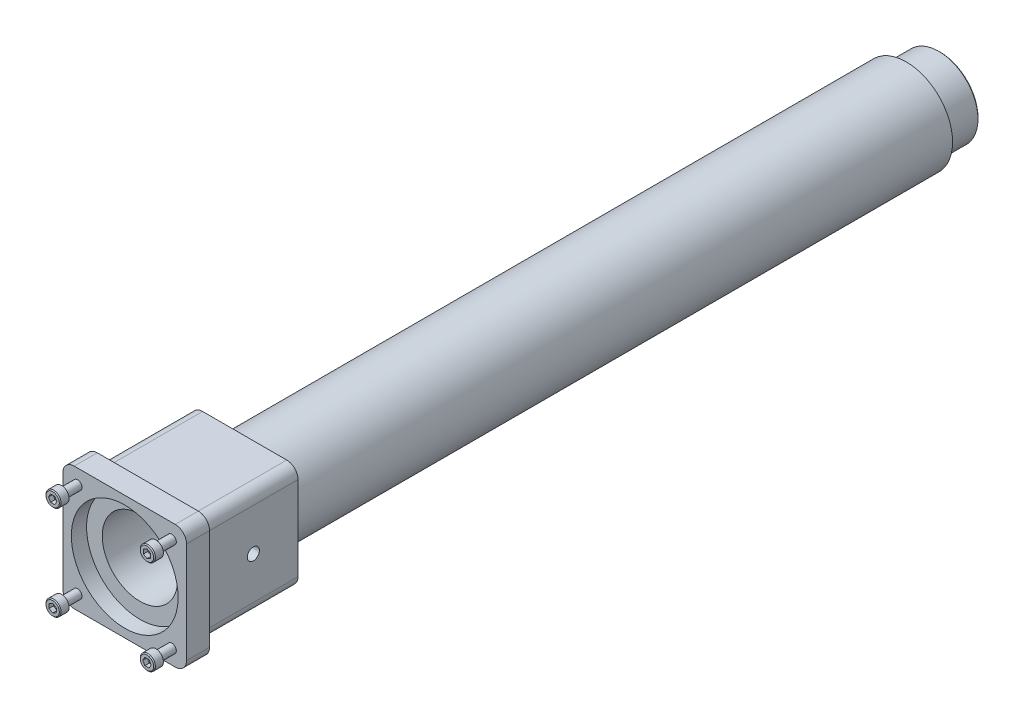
ISO-10303-21;
HEADER;
FILE_DESCRIPTION(('STEP AP214'),'2;1');
FILE_NAME('part.step','',(''),(''),'','','');
FILE_SCHEMA(('AUTOMOTIVE_DESIGN { 1 0 10303 214 1 1 1 1 }'));
ENDSEC;
DATA;
#1=APPLICATION_CONTEXT('core data for automotive mechanical design processes');
#2=APPLICATION_PROTOCOL_DEFINITION('international standard','automotive_design',2000,#1);
#3=PRODUCT_CONTEXT('',#1,'mechanical');
#4=PRODUCT('Part','Part','',(#3));
#5=PRODUCT_RELATED_PRODUCT_CATEGORY('part','',(#4));
#6=PRODUCT_DEFINITION_FORMATION('','',#4);
#7=PRODUCT_DEFINITION_CONTEXT('part definition',#1,'design');
#8=PRODUCT_DEFINITION('design','',#6,#7);
#9=PRODUCT_DEFINITION_SHAPE('','',#8);
#10=(LENGTH_UNIT() NAMED_UNIT(*) SI_UNIT(.MILLI.,.METRE.));
#11=(NAMED_UNIT(*) PLANE_ANGLE_UNIT() SI_UNIT($,.RADIAN.));
#12=(NAMED_UNIT(*) SI_UNIT($,.STERADIAN.) SOLID_ANGLE_UNIT());
#13=UNCERTAINTY_MEASURE_WITH_UNIT(LENGTH_MEASURE(1.E-05),#10,'distance_accuracy_value','');
#14=(GEOMETRIC_REPRESENTATION_CONTEXT(3) GLOBAL_UNCERTAINTY_ASSIGNED_CONTEXT((#13)) GLOBAL_UNIT_ASSIGNED_CONTEXT((#10,
#11,#12)) REPRESENTATION_CONTEXT('',''));
#15=CARTESIAN_POINT('',(0.,0.,0.));
#16=DIRECTION('',(0.,0.,1.));
#17=DIRECTION('',(1.,0.,0.));
#18=AXIS2_PLACEMENT_3D('',#15,#16,#17);
#19=CARTESIAN_POINT('',(-26.5169002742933,-26.5169002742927,81.44892));
#20=DIRECTION('',(0.,0.,1.));
#21=DIRECTION('',(1.,0.,0.));
#22=AXIS2_PLACEMENT_3D('',#19,#20,#21);
#23=PLANE('',#22);
#24=DIRECTION('',(0.866025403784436,-0.500000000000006,0.));
#25=VECTOR('',#24,1.);
#26=CARTESIAN_POINT('',(-26.5169002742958,-24.1590017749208,81.44892));
#27=LINE('',#26,#25);
#28=CARTESIAN_POINT('',(-26.5169002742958,-24.1590017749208,81.44892));
#29=VERTEX_POINT('',#28);
#30=CARTESIAN_POINT('',(-24.4749002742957,-25.337951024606,81.44892));
#31=VERTEX_POINT('',#30);
#32=EDGE_CURVE('P0_E235',#29,#31,#27,.T.);
#33=ORIENTED_EDGE('',*,*,#32,.T.);
#34=DIRECTION('',(0.,1.,0.));
#35=VECTOR('',#34,1.);
#36=CARTESIAN_POINT('',(-24.4749002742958,-27.6958495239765,81.44892));
#37=LINE('',#36,#35);
#38=CARTESIAN_POINT('',(-24.4749002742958,-27.6958495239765,81.44892));
#39=VERTEX_POINT('',#38);
#40=EDGE_CURVE('P0_E112',#39,#31,#37,.T.);
#41=ORIENTED_EDGE('',*,*,#40,.F.);
#42=DIRECTION('',(-0.866025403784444,-0.499999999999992,0.));
#43=VECTOR('',#42,1.);
#44=CARTESIAN_POINT('',(-24.4749002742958,-27.6958495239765,81.44892));
#45=LINE('',#44,#43);
#46=CARTESIAN_POINT('',(-26.5169002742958,-28.8747987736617,81.44892));
#47=VERTEX_POINT('',#46);
#48=EDGE_CURVE('P0_E239',#39,#47,#45,.T.);
#49=ORIENTED_EDGE('',*,*,#48,.T.);
#50=DIRECTION('',(-0.866025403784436,0.5,0.));
#51=VECTOR('',#50,1.);
#52=CARTESIAN_POINT('',(-26.5169002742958,-28.8747987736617,81.44892));
#53=LINE('',#52,#51);
#54=CARTESIAN_POINT('',(-28.5589002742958,-27.6958495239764,81.44892));
#55=VERTEX_POINT('',#54);
#56=EDGE_CURVE('P0_E242',#47,#55,#53,.T.);
#57=ORIENTED_EDGE('',*,*,#56,.T.);
#58=DIRECTION('',(0.,-1.,0.));
#59=VECTOR('',#58,1.);
#60=CARTESIAN_POINT('',(-28.5589002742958,-25.337951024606,81.44892));
#61=LINE('',#60,#59);
#62=CARTESIAN_POINT('',(-28.5589002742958,-25.337951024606,81.44892));
#63=VERTEX_POINT('',#62);
#64=EDGE_CURVE('P0_E245',#63,#55,#61,.T.);
#65=ORIENTED_EDGE('',*,*,#64,.F.);
#66=DIRECTION('',(-0.866025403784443,-0.499999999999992,0.));
#67=VECTOR('',#66,1.);
#68=CARTESIAN_POINT('',(-26.5169002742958,-24.1590017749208,81.44892));
#69=LINE('',#68,#67);
#70=EDGE_CURVE('P0_E107',#29,#63,#69,.T.);
#71=ORIENTED_EDGE('',*,*,#70,.F.);
#72=EDGE_LOOP('',(#33,#41,#49,#57,#65,#71));
#73=FACE_BOUND('',#72,.T.);
#74=CARTESIAN_POINT('',(-26.5169002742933,-26.5169002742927,81.44892));
#75=DIRECTION('',(0.,0.,1.));
#76=DIRECTION('',(1.,0.,0.));
#77=AXIS2_PLACEMENT_3D('',#74,#75,#76);
#78=CIRCLE('',#77,3.75);
#79=CARTESIAN_POINT('',(-22.7669002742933,-26.5169002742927,81.44892));
#80=VERTEX_POINT('',#79);
#81=EDGE_CURVE('P0_E123',#80,#80,#78,.T.);
#82=ORIENTED_EDGE('',*,*,#81,.T.);
#83=EDGE_LOOP('',(#82));
#84=FACE_BOUND('',#83,.T.);
#85=ADVANCED_FACE('P0_F16',(#73,#84),#23,.T.);
#86=CARTESIAN_POINT('',(-26.5169002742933,-26.5169002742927,110.19892));
#87=DIRECTION('',(0.,0.,1.));
#88=DIRECTION('',(1.,0.,0.));
#89=AXIS2_PLACEMENT_3D('',#86,#87,#88);
#90=CYLINDRICAL_SURFACE('',#89,2.5);
#91=CARTESIAN_POINT('',(-26.5169002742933,-26.5169002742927,76.44892));
#92=DIRECTION('',(0.,0.,1.));
#93=DIRECTION('',(1.,0.,0.));
#94=AXIS2_PLACEMENT_3D('',#91,#92,#93);
#95=CIRCLE('',#94,2.5);
#96=CARTESIAN_POINT('',(-24.0169002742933,-26.5169002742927,76.44892));
#97=VERTEX_POINT('',#96);
#98=EDGE_CURVE('P0_E10',#97,#97,#95,.T.);
#99=ORIENTED_EDGE('',*,*,#98,.F.);
#100=EDGE_LOOP('',(#99));
#101=FACE_BOUND('',#100,.T.);
#102=CARTESIAN_POINT('',(-26.5169002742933,-26.5169002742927,58.44794));
#103=DIRECTION('',(0.,0.,-1.));
#104=DIRECTION('',(-1.,0.,0.));
#105=AXIS2_PLACEMENT_3D('',#102,#103,#104);
#106=CIRCLE('',#105,2.5);
#107=CARTESIAN_POINT('',(-29.0169002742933,-26.5169002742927,58.44794));
#108=VERTEX_POINT('',#107);
#109=EDGE_CURVE('P0_E237',#108,#108,#106,.T.);
#110=ORIENTED_EDGE('',*,*,#109,.F.);
#111=EDGE_LOOP('',(#110));
#112=FACE_BOUND('',#111,.T.);
#113=ADVANCED_FACE('P0_F137',(#101,#112),#90,.T.);
#114=CARTESIAN_POINT('',(-26.5169002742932,-22.2669002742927,76.44892));
#115=DIRECTION('',(0.,0.,-1.));
#116=DIRECTION('',(-1.,0.,0.));
#117=AXIS2_PLACEMENT_3D('',#114,#115,#116);
#118=PLANE('',#117);
#119=ORIENTED_EDGE('',*,*,#98,.T.);
#120=EDGE_LOOP('',(#119));
#121=FACE_BOUND('',#120,.T.);
#122=CARTESIAN_POINT('',(-26.5169002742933,-26.5169002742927,76.44892));
#123=DIRECTION('',(0.,0.,1.));
#124=DIRECTION('',(1.,0.,0.));
#125=AXIS2_PLACEMENT_3D('',#122,#123,#124);
#126=CIRCLE('',#125,4.25);
#127=CARTESIAN_POINT('',(-22.2669002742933,-26.5169002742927,76.44892));
#128=VERTEX_POINT('',#127);
#129=EDGE_CURVE('P0_E24',#128,#128,#126,.T.);
#130=ORIENTED_EDGE('',*,*,#129,.F.);
#131=EDGE_LOOP('',(#130));
#132=FACE_BOUND('',#131,.T.);
#133=ADVANCED_FACE('P0_F135',(#121,#132),#118,.T.);
#134=CARTESIAN_POINT('',(-26.5169002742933,-26.5169002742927,110.19892));
#135=DIRECTION('',(0.,0.,1.));
#136=DIRECTION('',(1.,0.,0.));
#137=AXIS2_PLACEMENT_3D('',#134,#135,#136);
#138=CYLINDRICAL_SURFACE('',#137,4.25);
#139=ORIENTED_EDGE('',*,*,#129,.T.);
#140=EDGE_LOOP('',(#139));
#141=FACE_BOUND('',#140,.T.);
#142=CARTESIAN_POINT('',(-26.5169002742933,-26.5169002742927,80.94892));
#143=DIRECTION('',(0.,0.,1.));
#144=DIRECTION('',(1.,0.,0.));
#145=AXIS2_PLACEMENT_3D('',#142,#143,#144);
#146=CIRCLE('',#145,4.25);
#147=CARTESIAN_POINT('',(-22.2669002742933,-26.5169002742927,80.94892));
#148=VERTEX_POINT('',#147);
#149=EDGE_CURVE('P0_E127',#148,#148,#146,.T.);
#150=ORIENTED_EDGE('',*,*,#149,.F.);
#151=EDGE_LOOP('',(#150));
#152=FACE_BOUND('',#151,.T.);
#153=ADVANCED_FACE('P0_F132',(#141,#152),#138,.T.);
#154=CARTESIAN_POINT('',(-26.5169002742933,-26.5169002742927,81.44892));
#155=DIRECTION('',(0.,0.,-1.));
#156=DIRECTION('',(-1.,0.,0.));
#157=AXIS2_PLACEMENT_3D('',#154,#155,#156);
#158=CONICAL_SURFACE('',#157,3.75,0.785398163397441);
#159=ORIENTED_EDGE('',*,*,#149,.T.);
#160=EDGE_LOOP('',(#159));
#161=FACE_BOUND('',#160,.T.);
#162=ORIENTED_EDGE('',*,*,#81,.F.);
#163=EDGE_LOOP('',(#162));
#164=FACE_BOUND('',#163,.T.);
#165=ADVANCED_FACE('P0_F146',(#161,#164),#158,.T.);
#166=CARTESIAN_POINT('',(-26.5169002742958,-24.1590017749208,78.94892));
#167=DIRECTION('',(-0.500000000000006,-0.866025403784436,0.));
#168=DIRECTION('',(-0.866025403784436,0.500000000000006,0.));
#169=AXIS2_PLACEMENT_3D('',#166,#167,#168);
#170=PLANE('',#169);
#171=ORIENTED_EDGE('',*,*,#32,.F.);
#172=DIRECTION('',(0.,0.,1.));
#173=VECTOR('',#172,1.);
#174=CARTESIAN_POINT('',(-26.5169002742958,-24.1590017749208,78.94892));
#175=LINE('',#174,#173);
#176=CARTESIAN_POINT('',(-26.5169002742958,-24.1590017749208,78.94892));
#177=VERTEX_POINT('',#176);
#178=EDGE_CURVE('P0_E225',#177,#29,#175,.T.);
#179=ORIENTED_EDGE('',*,*,#178,.F.);
#180=DIRECTION('',(0.866025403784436,-0.500000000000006,0.));
#181=VECTOR('',#180,1.);
#182=CARTESIAN_POINT('',(-26.5169002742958,-24.1590017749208,78.94892));
#183=LINE('',#182,#181);
#184=CARTESIAN_POINT('',(-25.4959002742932,-24.7484763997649,78.94892));
#185=VERTEX_POINT('',#184);
#186=EDGE_CURVE('P0_E99',#177,#185,#183,.T.);
#187=ORIENTED_EDGE('',*,*,#186,.T.);
#188=CARTESIAN_POINT('',(-24.4749002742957,-25.337951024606,78.94892));
#189=VERTEX_POINT('',#188);
#190=EDGE_CURVE('P0_E90',#185,#189,#183,.T.);
#191=ORIENTED_EDGE('',*,*,#190,.T.);
#192=DIRECTION('',(0.,0.,1.));
#193=VECTOR('',#192,1.);
#194=CARTESIAN_POINT('',(-24.4749002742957,-25.337951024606,78.94892));
#195=LINE('',#194,#193);
#196=EDGE_CURVE('P0_E104',#189,#31,#195,.T.);
#197=ORIENTED_EDGE('',*,*,#196,.T.);
#198=EDGE_LOOP('',(#171,#179,#187,#191,#197));
#199=FACE_BOUND('',#198,.T.);
#200=ADVANCED_FACE('P0_F103',(#199),#170,.T.);
#201=CARTESIAN_POINT('',(-24.4749002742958,-27.6958495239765,78.94892));
#202=DIRECTION('',(1.,0.,0.));
#203=DIRECTION('',(0.,-1.,0.));
#204=AXIS2_PLACEMENT_3D('',#201,#202,#203);
#205=PLANE('',#204);
#206=ORIENTED_EDGE('',*,*,#40,.T.);
#207=ORIENTED_EDGE('',*,*,#196,.F.);
#208=DIRECTION('',(0.,1.,0.));
#209=VECTOR('',#208,1.);
#210=CARTESIAN_POINT('',(-24.4749002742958,-27.6958495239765,78.94892));
#211=LINE('',#210,#209);
#212=CARTESIAN_POINT('',(-24.4749002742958,-26.5169002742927,78.94892));
#213=VERTEX_POINT('',#212);
#214=EDGE_CURVE('P0_E87',#213,#189,#211,.T.);
#215=ORIENTED_EDGE('',*,*,#214,.F.);
#216=CARTESIAN_POINT('',(-24.4749002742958,-27.6958495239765,78.94892));
#217=VERTEX_POINT('',#216);
#218=EDGE_CURVE('P0_E98',#217,#213,#211,.T.);
#219=ORIENTED_EDGE('',*,*,#218,.F.);
#220=DIRECTION('',(0.,0.,1.));
#221=VECTOR('',#220,1.);
#222=CARTESIAN_POINT('',(-24.4749002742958,-27.6958495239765,78.94892));
#223=LINE('',#222,#221);
#224=EDGE_CURVE('P0_E114',#217,#39,#223,.T.);
#225=ORIENTED_EDGE('',*,*,#224,.T.);
#226=EDGE_LOOP('',(#206,#207,#215,#219,#225));
#227=FACE_BOUND('',#226,.T.);
#228=ADVANCED_FACE('P0_F109',(#227),#205,.F.);
#229=CARTESIAN_POINT('',(-24.4749002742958,-27.6958495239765,78.94892));
#230=DIRECTION('',(-0.499999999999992,0.866025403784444,0.));
#231=DIRECTION('',(0.866025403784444,0.499999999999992,0.));
#232=AXIS2_PLACEMENT_3D('',#229,#230,#231);
#233=PLANE('',#232);
#234=ORIENTED_EDGE('',*,*,#48,.F.);
#235=ORIENTED_EDGE('',*,*,#224,.F.);
#236=DIRECTION('',(-0.866025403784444,-0.499999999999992,0.));
#237=VECTOR('',#236,1.);
#238=CARTESIAN_POINT('',(-24.4749002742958,-27.6958495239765,78.94892));
#239=LINE('',#238,#237);
#240=CARTESIAN_POINT('',(-25.4959002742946,-28.2853241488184,78.94892));
#241=VERTEX_POINT('',#240);
#242=EDGE_CURVE('P0_E265',#217,#241,#239,.T.);
#243=ORIENTED_EDGE('',*,*,#242,.T.);
#244=CARTESIAN_POINT('',(-26.5169002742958,-28.8747987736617,78.94892));
#245=VERTEX_POINT('',#244);
#246=EDGE_CURVE('P0_E254',#241,#245,#239,.T.);
#247=ORIENTED_EDGE('',*,*,#246,.T.);
#248=DIRECTION('',(0.,0.,1.));
#249=VECTOR('',#248,1.);
#250=CARTESIAN_POINT('',(-26.5169002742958,-28.8747987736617,78.94892));
#251=LINE('',#250,#249);
#252=EDGE_CURVE('P0_E119',#245,#47,#251,.T.);
#253=ORIENTED_EDGE('',*,*,#252,.T.);
#254=EDGE_LOOP('',(#234,#235,#243,#247,#253));
#255=FACE_BOUND('',#254,.T.);
#256=ADVANCED_FACE('P0_F173',(#255),#233,.T.);
#257=CARTESIAN_POINT('',(-26.5169002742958,-28.8747987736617,78.94892));
#258=DIRECTION('',(0.5,0.866025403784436,0.));
#259=DIRECTION('',(0.866025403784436,-0.5,0.));
#260=AXIS2_PLACEMENT_3D('',#257,#258,#259);
#261=PLANE('',#260);
#262=ORIENTED_EDGE('',*,*,#56,.F.);
#263=ORIENTED_EDGE('',*,*,#252,.F.);
#264=DIRECTION('',(-0.866025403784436,0.5,0.));
#265=VECTOR('',#264,1.);
#266=CARTESIAN_POINT('',(-26.5169002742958,-28.8747987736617,78.94892));
#267=LINE('',#266,#265);
#268=CARTESIAN_POINT('',(-27.5379002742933,-28.2853241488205,78.94892));
#269=VERTEX_POINT('',#268);
#270=EDGE_CURVE('P0_E231',#245,#269,#267,.T.);
#271=ORIENTED_EDGE('',*,*,#270,.T.);
#272=CARTESIAN_POINT('',(-28.5589002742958,-27.6958495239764,78.94892));
#273=VERTEX_POINT('',#272);
#274=EDGE_CURVE('P0_E264',#269,#273,#267,.T.);
#275=ORIENTED_EDGE('',*,*,#274,.T.);
#276=DIRECTION('',(0.,0.,1.));
#277=VECTOR('',#276,1.);
#278=CARTESIAN_POINT('',(-28.5589002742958,-27.6958495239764,78.94892));
#279=LINE('',#278,#277);
#280=EDGE_CURVE('P0_E224',#273,#55,#279,.T.);
#281=ORIENTED_EDGE('',*,*,#280,.T.);
#282=EDGE_LOOP('',(#262,#263,#271,#275,#281));
#283=FACE_BOUND('',#282,.T.);
#284=ADVANCED_FACE('P0_F178',(#283),#261,.T.);
#285=CARTESIAN_POINT('',(-28.5589002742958,-25.337951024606,78.94892));
#286=DIRECTION('',(-1.,0.,0.));
#287=DIRECTION('',(0.,1.,0.));
#288=AXIS2_PLACEMENT_3D('',#285,#286,#287);
#289=PLANE('',#288);
#290=ORIENTED_EDGE('',*,*,#64,.T.);
#291=ORIENTED_EDGE('',*,*,#280,.F.);
#292=DIRECTION('',(0.,-1.,0.));
#293=VECTOR('',#292,1.);
#294=CARTESIAN_POINT('',(-28.5589002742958,-25.337951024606,78.94892));
#295=LINE('',#294,#293);
#296=CARTESIAN_POINT('',(-28.5589002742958,-26.5169002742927,78.9489200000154));
#297=VERTEX_POINT('',#296);
#298=EDGE_CURVE('P0_E228',#297,#273,#295,.T.);
#299=ORIENTED_EDGE('',*,*,#298,.F.);
#300=CARTESIAN_POINT('',(-28.5589002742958,-25.337951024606,78.94892));
#301=VERTEX_POINT('',#300);
#302=EDGE_CURVE('P0_E31',#301,#297,#295,.T.);
#303=ORIENTED_EDGE('',*,*,#302,.F.);
#304=DIRECTION('',(0.,0.,1.));
#305=VECTOR('',#304,1.);
#306=CARTESIAN_POINT('',(-28.5589002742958,-25.337951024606,78.94892));
#307=LINE('',#306,#305);
#308=EDGE_CURVE('P0_E221',#301,#63,#307,.T.);
#309=ORIENTED_EDGE('',*,*,#308,.T.);
#310=EDGE_LOOP('',(#290,#291,#299,#303,#309));
#311=FACE_BOUND('',#310,.T.);
#312=ADVANCED_FACE('P0_F182',(#311),#289,.F.);
#313=CARTESIAN_POINT('',(-26.5169002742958,-24.1590017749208,78.94892));
#314=DIRECTION('',(-0.499999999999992,0.866025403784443,0.));
#315=DIRECTION('',(0.866025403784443,0.499999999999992,0.));
#316=AXIS2_PLACEMENT_3D('',#313,#314,#315);
#317=PLANE('',#316);
#318=ORIENTED_EDGE('',*,*,#70,.T.);
#319=ORIENTED_EDGE('',*,*,#308,.F.);
#320=DIRECTION('',(-0.866025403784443,-0.499999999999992,0.));
#321=VECTOR('',#320,1.);
#322=CARTESIAN_POINT('',(-26.5169002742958,-24.1590017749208,78.94892));
#323=LINE('',#322,#321);
#324=CARTESIAN_POINT('',(-27.5379002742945,-24.7484763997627,78.94892));
#325=VERTEX_POINT('',#324);
#326=EDGE_CURVE('P0_E211',#325,#301,#323,.T.);
#327=ORIENTED_EDGE('',*,*,#326,.F.);
#328=EDGE_CURVE('P0_E217',#177,#325,#323,.T.);
#329=ORIENTED_EDGE('',*,*,#328,.F.);
#330=ORIENTED_EDGE('',*,*,#178,.T.);
#331=EDGE_LOOP('',(#318,#319,#327,#329,#330));
#332=FACE_BOUND('',#331,.T.);
#333=ADVANCED_FACE('P0_F186',(#332),#317,.F.);
#334=CARTESIAN_POINT('',(-28.5589002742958,-22.9800525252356,78.94892));
#335=DIRECTION('',(0.,0.,-1.));
#336=DIRECTION('',(-1.,0.,0.));
#337=AXIS2_PLACEMENT_3D('',#334,#335,#336);
#338=PLANE('',#337);
#339=ORIENTED_EDGE('',*,*,#298,.T.);
#340=ORIENTED_EDGE('',*,*,#274,.F.);
#341=CARTESIAN_POINT('',(-26.5169002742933,-26.5169002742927,78.9489200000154));
#342=DIRECTION('',(0.,0.,1.));
#343=DIRECTION('',(1.,0.,0.));
#344=AXIS2_PLACEMENT_3D('',#341,#342,#343);
#345=CIRCLE('',#344,2.0420000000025);
#346=EDGE_CURVE('P0_E260',#297,#269,#345,.T.);
#347=ORIENTED_EDGE('',*,*,#346,.F.);
#348=EDGE_LOOP('',(#339,#340,#347));
#349=FACE_BOUND('',#348,.T.);
#350=ADVANCED_FACE('P0_F190',(#349),#338,.F.);
#351=ORIENTED_EDGE('',*,*,#270,.F.);
#352=ORIENTED_EDGE('',*,*,#246,.F.);
#353=EDGE_CURVE('P0_E117',#269,#241,#345,.T.);
#354=ORIENTED_EDGE('',*,*,#353,.F.);
#355=EDGE_LOOP('',(#351,#352,#354));
#356=FACE_BOUND('',#355,.T.);
#357=ADVANCED_FACE('P0_F193',(#356),#338,.F.);
#358=ORIENTED_EDGE('',*,*,#242,.F.);
#359=ORIENTED_EDGE('',*,*,#218,.T.);
#360=EDGE_CURVE('P0_E113',#241,#213,#345,.T.);
#361=ORIENTED_EDGE('',*,*,#360,.F.);
#362=EDGE_LOOP('',(#358,#359,#361));
#363=FACE_BOUND('',#362,.T.);
#364=ADVANCED_FACE('P0_F200',(#363),#338,.F.);
#365=ORIENTED_EDGE('',*,*,#214,.T.);
#366=ORIENTED_EDGE('',*,*,#190,.F.);
#367=EDGE_CURVE('P0_E93',#213,#185,#345,.T.);
#368=ORIENTED_EDGE('',*,*,#367,.F.);
#369=EDGE_LOOP('',(#365,#366,#368));
#370=FACE_BOUND('',#369,.T.);
#371=ADVANCED_FACE('P0_F89',(#370),#338,.F.);
#372=ORIENTED_EDGE('',*,*,#186,.F.);
#373=ORIENTED_EDGE('',*,*,#328,.T.);
#374=EDGE_CURVE('P0_E124',#185,#325,#345,.T.);
#375=ORIENTED_EDGE('',*,*,#374,.F.);
#376=EDGE_LOOP('',(#372,#373,#375));
#377=FACE_BOUND('',#376,.T.);
#378=ADVANCED_FACE('P0_F203',(#377),#338,.F.);
#379=ORIENTED_EDGE('',*,*,#326,.T.);
#380=ORIENTED_EDGE('',*,*,#302,.T.);
#381=EDGE_CURVE('P0_E214',#325,#297,#345,.T.);
#382=ORIENTED_EDGE('',*,*,#381,.F.);
#383=EDGE_LOOP('',(#379,#380,#382));
#384=FACE_BOUND('',#383,.T.);
#385=ADVANCED_FACE('P0_F195',(#384),#338,.F.);
#386=CARTESIAN_POINT('',(-26.5169002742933,-26.5169002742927,78.9489200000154));
#387=DIRECTION('',(0.,0.,1.));
#388=DIRECTION('',(1.,0.,0.));
#389=AXIS2_PLACEMENT_3D('',#386,#387,#388);
#390=CONICAL_SURFACE('',#389,2.0420000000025,1.0471975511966);
#391=CARTESIAN_POINT('',(-26.5169002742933,-26.5169002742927,77.7699707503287));
#392=VERTEX_POINT('',#391);
#393=VERTEX_LOOP('',#392);
#394=FACE_BOUND('',#393,.T.);
#395=ORIENTED_EDGE('',*,*,#367,.T.);
#396=ORIENTED_EDGE('',*,*,#374,.T.);
#397=ORIENTED_EDGE('',*,*,#381,.T.);
#398=ORIENTED_EDGE('',*,*,#346,.T.);
#399=ORIENTED_EDGE('',*,*,#353,.T.);
#400=ORIENTED_EDGE('',*,*,#360,.T.);
#401=EDGE_LOOP('',(#395,#396,#397,#398,#399,#400));
#402=FACE_BOUND('',#401,.T.);
#403=ADVANCED_FACE('P0_F158',(#394,#402),#390,.F.);
#404=CARTESIAN_POINT('',(-26.5169002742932,-24.4619002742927,58.44794));
#405=DIRECTION('',(0.,0.,-1.));
#406=DIRECTION('',(-1.,0.,0.));
#407=AXIS2_PLACEMENT_3D('',#404,#405,#406);
#408=PLANE('',#407);
#409=ORIENTED_EDGE('',*,*,#109,.T.);
#410=EDGE_LOOP('',(#409));
#411=FACE_BOUND('',#410,.T.);
#412=ADVANCED_FACE('P0_F18',(#411),#408,.T.);
#413=CLOSED_SHELL('',(#85,#113,#133,#153,#165,#200,#228,#256,#284,#312,#333,#350,#357,#364,#371,
#378,#385,#403,#412));
#414=MANIFOLD_SOLID_BREP('P0_B1',#413);
#415=CARTESIAN_POINT('',(26.5169002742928,-26.5169002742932,81.44892));
#416=DIRECTION('',(0.,0.,1.));
#417=DIRECTION('',(0.,1.,0.));
#418=AXIS2_PLACEMENT_3D('',#415,#416,#417);
#419=PLANE('',#418);
#420=DIRECTION('',(0.5,0.866025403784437,0.));
#421=VECTOR('',#420,1.);
#422=CARTESIAN_POINT('',(24.1590017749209,-26.5169002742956,81.44892));
#423=LINE('',#422,#421);
#424=CARTESIAN_POINT('',(24.1590017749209,-26.5169002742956,81.44892));
#425=VERTEX_POINT('',#424);
#426=CARTESIAN_POINT('',(25.3379510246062,-24.4749002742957,81.44892));
#427=VERTEX_POINT('',#426);
#428=EDGE_CURVE('P1_E26',#425,#427,#423,.T.);
#429=ORIENTED_EDGE('',*,*,#428,.T.);
#430=DIRECTION('',(-1.,0.,0.));
#431=VECTOR('',#430,1.);
#432=CARTESIAN_POINT('',(27.6958495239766,-24.4749002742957,81.44892));
#433=LINE('',#432,#431);
#434=CARTESIAN_POINT('',(27.6958495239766,-24.4749002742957,81.44892));
#435=VERTEX_POINT('',#434);
#436=EDGE_CURVE('P1_E34',#435,#427,#433,.T.);
#437=ORIENTED_EDGE('',*,*,#436,.F.);
#438=DIRECTION('',(0.5,-0.866025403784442,0.));
#439=VECTOR('',#438,1.);
#440=CARTESIAN_POINT('',(27.6958495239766,-24.4749002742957,81.44892));
#441=LINE('',#440,#439);
#442=CARTESIAN_POINT('',(28.8747987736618,-26.5169002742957,81.44892));
#443=VERTEX_POINT('',#442);
#444=EDGE_CURVE('P1_E96',#435,#443,#441,.T.);
#445=ORIENTED_EDGE('',*,*,#444,.T.);
#446=DIRECTION('',(-0.5,-0.866025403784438,0.));
#447=VECTOR('',#446,1.);
#448=CARTESIAN_POINT('',(28.8747987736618,-26.5169002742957,81.44892));
#449=LINE('',#448,#447);
#450=CARTESIAN_POINT('',(27.6958495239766,-28.5589002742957,81.44892));
#451=VERTEX_POINT('',#450);
#452=EDGE_CURVE('P1_E85',#443,#451,#449,.T.);
#453=ORIENTED_EDGE('',*,*,#452,.T.);
#454=DIRECTION('',(1.,0.,0.));
#455=VECTOR('',#454,1.);
#456=CARTESIAN_POINT('',(25.3379510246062,-28.5589002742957,81.44892));
#457=LINE('',#456,#455);
#458=CARTESIAN_POINT('',(25.3379510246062,-28.5589002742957,81.44892));
#459=VERTEX_POINT('',#458);
#460=EDGE_CURVE('P1_E97',#459,#451,#457,.T.);
#461=ORIENTED_EDGE('',*,*,#460,.F.);
#462=DIRECTION('',(0.5,-0.866025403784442,0.));
#463=VECTOR('',#462,1.);
#464=CARTESIAN_POINT('',(24.1590017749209,-26.5169002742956,81.44892));
#465=LINE('',#464,#463);
#466=EDGE_CURVE('P1_E130',#425,#459,#465,.T.);
#467=ORIENTED_EDGE('',*,*,#466,.F.);
#468=EDGE_LOOP('',(#429,#437,#445,#453,#461,#467));
#469=FACE_BOUND('',#468,.T.);
#470=CARTESIAN_POINT('',(26.5169002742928,-26.5169002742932,81.44892));
#471=DIRECTION('',(0.,0.,1.));
#472=DIRECTION('',(0.,1.,0.));
#473=AXIS2_PLACEMENT_3D('',#470,#471,#472);
#474=CIRCLE('',#473,3.75);
#475=CARTESIAN_POINT('',(26.5169002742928,-22.7669002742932,81.44892));
#476=VERTEX_POINT('',#475);
#477=EDGE_CURVE('P1_E149',#476,#476,#474,.T.);
#478=ORIENTED_EDGE('',*,*,#477,.T.);
#479=EDGE_LOOP('',(#478));
#480=FACE_BOUND('',#479,.T.);
#481=ADVANCED_FACE('P1_F17',(#469,#480),#419,.T.);
#482=CARTESIAN_POINT('',(26.5169002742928,-26.5169002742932,110.19892));
#483=DIRECTION('',(0.,0.,1.));
#484=DIRECTION('',(0.,1.,0.));
#485=AXIS2_PLACEMENT_3D('',#482,#483,#484);
#486=CYLINDRICAL_SURFACE('',#485,2.5);
#487=CARTESIAN_POINT('',(26.5169002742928,-26.5169002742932,76.44892));
#488=DIRECTION('',(0.,0.,1.));
#489=DIRECTION('',(0.,1.,0.));
#490=AXIS2_PLACEMENT_3D('',#487,#488,#489);
#491=CIRCLE('',#490,2.5);
#492=CARTESIAN_POINT('',(26.5169002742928,-24.0169002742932,76.44892));
#493=VERTEX_POINT('',#492);
#494=EDGE_CURVE('P1_E158',#493,#493,#491,.T.);
#495=ORIENTED_EDGE('',*,*,#494,.F.);
#496=EDGE_LOOP('',(#495));
#497=FACE_BOUND('',#496,.T.);
#498=CARTESIAN_POINT('',(26.5169002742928,-26.5169002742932,58.44794));
#499=DIRECTION('',(0.,0.,-1.));
#500=DIRECTION('',(0.,-1.,0.));
#501=AXIS2_PLACEMENT_3D('',#498,#499,#500);
#502=CIRCLE('',#501,2.5);
#503=CARTESIAN_POINT('',(26.5169002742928,-29.0169002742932,58.44794));
#504=VERTEX_POINT('',#503);
#505=EDGE_CURVE('P1_E11',#504,#504,#502,.T.);
#506=ORIENTED_EDGE('',*,*,#505,.F.);
#507=EDGE_LOOP('',(#506));
#508=FACE_BOUND('',#507,.T.);
#509=ADVANCED_FACE('P1_F165',(#497,#508),#486,.T.);
#510=CARTESIAN_POINT('',(22.2669002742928,-26.5169002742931,76.44892));
#511=DIRECTION('',(0.,0.,-1.));
#512=DIRECTION('',(0.,-1.,0.));
#513=AXIS2_PLACEMENT_3D('',#510,#511,#512);
#514=PLANE('',#513);
#515=ORIENTED_EDGE('',*,*,#494,.T.);
#516=EDGE_LOOP('',(#515));
#517=FACE_BOUND('',#516,.T.);
#518=CARTESIAN_POINT('',(26.5169002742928,-26.5169002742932,76.44892));
#519=DIRECTION('',(0.,0.,1.));
#520=DIRECTION('',(0.,1.,0.));
#521=AXIS2_PLACEMENT_3D('',#518,#519,#520);
#522=CIRCLE('',#521,4.25);
#523=CARTESIAN_POINT('',(26.5169002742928,-22.2669002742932,76.44892));
#524=VERTEX_POINT('',#523);
#525=EDGE_CURVE('P1_E155',#524,#524,#522,.T.);
#526=ORIENTED_EDGE('',*,*,#525,.F.);
#527=EDGE_LOOP('',(#526));
#528=FACE_BOUND('',#527,.T.);
#529=ADVANCED_FACE('P1_F162',(#517,#528),#514,.T.);
#530=CARTESIAN_POINT('',(26.5169002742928,-26.5169002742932,110.19892));
#531=DIRECTION('',(0.,0.,1.));
#532=DIRECTION('',(0.,1.,0.));
#533=AXIS2_PLACEMENT_3D('',#530,#531,#532);
#534=CYLINDRICAL_SURFACE('',#533,4.25);
#535=ORIENTED_EDGE('',*,*,#525,.T.);
#536=EDGE_LOOP('',(#535));
#537=FACE_BOUND('',#536,.T.);
#538=CARTESIAN_POINT('',(26.5169002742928,-26.5169002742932,80.94892));
#539=DIRECTION('',(0.,0.,1.));
#540=DIRECTION('',(0.,1.,0.));
#541=AXIS2_PLACEMENT_3D('',#538,#539,#540);
#542=CIRCLE('',#541,4.25);
#543=CARTESIAN_POINT('',(26.5169002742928,-22.2669002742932,80.94892));
#544=VERTEX_POINT('',#543);
#545=EDGE_CURVE('P1_E152',#544,#544,#542,.T.);
#546=ORIENTED_EDGE('',*,*,#545,.F.);
#547=EDGE_LOOP('',(#546));
#548=FACE_BOUND('',#547,.T.);
#549=ADVANCED_FACE('P1_F386',(#537,#548),#534,.T.);
#550=CARTESIAN_POINT('',(26.5169002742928,-26.5169002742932,81.44892));
#551=DIRECTION('',(0.,0.,-1.));
#552=DIRECTION('',(0.,-1.,0.));
#553=AXIS2_PLACEMENT_3D('',#550,#551,#552);
#554=CONICAL_SURFACE('',#553,3.75,0.785398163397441);
#555=ORIENTED_EDGE('',*,*,#545,.T.);
#556=EDGE_LOOP('',(#555));
#557=FACE_BOUND('',#556,.T.);
#558=ORIENTED_EDGE('',*,*,#477,.F.);
#559=EDGE_LOOP('',(#558));
#560=FACE_BOUND('',#559,.T.);
#561=ADVANCED_FACE('P1_F189',(#557,#560),#554,.T.);
#562=CARTESIAN_POINT('',(24.1590017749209,-26.5169002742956,78.94892));
#563=DIRECTION('',(0.866025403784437,-0.5,0.));
#564=DIRECTION('',(-0.5,-0.866025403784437,0.));
#565=AXIS2_PLACEMENT_3D('',#562,#563,#564);
#566=PLANE('',#565);
#567=ORIENTED_EDGE('',*,*,#428,.F.);
#568=DIRECTION('',(0.,0.,1.));
#569=VECTOR('',#568,1.);
#570=CARTESIAN_POINT('',(24.1590017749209,-26.5169002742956,78.94892));
#571=LINE('',#570,#569);
#572=CARTESIAN_POINT('',(24.1590017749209,-26.5169002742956,78.94892));
#573=VERTEX_POINT('',#572);
#574=EDGE_CURVE('P1_E113',#573,#425,#571,.T.);
#575=ORIENTED_EDGE('',*,*,#574,.F.);
#576=DIRECTION('',(0.5,0.866025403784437,0.));
#577=VECTOR('',#576,1.);
#578=CARTESIAN_POINT('',(24.1590017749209,-26.5169002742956,78.94892));
#579=LINE('',#578,#577);
#580=CARTESIAN_POINT('',(24.748476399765,-25.4959002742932,78.94892));
#581=VERTEX_POINT('',#580);
#582=EDGE_CURVE('P1_E125',#573,#581,#579,.T.);
#583=ORIENTED_EDGE('',*,*,#582,.T.);
#584=CARTESIAN_POINT('',(25.3379510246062,-24.4749002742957,78.94892));
#585=VERTEX_POINT('',#584);
#586=EDGE_CURVE('P1_E127',#581,#585,#579,.T.);
#587=ORIENTED_EDGE('',*,*,#586,.T.);
#588=DIRECTION('',(0.,0.,1.));
#589=VECTOR('',#588,1.);
#590=CARTESIAN_POINT('',(25.3379510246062,-24.4749002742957,78.94892));
#591=LINE('',#590,#589);
#592=EDGE_CURVE('P1_E143',#585,#427,#591,.T.);
#593=ORIENTED_EDGE('',*,*,#592,.T.);
#594=EDGE_LOOP('',(#567,#575,#583,#587,#593));
#595=FACE_BOUND('',#594,.T.);
#596=ADVANCED_FACE('P1_F192',(#595),#566,.T.);
#597=CARTESIAN_POINT('',(27.6958495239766,-24.4749002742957,78.94892));
#598=DIRECTION('',(0.,1.,0.));
#599=DIRECTION('',(1.,0.,0.));
#600=AXIS2_PLACEMENT_3D('',#597,#598,#599);
#601=PLANE('',#600);
#602=ORIENTED_EDGE('',*,*,#436,.T.);
#603=ORIENTED_EDGE('',*,*,#592,.F.);
#604=DIRECTION('',(-1.,0.,0.));
#605=VECTOR('',#604,1.);
#606=CARTESIAN_POINT('',(27.6958495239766,-24.4749002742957,78.94892));
#607=LINE('',#606,#605);
#608=CARTESIAN_POINT('',(26.5169002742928,-24.4749002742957,78.94892));
#609=VERTEX_POINT('',#608);
#610=EDGE_CURVE('P1_E65',#609,#585,#607,.T.);
#611=ORIENTED_EDGE('',*,*,#610,.F.);
#612=CARTESIAN_POINT('',(27.6958495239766,-24.4749002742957,78.94892));
#613=VERTEX_POINT('',#612);
#614=EDGE_CURVE('P1_E123',#613,#609,#607,.T.);
#615=ORIENTED_EDGE('',*,*,#614,.F.);
#616=DIRECTION('',(0.,0.,1.));
#617=VECTOR('',#616,1.);
#618=CARTESIAN_POINT('',(27.6958495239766,-24.4749002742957,78.94892));
#619=LINE('',#618,#617);
#620=EDGE_CURVE('P1_E57',#613,#435,#619,.T.);
#621=ORIENTED_EDGE('',*,*,#620,.T.);
#622=EDGE_LOOP('',(#602,#603,#611,#615,#621));
#623=FACE_BOUND('',#622,.T.);
#624=ADVANCED_FACE('P1_F195',(#623),#601,.F.);
#625=CARTESIAN_POINT('',(27.6958495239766,-24.4749002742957,78.94892));
#626=DIRECTION('',(-0.866025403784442,-0.5,0.));
#627=DIRECTION('',(-0.5,0.866025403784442,0.));
#628=AXIS2_PLACEMENT_3D('',#625,#626,#627);
#629=PLANE('',#628);
#630=ORIENTED_EDGE('',*,*,#444,.F.);
#631=ORIENTED_EDGE('',*,*,#620,.F.);
#632=DIRECTION('',(0.5,-0.866025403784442,0.));
#633=VECTOR('',#632,1.);
#634=CARTESIAN_POINT('',(27.6958495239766,-24.4749002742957,78.94892));
#635=LINE('',#634,#633);
#636=CARTESIAN_POINT('',(28.2853241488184,-25.4959002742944,78.94892));
#637=VERTEX_POINT('',#636);
#638=EDGE_CURVE('P1_E121',#613,#637,#635,.T.);
#639=ORIENTED_EDGE('',*,*,#638,.T.);
#640=CARTESIAN_POINT('',(28.8747987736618,-26.5169002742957,78.94892));
#641=VERTEX_POINT('',#640);
#642=EDGE_CURVE('P1_E101',#637,#641,#635,.T.);
#643=ORIENTED_EDGE('',*,*,#642,.T.);
#644=DIRECTION('',(0.,0.,1.));
#645=VECTOR('',#644,1.);
#646=CARTESIAN_POINT('',(28.8747987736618,-26.5169002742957,78.94892));
#647=LINE('',#646,#645);
#648=EDGE_CURVE('P1_E89',#641,#443,#647,.T.);
#649=ORIENTED_EDGE('',*,*,#648,.T.);
#650=EDGE_LOOP('',(#630,#631,#639,#643,#649));
#651=FACE_BOUND('',#650,.T.);
#652=ADVANCED_FACE('P1_F99',(#651),#629,.T.);
#653=CARTESIAN_POINT('',(28.8747987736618,-26.5169002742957,78.94892));
#654=DIRECTION('',(-0.866025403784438,0.5,0.));
#655=DIRECTION('',(0.5,0.866025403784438,0.));
#656=AXIS2_PLACEMENT_3D('',#653,#654,#655);
#657=PLANE('',#656);
#658=ORIENTED_EDGE('',*,*,#452,.F.);
#659=ORIENTED_EDGE('',*,*,#648,.F.);
#660=DIRECTION('',(-0.5,-0.866025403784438,0.));
#661=VECTOR('',#660,1.);
#662=CARTESIAN_POINT('',(28.8747987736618,-26.5169002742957,78.94892));
#663=LINE('',#662,#661);
#664=CARTESIAN_POINT('',(28.2853241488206,-27.5379002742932,78.94892));
#665=VERTEX_POINT('',#664);
#666=EDGE_CURVE('P1_E118',#641,#665,#663,.T.);
#667=ORIENTED_EDGE('',*,*,#666,.T.);
#668=CARTESIAN_POINT('',(27.6958495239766,-28.5589002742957,78.94892));
#669=VERTEX_POINT('',#668);
#670=EDGE_CURVE('P1_E120',#665,#669,#663,.T.);
#671=ORIENTED_EDGE('',*,*,#670,.T.);
#672=DIRECTION('',(0.,0.,1.));
#673=VECTOR('',#672,1.);
#674=CARTESIAN_POINT('',(27.6958495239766,-28.5589002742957,78.94892));
#675=LINE('',#674,#673);
#676=EDGE_CURVE('P1_E93',#669,#451,#675,.T.);
#677=ORIENTED_EDGE('',*,*,#676,.T.);
#678=EDGE_LOOP('',(#658,#659,#667,#671,#677));
#679=FACE_BOUND('',#678,.T.);
#680=ADVANCED_FACE('P1_F87',(#679),#657,.T.);
#681=CARTESIAN_POINT('',(25.3379510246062,-28.5589002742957,78.94892));
#682=DIRECTION('',(0.,-1.,0.));
#683=DIRECTION('',(-1.,0.,0.));
#684=AXIS2_PLACEMENT_3D('',#681,#682,#683);
#685=PLANE('',#684);
#686=ORIENTED_EDGE('',*,*,#460,.T.);
#687=ORIENTED_EDGE('',*,*,#676,.F.);
#688=DIRECTION('',(1.,0.,0.));
#689=VECTOR('',#688,1.);
#690=CARTESIAN_POINT('',(25.3379510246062,-28.5589002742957,78.94892));
#691=LINE('',#690,#689);
#692=CARTESIAN_POINT('',(26.5169002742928,-28.5589002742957,78.9489200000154));
#693=VERTEX_POINT('',#692);
#694=EDGE_CURVE('P1_E117',#693,#669,#691,.T.);
#695=ORIENTED_EDGE('',*,*,#694,.F.);
#696=CARTESIAN_POINT('',(25.3379510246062,-28.5589002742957,78.94892));
#697=VERTEX_POINT('',#696);
#698=EDGE_CURVE('P1_E114',#697,#693,#691,.T.);
#699=ORIENTED_EDGE('',*,*,#698,.F.);
#700=DIRECTION('',(0.,0.,1.));
#701=VECTOR('',#700,1.);
#702=CARTESIAN_POINT('',(25.3379510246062,-28.5589002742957,78.94892));
#703=LINE('',#702,#701);
#704=EDGE_CURVE('P1_E139',#697,#459,#703,.T.);
#705=ORIENTED_EDGE('',*,*,#704,.T.);
#706=EDGE_LOOP('',(#686,#687,#695,#699,#705));
#707=FACE_BOUND('',#706,.T.);
#708=ADVANCED_FACE('P1_F202',(#707),#685,.F.);
#709=CARTESIAN_POINT('',(24.1590017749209,-26.5169002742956,78.94892));
#710=DIRECTION('',(-0.866025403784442,-0.5,0.));
#711=DIRECTION('',(-0.5,0.866025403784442,0.));
#712=AXIS2_PLACEMENT_3D('',#709,#710,#711);
#713=PLANE('',#712);
#714=ORIENTED_EDGE('',*,*,#466,.T.);
#715=ORIENTED_EDGE('',*,*,#704,.F.);
#716=DIRECTION('',(0.5,-0.866025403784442,0.));
#717=VECTOR('',#716,1.);
#718=CARTESIAN_POINT('',(24.1590017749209,-26.5169002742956,78.94892));
#719=LINE('',#718,#717);
#720=CARTESIAN_POINT('',(24.7484763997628,-27.5379002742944,78.94892));
#721=VERTEX_POINT('',#720);
#722=EDGE_CURVE('P1_E112',#721,#697,#719,.T.);
#723=ORIENTED_EDGE('',*,*,#722,.F.);
#724=EDGE_CURVE('P1_E109',#573,#721,#719,.T.);
#725=ORIENTED_EDGE('',*,*,#724,.F.);
#726=ORIENTED_EDGE('',*,*,#574,.T.);
#727=EDGE_LOOP('',(#714,#715,#723,#725,#726));
#728=FACE_BOUND('',#727,.T.);
#729=ADVANCED_FACE('P1_F204',(#728),#713,.F.);
#730=CARTESIAN_POINT('',(22.9800525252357,-28.5589002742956,78.94892));
#731=DIRECTION('',(0.,0.,-1.));
#732=DIRECTION('',(0.,-1.,0.));
#733=AXIS2_PLACEMENT_3D('',#730,#731,#732);
#734=PLANE('',#733);
#735=ORIENTED_EDGE('',*,*,#694,.T.);
#736=ORIENTED_EDGE('',*,*,#670,.F.);
#737=CARTESIAN_POINT('',(26.5169002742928,-26.5169002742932,78.9489200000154));
#738=DIRECTION('',(0.,0.,1.));
#739=DIRECTION('',(0.,1.,0.));
#740=AXIS2_PLACEMENT_3D('',#737,#738,#739);
#741=CIRCLE('',#740,2.0420000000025);
#742=EDGE_CURVE('P1_E242',#693,#665,#741,.T.);
#743=ORIENTED_EDGE('',*,*,#742,.F.);
#744=EDGE_LOOP('',(#735,#736,#743));
#745=FACE_BOUND('',#744,.T.);
#746=ADVANCED_FACE('P1_F19',(#745),#734,.F.);
#747=ORIENTED_EDGE('',*,*,#666,.F.);
#748=ORIENTED_EDGE('',*,*,#642,.F.);
#749=EDGE_CURVE('P1_E246',#665,#637,#741,.T.);
#750=ORIENTED_EDGE('',*,*,#749,.F.);
#751=EDGE_LOOP('',(#747,#748,#750));
#752=FACE_BOUND('',#751,.T.);
#753=ADVANCED_FACE('P1_F211',(#752),#734,.F.);
#754=ORIENTED_EDGE('',*,*,#638,.F.);
#755=ORIENTED_EDGE('',*,*,#614,.T.);
#756=EDGE_CURVE('P1_E145',#637,#609,#741,.T.);
#757=ORIENTED_EDGE('',*,*,#756,.F.);
#758=EDGE_LOOP('',(#754,#755,#757));
#759=FACE_BOUND('',#758,.T.);
#760=ADVANCED_FACE('P1_F217',(#759),#734,.F.);
#761=ORIENTED_EDGE('',*,*,#610,.T.);
#762=ORIENTED_EDGE('',*,*,#586,.F.);
#763=EDGE_CURVE('P1_E146',#609,#581,#741,.T.);
#764=ORIENTED_EDGE('',*,*,#763,.F.);
#765=EDGE_LOOP('',(#761,#762,#764));
#766=FACE_BOUND('',#765,.T.);
#767=ADVANCED_FACE('P1_F226',(#766),#734,.F.);
#768=ORIENTED_EDGE('',*,*,#582,.F.);
#769=ORIENTED_EDGE('',*,*,#724,.T.);
#770=EDGE_CURVE('P1_E148',#581,#721,#741,.T.);
#771=ORIENTED_EDGE('',*,*,#770,.F.);
#772=EDGE_LOOP('',(#768,#769,#771));
#773=FACE_BOUND('',#772,.T.);
#774=ADVANCED_FACE('P1_F220',(#773),#734,.F.);
#775=ORIENTED_EDGE('',*,*,#722,.T.);
#776=ORIENTED_EDGE('',*,*,#698,.T.);
#777=EDGE_CURVE('P1_E235',#721,#693,#741,.T.);
#778=ORIENTED_EDGE('',*,*,#777,.F.);
#779=EDGE_LOOP('',(#775,#776,#778));
#780=FACE_BOUND('',#779,.T.);
#781=ADVANCED_FACE('P1_F180',(#780),#734,.F.);
#782=CARTESIAN_POINT('',(26.5169002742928,-26.5169002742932,78.9489200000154));
#783=DIRECTION('',(0.,0.,1.));
#784=DIRECTION('',(0.,1.,0.));
#785=AXIS2_PLACEMENT_3D('',#782,#783,#784);
#786=CONICAL_SURFACE('',#785,2.0420000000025,1.0471975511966);
#787=CARTESIAN_POINT('',(26.5169002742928,-26.5169002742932,77.7699707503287));
#788=VERTEX_POINT('',#787);
#789=VERTEX_LOOP('',#788);
#790=FACE_BOUND('',#789,.T.);
#791=ORIENTED_EDGE('',*,*,#763,.T.);
#792=ORIENTED_EDGE('',*,*,#770,.T.);
#793=ORIENTED_EDGE('',*,*,#777,.T.);
#794=ORIENTED_EDGE('',*,*,#742,.T.);
#795=ORIENTED_EDGE('',*,*,#749,.T.);
#796=ORIENTED_EDGE('',*,*,#756,.T.);
#797=EDGE_LOOP('',(#791,#792,#793,#794,#795,#796));
#798=FACE_BOUND('',#797,.T.);
#799=ADVANCED_FACE('P1_F173',(#790,#798),#786,.F.);
#800=CARTESIAN_POINT('',(24.4619002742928,-26.5169002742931,58.44794));
#801=DIRECTION('',(0.,0.,-1.));
#802=DIRECTION('',(0.,-1.,0.));
#803=AXIS2_PLACEMENT_3D('',#800,#801,#802);
#804=PLANE('',#803);
#805=ORIENTED_EDGE('',*,*,#505,.T.);
#806=EDGE_LOOP('',(#805));
#807=FACE_BOUND('',#806,.T.);
#808=ADVANCED_FACE('P1_F171',(#807),#804,.T.);
#809=CLOSED_SHELL('',(#481,#509,#529,#549,#561,#596,#624,#652,#680,#708,#729,#746,#753,#760,
#767,#774,#781,#799,#808));
#810=MANIFOLD_SOLID_BREP('P1_B1',#809);
#811=CARTESIAN_POINT('',(26.5169002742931,26.5169002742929,81.44892));
#812=DIRECTION('',(0.,0.,1.));
#813=DIRECTION('',(-1.,0.,0.));
#814=AXIS2_PLACEMENT_3D('',#811,#812,#813);
#815=PLANE('',#814);
#816=DIRECTION('',(-0.866025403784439,0.5,0.));
#817=VECTOR('',#816,1.);
#818=CARTESIAN_POINT('',(26.5169002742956,24.159001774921,81.44892));
#819=LINE('',#818,#817);
#820=CARTESIAN_POINT('',(26.5169002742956,24.159001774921,81.44892));
#821=VERTEX_POINT('',#820);
#822=CARTESIAN_POINT('',(24.4749002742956,25.3379510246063,81.44892));
#823=VERTEX_POINT('',#822);
#824=EDGE_CURVE('P2_E26',#821,#823,#819,.T.);
#825=ORIENTED_EDGE('',*,*,#824,.T.);
#826=DIRECTION('',(0.,-1.,0.));
#827=VECTOR('',#826,1.);
#828=CARTESIAN_POINT('',(24.4749002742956,27.6958495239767,81.44892));
#829=LINE('',#828,#827);
#830=CARTESIAN_POINT('',(24.4749002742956,27.6958495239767,81.44892));
#831=VERTEX_POINT('',#830);
#832=EDGE_CURVE('P2_E34',#831,#823,#829,.T.);
#833=ORIENTED_EDGE('',*,*,#832,.F.);
#834=DIRECTION('',(0.86602540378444,0.5,0.));
#835=VECTOR('',#834,1.);
#836=CARTESIAN_POINT('',(24.4749002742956,27.6958495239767,81.44892));
#837=LINE('',#836,#835);
#838=CARTESIAN_POINT('',(26.5169002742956,28.8747987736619,81.44892));
#839=VERTEX_POINT('',#838);
#840=EDGE_CURVE('P2_E96',#831,#839,#837,.T.);
#841=ORIENTED_EDGE('',*,*,#840,.T.);
#842=DIRECTION('',(0.866025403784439,-0.5,0.));
#843=VECTOR('',#842,1.);
#844=CARTESIAN_POINT('',(26.5169002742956,28.8747987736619,81.44892));
#845=LINE('',#844,#843);
#846=CARTESIAN_POINT('',(28.5589002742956,27.6958495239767,81.44892));
#847=VERTEX_POINT('',#846);
#848=EDGE_CURVE('P2_E85',#839,#847,#845,.T.);
#849=ORIENTED_EDGE('',*,*,#848,.T.);
#850=DIRECTION('',(0.,1.,0.));
#851=VECTOR('',#850,1.);
#852=CARTESIAN_POINT('',(28.5589002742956,25.3379510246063,81.44892));
#853=LINE('',#852,#851);
#854=CARTESIAN_POINT('',(28.5589002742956,25.3379510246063,81.44892));
#855=VERTEX_POINT('',#854);
#856=EDGE_CURVE('P2_E97',#855,#847,#853,.T.);
#857=ORIENTED_EDGE('',*,*,#856,.F.);
#858=DIRECTION('',(0.86602540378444,0.5,0.));
#859=VECTOR('',#858,1.);
#860=CARTESIAN_POINT('',(26.5169002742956,24.159001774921,81.44892));
#861=LINE('',#860,#859);
#862=EDGE_CURVE('P2_E130',#821,#855,#861,.T.);
#863=ORIENTED_EDGE('',*,*,#862,.F.);
#864=EDGE_LOOP('',(#825,#833,#841,#849,#857,#863));
#865=FACE_BOUND('',#864,.T.);
#866=CARTESIAN_POINT('',(26.5169002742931,26.5169002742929,81.44892));
#867=DIRECTION('',(0.,0.,1.));
#868=DIRECTION('',(-1.,0.,0.));
#869=AXIS2_PLACEMENT_3D('',#866,#867,#868);
#870=CIRCLE('',#869,3.75);
#871=CARTESIAN_POINT('',(22.7669002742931,26.5169002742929,81.44892));
#872=VERTEX_POINT('',#871);
#873=EDGE_CURVE('P2_E149',#872,#872,#870,.T.);
#874=ORIENTED_EDGE('',*,*,#873,.T.);
#875=EDGE_LOOP('',(#874));
#876=FACE_BOUND('',#875,.T.);
#877=ADVANCED_FACE('P2_F17',(#865,#876),#815,.T.);
#878=CARTESIAN_POINT('',(26.5169002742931,26.5169002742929,110.19892));
#879=DIRECTION('',(0.,0.,1.));
#880=DIRECTION('',(-1.,0.,0.));
#881=AXIS2_PLACEMENT_3D('',#878,#879,#880);
#882=CYLINDRICAL_SURFACE('',#881,2.5);
#883=CARTESIAN_POINT('',(26.5169002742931,26.5169002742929,76.44892));
#884=DIRECTION('',(0.,0.,1.));
#885=DIRECTION('',(-1.,0.,0.));
#886=AXIS2_PLACEMENT_3D('',#883,#884,#885);
#887=CIRCLE('',#886,2.5);
#888=CARTESIAN_POINT('',(24.0169002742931,26.5169002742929,76.44892));
#889=VERTEX_POINT('',#888);
#890=EDGE_CURVE('P2_E158',#889,#889,#887,.T.);
#891=ORIENTED_EDGE('',*,*,#890,.F.);
#892=EDGE_LOOP('',(#891));
#893=FACE_BOUND('',#892,.T.);
#894=CARTESIAN_POINT('',(26.5169002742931,26.5169002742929,58.44794));
#895=DIRECTION('',(0.,0.,-1.));
#896=DIRECTION('',(1.,0.,0.));
#897=AXIS2_PLACEMENT_3D('',#894,#895,#896);
#898=CIRCLE('',#897,2.5);
#899=CARTESIAN_POINT('',(29.0169002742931,26.5169002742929,58.44794));
#900=VERTEX_POINT('',#899);
#901=EDGE_CURVE('P2_E11',#900,#900,#898,.T.);
#902=ORIENTED_EDGE('',*,*,#901,.F.);
#903=EDGE_LOOP('',(#902));
#904=FACE_BOUND('',#903,.T.);
#905=ADVANCED_FACE('P2_F165',(#893,#904),#882,.T.);
#906=CARTESIAN_POINT('',(26.5169002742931,22.2669002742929,76.44892));
#907=DIRECTION('',(0.,0.,-1.));
#908=DIRECTION('',(1.,0.,0.));
#909=AXIS2_PLACEMENT_3D('',#906,#907,#908);
#910=PLANE('',#909);
#911=ORIENTED_EDGE('',*,*,#890,.T.);
#912=EDGE_LOOP('',(#911));
#913=FACE_BOUND('',#912,.T.);
#914=CARTESIAN_POINT('',(26.5169002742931,26.5169002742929,76.44892));
#915=DIRECTION('',(0.,0.,1.));
#916=DIRECTION('',(-1.,0.,0.));
#917=AXIS2_PLACEMENT_3D('',#914,#915,#916);
#918=CIRCLE('',#917,4.25);
#919=CARTESIAN_POINT('',(22.2669002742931,26.5169002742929,76.44892));
#920=VERTEX_POINT('',#919);
#921=EDGE_CURVE('P2_E155',#920,#920,#918,.T.);
#922=ORIENTED_EDGE('',*,*,#921,.F.);
#923=EDGE_LOOP('',(#922));
#924=FACE_BOUND('',#923,.T.);
#925=ADVANCED_FACE('P2_F162',(#913,#924),#910,.T.);
#926=CARTESIAN_POINT('',(26.5169002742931,26.5169002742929,110.19892));
#927=DIRECTION('',(0.,0.,1.));
#928=DIRECTION('',(-1.,0.,0.));
#929=AXIS2_PLACEMENT_3D('',#926,#927,#928);
#930=CYLINDRICAL_SURFACE('',#929,4.25);
#931=ORIENTED_EDGE('',*,*,#921,.T.);
#932=EDGE_LOOP('',(#931));
#933=FACE_BOUND('',#932,.T.);
#934=CARTESIAN_POINT('',(26.5169002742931,26.5169002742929,80.94892));
#935=DIRECTION('',(0.,0.,1.));
#936=DIRECTION('',(-1.,0.,0.));
#937=AXIS2_PLACEMENT_3D('',#934,#935,#936);
#938=CIRCLE('',#937,4.25);
#939=CARTESIAN_POINT('',(22.2669002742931,26.5169002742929,80.94892));
#940=VERTEX_POINT('',#939);
#941=EDGE_CURVE('P2_E152',#940,#940,#938,.T.);
#942=ORIENTED_EDGE('',*,*,#941,.F.);
#943=EDGE_LOOP('',(#942));
#944=FACE_BOUND('',#943,.T.);
#945=ADVANCED_FACE('P2_F386',(#933,#944),#930,.T.);
#946=CARTESIAN_POINT('',(26.5169002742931,26.5169002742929,81.44892));
#947=DIRECTION('',(0.,0.,-1.));
#948=DIRECTION('',(1.,0.,0.));
#949=AXIS2_PLACEMENT_3D('',#946,#947,#948);
#950=CONICAL_SURFACE('',#949,3.75,0.785398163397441);
#951=ORIENTED_EDGE('',*,*,#941,.T.);
#952=EDGE_LOOP('',(#951));
#953=FACE_BOUND('',#952,.T.);
#954=ORIENTED_EDGE('',*,*,#873,.F.);
#955=EDGE_LOOP('',(#954));
#956=FACE_BOUND('',#955,.T.);
#957=ADVANCED_FACE('P2_F189',(#953,#956),#950,.T.);
#958=CARTESIAN_POINT('',(26.5169002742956,24.159001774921,78.94892));
#959=DIRECTION('',(0.5,0.866025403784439,0.));
#960=DIRECTION('',(0.866025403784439,-0.5,0.));
#961=AXIS2_PLACEMENT_3D('',#958,#959,#960);
#962=PLANE('',#961);
#963=ORIENTED_EDGE('',*,*,#824,.F.);
#964=DIRECTION('',(0.,0.,1.));
#965=VECTOR('',#964,1.);
#966=CARTESIAN_POINT('',(26.5169002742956,24.159001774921,78.94892));
#967=LINE('',#966,#965);
#968=CARTESIAN_POINT('',(26.5169002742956,24.159001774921,78.94892));
#969=VERTEX_POINT('',#968);
#970=EDGE_CURVE('P2_E113',#969,#821,#967,.T.);
#971=ORIENTED_EDGE('',*,*,#970,.F.);
#972=DIRECTION('',(-0.866025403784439,0.5,0.));
#973=VECTOR('',#972,1.);
#974=CARTESIAN_POINT('',(26.5169002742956,24.159001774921,78.94892));
#975=LINE('',#974,#973);
#976=CARTESIAN_POINT('',(25.4959002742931,24.7484763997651,78.94892));
#977=VERTEX_POINT('',#976);
#978=EDGE_CURVE('P2_E125',#969,#977,#975,.T.);
#979=ORIENTED_EDGE('',*,*,#978,.T.);
#980=CARTESIAN_POINT('',(24.4749002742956,25.3379510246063,78.94892));
#981=VERTEX_POINT('',#980);
#982=EDGE_CURVE('P2_E127',#977,#981,#975,.T.);
#983=ORIENTED_EDGE('',*,*,#982,.T.);
#984=DIRECTION('',(0.,0.,1.));
#985=VECTOR('',#984,1.);
#986=CARTESIAN_POINT('',(24.4749002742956,25.3379510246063,78.94892));
#987=LINE('',#986,#985);
#988=EDGE_CURVE('P2_E143',#981,#823,#987,.T.);
#989=ORIENTED_EDGE('',*,*,#988,.T.);
#990=EDGE_LOOP('',(#963,#971,#979,#983,#989));
#991=FACE_BOUND('',#990,.T.);
#992=ADVANCED_FACE('P2_F192',(#991),#962,.T.);
#993=CARTESIAN_POINT('',(24.4749002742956,27.6958495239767,78.94892));
#994=DIRECTION('',(-1.,0.,0.));
#995=DIRECTION('',(0.,1.,0.));
#996=AXIS2_PLACEMENT_3D('',#993,#994,#995);
#997=PLANE('',#996);
#998=ORIENTED_EDGE('',*,*,#832,.T.);
#999=ORIENTED_EDGE('',*,*,#988,.F.);
#1000=DIRECTION('',(0.,-1.,0.));
#1001=VECTOR('',#1000,1.);
#1002=CARTESIAN_POINT('',(24.4749002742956,27.6958495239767,78.94892));
#1003=LINE('',#1002,#1001);
#1004=CARTESIAN_POINT('',(24.4749002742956,26.5169002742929,78.94892));
#1005=VERTEX_POINT('',#1004);
#1006=EDGE_CURVE('P2_E65',#1005,#981,#1003,.T.);
#1007=ORIENTED_EDGE('',*,*,#1006,.F.);
#1008=CARTESIAN_POINT('',(24.4749002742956,27.6958495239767,78.94892));
#1009=VERTEX_POINT('',#1008);
#1010=EDGE_CURVE('P2_E123',#1009,#1005,#1003,.T.);
#1011=ORIENTED_EDGE('',*,*,#1010,.F.);
#1012=DIRECTION('',(0.,0.,1.));
#1013=VECTOR('',#1012,1.);
#1014=CARTESIAN_POINT('',(24.4749002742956,27.6958495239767,78.94892));
#1015=LINE('',#1014,#1013);
#1016=EDGE_CURVE('P2_E57',#1009,#831,#1015,.T.);
#1017=ORIENTED_EDGE('',*,*,#1016,.T.);
#1018=EDGE_LOOP('',(#998,#999,#1007,#1011,#1017));
#1019=FACE_BOUND('',#1018,.T.);
#1020=ADVANCED_FACE('P2_F195',(#1019),#997,.F.);
#1021=CARTESIAN_POINT('',(24.4749002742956,27.6958495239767,78.94892));
#1022=DIRECTION('',(0.5,-0.86602540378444,0.));
#1023=DIRECTION('',(-0.86602540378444,-0.5,0.));
#1024=AXIS2_PLACEMENT_3D('',#1021,#1022,#1023);
#1025=PLANE('',#1024);
#1026=ORIENTED_EDGE('',*,*,#840,.F.);
#1027=ORIENTED_EDGE('',*,*,#1016,.F.);
#1028=DIRECTION('',(0.86602540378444,0.5,0.));
#1029=VECTOR('',#1028,1.);
#1030=CARTESIAN_POINT('',(24.4749002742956,27.6958495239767,78.94892));
#1031=LINE('',#1030,#1029);
#1032=CARTESIAN_POINT('',(25.4959002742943,28.2853241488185,78.94892));
#1033=VERTEX_POINT('',#1032);
#1034=EDGE_CURVE('P2_E121',#1009,#1033,#1031,.T.);
#1035=ORIENTED_EDGE('',*,*,#1034,.T.);
#1036=CARTESIAN_POINT('',(26.5169002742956,28.8747987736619,78.94892));
#1037=VERTEX_POINT('',#1036);
#1038=EDGE_CURVE('P2_E101',#1033,#1037,#1031,.T.);
#1039=ORIENTED_EDGE('',*,*,#1038,.T.);
#1040=DIRECTION('',(0.,0.,1.));
#1041=VECTOR('',#1040,1.);
#1042=CARTESIAN_POINT('',(26.5169002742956,28.8747987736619,78.94892));
#1043=LINE('',#1042,#1041);
#1044=EDGE_CURVE('P2_E89',#1037,#839,#1043,.T.);
#1045=ORIENTED_EDGE('',*,*,#1044,.T.);
#1046=EDGE_LOOP('',(#1026,#1027,#1035,#1039,#1045));
#1047=FACE_BOUND('',#1046,.T.);
#1048=ADVANCED_FACE('P2_F99',(#1047),#1025,.T.);
#1049=CARTESIAN_POINT('',(26.5169002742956,28.8747987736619,78.94892));
#1050=DIRECTION('',(-0.5,-0.86602540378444,0.));
#1051=DIRECTION('',(-0.86602540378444,0.5,0.));
#1052=AXIS2_PLACEMENT_3D('',#1049,#1050,#1051);
#1053=PLANE('',#1052);
#1054=ORIENTED_EDGE('',*,*,#848,.F.);
#1055=ORIENTED_EDGE('',*,*,#1044,.F.);
#1056=DIRECTION('',(0.866025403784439,-0.5,0.));
#1057=VECTOR('',#1056,1.);
#1058=CARTESIAN_POINT('',(26.5169002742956,28.8747987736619,78.94892));
#1059=LINE('',#1058,#1057);
#1060=CARTESIAN_POINT('',(27.5379002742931,28.2853241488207,78.94892));
#1061=VERTEX_POINT('',#1060);
#1062=EDGE_CURVE('P2_E118',#1037,#1061,#1059,.T.);
#1063=ORIENTED_EDGE('',*,*,#1062,.T.);
#1064=CARTESIAN_POINT('',(28.5589002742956,27.6958495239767,78.94892));
#1065=VERTEX_POINT('',#1064);
#1066=EDGE_CURVE('P2_E120',#1061,#1065,#1059,.T.);
#1067=ORIENTED_EDGE('',*,*,#1066,.T.);
#1068=DIRECTION('',(0.,0.,1.));
#1069=VECTOR('',#1068,1.);
#1070=CARTESIAN_POINT('',(28.5589002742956,27.6958495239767,78.94892));
#1071=LINE('',#1070,#1069);
#1072=EDGE_CURVE('P2_E93',#1065,#847,#1071,.T.);
#1073=ORIENTED_EDGE('',*,*,#1072,.T.);
#1074=EDGE_LOOP('',(#1054,#1055,#1063,#1067,#1073));
#1075=FACE_BOUND('',#1074,.T.);
#1076=ADVANCED_FACE('P2_F87',(#1075),#1053,.T.);
#1077=CARTESIAN_POINT('',(28.5589002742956,25.3379510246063,78.94892));
#1078=DIRECTION('',(1.,0.,0.));
#1079=DIRECTION('',(0.,-1.,0.));
#1080=AXIS2_PLACEMENT_3D('',#1077,#1078,#1079);
#1081=PLANE('',#1080);
#1082=ORIENTED_EDGE('',*,*,#856,.T.);
#1083=ORIENTED_EDGE('',*,*,#1072,.F.);
#1084=DIRECTION('',(0.,1.,0.));
#1085=VECTOR('',#1084,1.);
#1086=CARTESIAN_POINT('',(28.5589002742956,25.3379510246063,78.94892));
#1087=LINE('',#1086,#1085);
#1088=CARTESIAN_POINT('',(28.5589002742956,26.5169002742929,78.9489200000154));
#1089=VERTEX_POINT('',#1088);
#1090=EDGE_CURVE('P2_E117',#1089,#1065,#1087,.T.);
#1091=ORIENTED_EDGE('',*,*,#1090,.F.);
#1092=CARTESIAN_POINT('',(28.5589002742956,25.3379510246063,78.94892));
#1093=VERTEX_POINT('',#1092);
#1094=EDGE_CURVE('P2_E114',#1093,#1089,#1087,.T.);
#1095=ORIENTED_EDGE('',*,*,#1094,.F.);
#1096=DIRECTION('',(0.,0.,1.));
#1097=VECTOR('',#1096,1.);
#1098=CARTESIAN_POINT('',(28.5589002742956,25.3379510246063,78.94892));
#1099=LINE('',#1098,#1097);
#1100=EDGE_CURVE('P2_E139',#1093,#855,#1099,.T.);
#1101=ORIENTED_EDGE('',*,*,#1100,.T.);
#1102=EDGE_LOOP('',(#1082,#1083,#1091,#1095,#1101));
#1103=FACE_BOUND('',#1102,.T.);
#1104=ADVANCED_FACE('P2_F202',(#1103),#1081,.F.);
#1105=CARTESIAN_POINT('',(26.5169002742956,24.159001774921,78.94892));
#1106=DIRECTION('',(0.5,-0.86602540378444,0.));
#1107=DIRECTION('',(-0.86602540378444,-0.5,0.));
#1108=AXIS2_PLACEMENT_3D('',#1105,#1106,#1107);
#1109=PLANE('',#1108);
#1110=ORIENTED_EDGE('',*,*,#862,.T.);
#1111=ORIENTED_EDGE('',*,*,#1100,.F.);
#1112=DIRECTION('',(0.86602540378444,0.5,0.));
#1113=VECTOR('',#1112,1.);
#1114=CARTESIAN_POINT('',(26.5169002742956,24.159001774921,78.94892));
#1115=LINE('',#1114,#1113);
#1116=CARTESIAN_POINT('',(27.5379002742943,24.7484763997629,78.94892));
#1117=VERTEX_POINT('',#1116);
#1118=EDGE_CURVE('P2_E112',#1117,#1093,#1115,.T.);
#1119=ORIENTED_EDGE('',*,*,#1118,.F.);
#1120=EDGE_CURVE('P2_E109',#969,#1117,#1115,.T.);
#1121=ORIENTED_EDGE('',*,*,#1120,.F.);
#1122=ORIENTED_EDGE('',*,*,#970,.T.);
#1123=EDGE_LOOP('',(#1110,#1111,#1119,#1121,#1122));
#1124=FACE_BOUND('',#1123,.T.);
#1125=ADVANCED_FACE('P2_F204',(#1124),#1109,.F.);
#1126=CARTESIAN_POINT('',(28.5589002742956,22.9800525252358,78.94892));
#1127=DIRECTION('',(0.,0.,-1.));
#1128=DIRECTION('',(1.,0.,0.));
#1129=AXIS2_PLACEMENT_3D('',#1126,#1127,#1128);
#1130=PLANE('',#1129);
#1131=ORIENTED_EDGE('',*,*,#1090,.T.);
#1132=ORIENTED_EDGE('',*,*,#1066,.F.);
#1133=CARTESIAN_POINT('',(26.5169002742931,26.5169002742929,78.9489200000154));
#1134=DIRECTION('',(0.,0.,1.));
#1135=DIRECTION('',(-1.,0.,0.));
#1136=AXIS2_PLACEMENT_3D('',#1133,#1134,#1135);
#1137=CIRCLE('',#1136,2.0420000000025);
#1138=EDGE_CURVE('P2_E242',#1089,#1061,#1137,.T.);
#1139=ORIENTED_EDGE('',*,*,#1138,.F.);
#1140=EDGE_LOOP('',(#1131,#1132,#1139));
#1141=FACE_BOUND('',#1140,.T.);
#1142=ADVANCED_FACE('P2_F19',(#1141),#1130,.F.);
#1143=ORIENTED_EDGE('',*,*,#1062,.F.);
#1144=ORIENTED_EDGE('',*,*,#1038,.F.);
#1145=EDGE_CURVE('P2_E246',#1061,#1033,#1137,.T.);
#1146=ORIENTED_EDGE('',*,*,#1145,.F.);
#1147=EDGE_LOOP('',(#1143,#1144,#1146));
#1148=FACE_BOUND('',#1147,.T.);
#1149=ADVANCED_FACE('P2_F211',(#1148),#1130,.F.);
#1150=ORIENTED_EDGE('',*,*,#1034,.F.);
#1151=ORIENTED_EDGE('',*,*,#1010,.T.);
#1152=EDGE_CURVE('P2_E145',#1033,#1005,#1137,.T.);
#1153=ORIENTED_EDGE('',*,*,#1152,.F.);
#1154=EDGE_LOOP('',(#1150,#1151,#1153));
#1155=FACE_BOUND('',#1154,.T.);
#1156=ADVANCED_FACE('P2_F217',(#1155),#1130,.F.);
#1157=ORIENTED_EDGE('',*,*,#1006,.T.);
#1158=ORIENTED_EDGE('',*,*,#982,.F.);
#1159=EDGE_CURVE('P2_E146',#1005,#977,#1137,.T.);
#1160=ORIENTED_EDGE('',*,*,#1159,.F.);
#1161=EDGE_LOOP('',(#1157,#1158,#1160));
#1162=FACE_BOUND('',#1161,.T.);
#1163=ADVANCED_FACE('P2_F226',(#1162),#1130,.F.);
#1164=ORIENTED_EDGE('',*,*,#978,.F.);
#1165=ORIENTED_EDGE('',*,*,#1120,.T.);
#1166=EDGE_CURVE('P2_E148',#977,#1117,#1137,.T.);
#1167=ORIENTED_EDGE('',*,*,#1166,.F.);
#1168=EDGE_LOOP('',(#1164,#1165,#1167));
#1169=FACE_BOUND('',#1168,.T.);
#1170=ADVANCED_FACE('P2_F220',(#1169),#1130,.F.);
#1171=ORIENTED_EDGE('',*,*,#1118,.T.);
#1172=ORIENTED_EDGE('',*,*,#1094,.T.);
#1173=EDGE_CURVE('P2_E235',#1117,#1089,#1137,.T.);
#1174=ORIENTED_EDGE('',*,*,#1173,.F.);
#1175=EDGE_LOOP('',(#1171,#1172,#1174));
#1176=FACE_BOUND('',#1175,.T.);
#1177=ADVANCED_FACE('P2_F180',(#1176),#1130,.F.);
#1178=CARTESIAN_POINT('',(26.5169002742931,26.5169002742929,78.9489200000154));
#1179=DIRECTION('',(0.,0.,1.));
#1180=DIRECTION('',(-1.,0.,0.));
#1181=AXIS2_PLACEMENT_3D('',#1178,#1179,#1180);
#1182=CONICAL_SURFACE('',#1181,2.0420000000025,1.0471975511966);
#1183=CARTESIAN_POINT('',(26.5169002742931,26.5169002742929,77.7699707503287));
#1184=VERTEX_POINT('',#1183);
#1185=VERTEX_LOOP('',#1184);
#1186=FACE_BOUND('',#1185,.T.);
#1187=ORIENTED_EDGE('',*,*,#1159,.T.);
#1188=ORIENTED_EDGE('',*,*,#1166,.T.);
#1189=ORIENTED_EDGE('',*,*,#1173,.T.);
#1190=ORIENTED_EDGE('',*,*,#1138,.T.);
#1191=ORIENTED_EDGE('',*,*,#1145,.T.);
#1192=ORIENTED_EDGE('',*,*,#1152,.T.);
#1193=EDGE_LOOP('',(#1187,#1188,#1189,#1190,#1191,#1192));
#1194=FACE_BOUND('',#1193,.T.);
#1195=ADVANCED_FACE('P2_F173',(#1186,#1194),#1182,.F.);
#1196=CARTESIAN_POINT('',(26.5169002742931,24.4619002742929,58.44794));
#1197=DIRECTION('',(0.,0.,-1.));
#1198=DIRECTION('',(1.,0.,0.));
#1199=AXIS2_PLACEMENT_3D('',#1196,#1197,#1198);
#1200=PLANE('',#1199);
#1201=ORIENTED_EDGE('',*,*,#901,.T.);
#1202=EDGE_LOOP('',(#1201));
#1203=FACE_BOUND('',#1202,.T.);
#1204=ADVANCED_FACE('P2_F171',(#1203),#1200,.T.);
#1205=CLOSED_SHELL('',(#877,#905,#925,#945,#957,#992,#1020,#1048,#1076,#1104,#1125,#1142,#1149,
#1156,#1163,#1170,#1177,#1195,#1204));
#1206=MANIFOLD_SOLID_BREP('P2_B1',#1205);
#1207=CARTESIAN_POINT('',(-26.516900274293,26.516900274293,81.44892));
#1208=DIRECTION('',(0.,0.,1.));
#1209=DIRECTION('',(0.,-1.,0.));
#1210=AXIS2_PLACEMENT_3D('',#1207,#1208,#1209);
#1211=PLANE('',#1210);
#1212=DIRECTION('',(-0.5,-0.866025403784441,0.));
#1213=VECTOR('',#1212,1.);
#1214=CARTESIAN_POINT('',(-24.1590017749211,26.5169002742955,81.44892));
#1215=LINE('',#1214,#1213);
#1216=CARTESIAN_POINT('',(-24.1590017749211,26.5169002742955,81.44892));
#1217=VERTEX_POINT('',#1216);
#1218=CARTESIAN_POINT('',(-25.3379510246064,24.4749002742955,81.44892));
#1219=VERTEX_POINT('',#1218);
#1220=EDGE_CURVE('P3_E26',#1217,#1219,#1215,.T.);
#1221=ORIENTED_EDGE('',*,*,#1220,.T.);
#1222=DIRECTION('',(1.,0.,0.));
#1223=VECTOR('',#1222,1.);
#1224=CARTESIAN_POINT('',(-27.6958495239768,24.4749002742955,81.44892));
#1225=LINE('',#1224,#1223);
#1226=CARTESIAN_POINT('',(-27.6958495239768,24.4749002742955,81.44892));
#1227=VERTEX_POINT('',#1226);
#1228=EDGE_CURVE('P3_E34',#1227,#1219,#1225,.T.);
#1229=ORIENTED_EDGE('',*,*,#1228,.F.);
#1230=DIRECTION('',(-0.5,0.866025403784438,0.));
#1231=VECTOR('',#1230,1.);
#1232=CARTESIAN_POINT('',(-27.6958495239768,24.4749002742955,81.44892));
#1233=LINE('',#1232,#1231);
#1234=CARTESIAN_POINT('',(-28.874798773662,26.5169002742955,81.44892));
#1235=VERTEX_POINT('',#1234);
#1236=EDGE_CURVE('P3_E96',#1227,#1235,#1233,.T.);
#1237=ORIENTED_EDGE('',*,*,#1236,.T.);
#1238=DIRECTION('',(0.5,0.866025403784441,0.));
#1239=VECTOR('',#1238,1.);
#1240=CARTESIAN_POINT('',(-28.874798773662,26.5169002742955,81.44892));
#1241=LINE('',#1240,#1239);
#1242=CARTESIAN_POINT('',(-27.6958495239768,28.5589002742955,81.44892));
#1243=VERTEX_POINT('',#1242);
#1244=EDGE_CURVE('P3_E85',#1235,#1243,#1241,.T.);
#1245=ORIENTED_EDGE('',*,*,#1244,.T.);
#1246=DIRECTION('',(-1.,0.,0.));
#1247=VECTOR('',#1246,1.);
#1248=CARTESIAN_POINT('',(-25.3379510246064,28.5589002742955,81.44892));
#1249=LINE('',#1248,#1247);
#1250=CARTESIAN_POINT('',(-25.3379510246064,28.5589002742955,81.44892));
#1251=VERTEX_POINT('',#1250);
#1252=EDGE_CURVE('P3_E97',#1251,#1243,#1249,.T.);
#1253=ORIENTED_EDGE('',*,*,#1252,.F.);
#1254=DIRECTION('',(-0.5,0.866025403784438,0.));
#1255=VECTOR('',#1254,1.);
#1256=CARTESIAN_POINT('',(-24.1590017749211,26.5169002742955,81.44892));
#1257=LINE('',#1256,#1255);
#1258=EDGE_CURVE('P3_E130',#1217,#1251,#1257,.T.);
#1259=ORIENTED_EDGE('',*,*,#1258,.F.);
#1260=EDGE_LOOP('',(#1221,#1229,#1237,#1245,#1253,#1259));
#1261=FACE_BOUND('',#1260,.T.);
#1262=CARTESIAN_POINT('',(-26.516900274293,26.516900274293,81.44892));
#1263=DIRECTION('',(0.,0.,1.));
#1264=DIRECTION('',(0.,-1.,0.));
#1265=AXIS2_PLACEMENT_3D('',#1262,#1263,#1264);
#1266=CIRCLE('',#1265,3.75);
#1267=CARTESIAN_POINT('',(-26.516900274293,22.766900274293,81.44892));
#1268=VERTEX_POINT('',#1267);
#1269=EDGE_CURVE('P3_E149',#1268,#1268,#1266,.T.);
#1270=ORIENTED_EDGE('',*,*,#1269,.T.);
#1271=EDGE_LOOP('',(#1270));
#1272=FACE_BOUND('',#1271,.T.);
#1273=ADVANCED_FACE('P3_F17',(#1261,#1272),#1211,.T.);
#1274=CARTESIAN_POINT('',(-26.516900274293,26.516900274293,110.19892));
#1275=DIRECTION('',(0.,0.,1.));
#1276=DIRECTION('',(0.,-1.,0.));
#1277=AXIS2_PLACEMENT_3D('',#1274,#1275,#1276);
#1278=CYLINDRICAL_SURFACE('',#1277,2.5);
#1279=CARTESIAN_POINT('',(-26.516900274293,26.516900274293,76.44892));
#1280=DIRECTION('',(0.,0.,1.));
#1281=DIRECTION('',(0.,-1.,0.));
#1282=AXIS2_PLACEMENT_3D('',#1279,#1280,#1281);
#1283=CIRCLE('',#1282,2.5);
#1284=CARTESIAN_POINT('',(-26.516900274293,24.016900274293,76.44892));
#1285=VERTEX_POINT('',#1284);
#1286=EDGE_CURVE('P3_E158',#1285,#1285,#1283,.T.);
#1287=ORIENTED_EDGE('',*,*,#1286,.F.);
#1288=EDGE_LOOP('',(#1287));
#1289=FACE_BOUND('',#1288,.T.);
#1290=CARTESIAN_POINT('',(-26.516900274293,26.516900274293,58.44794));
#1291=DIRECTION('',(0.,0.,-1.));
#1292=DIRECTION('',(0.,1.,0.));
#1293=AXIS2_PLACEMENT_3D('',#1290,#1291,#1292);
#1294=CIRCLE('',#1293,2.5);
#1295=CARTESIAN_POINT('',(-26.516900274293,29.016900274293,58.44794));
#1296=VERTEX_POINT('',#1295);
#1297=EDGE_CURVE('P3_E11',#1296,#1296,#1294,.T.);
#1298=ORIENTED_EDGE('',*,*,#1297,.F.);
#1299=EDGE_LOOP('',(#1298));
#1300=FACE_BOUND('',#1299,.T.);
#1301=ADVANCED_FACE('P3_F165',(#1289,#1300),#1278,.T.);
#1302=CARTESIAN_POINT('',(-22.266900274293,26.516900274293,76.44892));
#1303=DIRECTION('',(0.,0.,-1.));
#1304=DIRECTION('',(0.,1.,0.));
#1305=AXIS2_PLACEMENT_3D('',#1302,#1303,#1304);
#1306=PLANE('',#1305);
#1307=ORIENTED_EDGE('',*,*,#1286,.T.);
#1308=EDGE_LOOP('',(#1307));
#1309=FACE_BOUND('',#1308,.T.);
#1310=CARTESIAN_POINT('',(-26.516900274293,26.516900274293,76.44892));
#1311=DIRECTION('',(0.,0.,1.));
#1312=DIRECTION('',(0.,-1.,0.));
#1313=AXIS2_PLACEMENT_3D('',#1310,#1311,#1312);
#1314=CIRCLE('',#1313,4.25);
#1315=CARTESIAN_POINT('',(-26.516900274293,22.266900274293,76.44892));
#1316=VERTEX_POINT('',#1315);
#1317=EDGE_CURVE('P3_E155',#1316,#1316,#1314,.T.);
#1318=ORIENTED_EDGE('',*,*,#1317,.F.);
#1319=EDGE_LOOP('',(#1318));
#1320=FACE_BOUND('',#1319,.T.);
#1321=ADVANCED_FACE('P3_F162',(#1309,#1320),#1306,.T.);
#1322=CARTESIAN_POINT('',(-26.516900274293,26.516900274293,110.19892));
#1323=DIRECTION('',(0.,0.,1.));
#1324=DIRECTION('',(0.,-1.,0.));
#1325=AXIS2_PLACEMENT_3D('',#1322,#1323,#1324);
#1326=CYLINDRICAL_SURFACE('',#1325,4.25);
#1327=ORIENTED_EDGE('',*,*,#1317,.T.);
#1328=EDGE_LOOP('',(#1327));
#1329=FACE_BOUND('',#1328,.T.);
#1330=CARTESIAN_POINT('',(-26.516900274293,26.516900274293,80.94892));
#1331=DIRECTION('',(0.,0.,1.));
#1332=DIRECTION('',(0.,-1.,0.));
#1333=AXIS2_PLACEMENT_3D('',#1330,#1331,#1332);
#1334=CIRCLE('',#1333,4.25);
#1335=CARTESIAN_POINT('',(-26.516900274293,22.266900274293,80.94892));
#1336=VERTEX_POINT('',#1335);
#1337=EDGE_CURVE('P3_E152',#1336,#1336,#1334,.T.);
#1338=ORIENTED_EDGE('',*,*,#1337,.F.);
#1339=EDGE_LOOP('',(#1338));
#1340=FACE_BOUND('',#1339,.T.);
#1341=ADVANCED_FACE('P3_F386',(#1329,#1340),#1326,.T.);
#1342=CARTESIAN_POINT('',(-26.516900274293,26.516900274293,81.44892));
#1343=DIRECTION('',(0.,0.,-1.));
#1344=DIRECTION('',(0.,1.,0.));
#1345=AXIS2_PLACEMENT_3D('',#1342,#1343,#1344);
#1346=CONICAL_SURFACE('',#1345,3.75,0.785398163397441);
#1347=ORIENTED_EDGE('',*,*,#1337,.T.);
#1348=EDGE_LOOP('',(#1347));
#1349=FACE_BOUND('',#1348,.T.);
#1350=ORIENTED_EDGE('',*,*,#1269,.F.);
#1351=EDGE_LOOP('',(#1350));
#1352=FACE_BOUND('',#1351,.T.);
#1353=ADVANCED_FACE('P3_F189',(#1349,#1352),#1346,.T.);
#1354=CARTESIAN_POINT('',(-24.1590017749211,26.5169002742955,78.94892));
#1355=DIRECTION('',(-0.866025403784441,0.5,0.));
#1356=DIRECTION('',(0.5,0.866025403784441,0.));
#1357=AXIS2_PLACEMENT_3D('',#1354,#1355,#1356);
#1358=PLANE('',#1357);
#1359=ORIENTED_EDGE('',*,*,#1220,.F.);
#1360=DIRECTION('',(0.,0.,1.));
#1361=VECTOR('',#1360,1.);
#1362=CARTESIAN_POINT('',(-24.1590017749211,26.5169002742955,78.94892));
#1363=LINE('',#1362,#1361);
#1364=CARTESIAN_POINT('',(-24.1590017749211,26.5169002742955,78.94892));
#1365=VERTEX_POINT('',#1364);
#1366=EDGE_CURVE('P3_E113',#1365,#1217,#1363,.T.);
#1367=ORIENTED_EDGE('',*,*,#1366,.F.);
#1368=DIRECTION('',(-0.5,-0.866025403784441,0.));
#1369=VECTOR('',#1368,1.);
#1370=CARTESIAN_POINT('',(-24.1590017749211,26.5169002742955,78.94892));
#1371=LINE('',#1370,#1369);
#1372=CARTESIAN_POINT('',(-24.7484763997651,25.495900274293,78.94892));
#1373=VERTEX_POINT('',#1372);
#1374=EDGE_CURVE('P3_E125',#1365,#1373,#1371,.T.);
#1375=ORIENTED_EDGE('',*,*,#1374,.T.);
#1376=CARTESIAN_POINT('',(-25.3379510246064,24.4749002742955,78.94892));
#1377=VERTEX_POINT('',#1376);
#1378=EDGE_CURVE('P3_E127',#1373,#1377,#1371,.T.);
#1379=ORIENTED_EDGE('',*,*,#1378,.T.);
#1380=DIRECTION('',(0.,0.,1.));
#1381=VECTOR('',#1380,1.);
#1382=CARTESIAN_POINT('',(-25.3379510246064,24.4749002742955,78.94892));
#1383=LINE('',#1382,#1381);
#1384=EDGE_CURVE('P3_E143',#1377,#1219,#1383,.T.);
#1385=ORIENTED_EDGE('',*,*,#1384,.T.);
#1386=EDGE_LOOP('',(#1359,#1367,#1375,#1379,#1385));
#1387=FACE_BOUND('',#1386,.T.);
#1388=ADVANCED_FACE('P3_F192',(#1387),#1358,.T.);
#1389=CARTESIAN_POINT('',(-27.6958495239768,24.4749002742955,78.94892));
#1390=DIRECTION('',(0.,-1.,0.));
#1391=DIRECTION('',(-1.,0.,0.));
#1392=AXIS2_PLACEMENT_3D('',#1389,#1390,#1391);
#1393=PLANE('',#1392);
#1394=ORIENTED_EDGE('',*,*,#1228,.T.);
#1395=ORIENTED_EDGE('',*,*,#1384,.F.);
#1396=DIRECTION('',(1.,0.,0.));
#1397=VECTOR('',#1396,1.);
#1398=CARTESIAN_POINT('',(-27.6958495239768,24.4749002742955,78.94892));
#1399=LINE('',#1398,#1397);
#1400=CARTESIAN_POINT('',(-26.516900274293,24.4749002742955,78.94892));
#1401=VERTEX_POINT('',#1400);
#1402=EDGE_CURVE('P3_E65',#1401,#1377,#1399,.T.);
#1403=ORIENTED_EDGE('',*,*,#1402,.F.);
#1404=CARTESIAN_POINT('',(-27.6958495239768,24.4749002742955,78.94892));
#1405=VERTEX_POINT('',#1404);
#1406=EDGE_CURVE('P3_E123',#1405,#1401,#1399,.T.);
#1407=ORIENTED_EDGE('',*,*,#1406,.F.);
#1408=DIRECTION('',(0.,0.,1.));
#1409=VECTOR('',#1408,1.);
#1410=CARTESIAN_POINT('',(-27.6958495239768,24.4749002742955,78.94892));
#1411=LINE('',#1410,#1409);
#1412=EDGE_CURVE('P3_E57',#1405,#1227,#1411,.T.);
#1413=ORIENTED_EDGE('',*,*,#1412,.T.);
#1414=EDGE_LOOP('',(#1394,#1395,#1403,#1407,#1413));
#1415=FACE_BOUND('',#1414,.T.);
#1416=ADVANCED_FACE('P3_F195',(#1415),#1393,.F.);
#1417=CARTESIAN_POINT('',(-27.6958495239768,24.4749002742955,78.94892));
#1418=DIRECTION('',(0.866025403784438,0.5,0.));
#1419=DIRECTION('',(0.5,-0.866025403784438,0.));
#1420=AXIS2_PLACEMENT_3D('',#1417,#1418,#1419);
#1421=PLANE('',#1420);
#1422=ORIENTED_EDGE('',*,*,#1236,.F.);
#1423=ORIENTED_EDGE('',*,*,#1412,.F.);
#1424=DIRECTION('',(-0.5,0.866025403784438,0.));
#1425=VECTOR('',#1424,1.);
#1426=CARTESIAN_POINT('',(-27.6958495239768,24.4749002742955,78.94892));
#1427=LINE('',#1426,#1425);
#1428=CARTESIAN_POINT('',(-28.2853241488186,25.4959002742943,78.94892));
#1429=VERTEX_POINT('',#1428);
#1430=EDGE_CURVE('P3_E121',#1405,#1429,#1427,.T.);
#1431=ORIENTED_EDGE('',*,*,#1430,.T.);
#1432=CARTESIAN_POINT('',(-28.874798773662,26.5169002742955,78.94892));
#1433=VERTEX_POINT('',#1432);
#1434=EDGE_CURVE('P3_E101',#1429,#1433,#1427,.T.);
#1435=ORIENTED_EDGE('',*,*,#1434,.T.);
#1436=DIRECTION('',(0.,0.,1.));
#1437=VECTOR('',#1436,1.);
#1438=CARTESIAN_POINT('',(-28.874798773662,26.5169002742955,78.94892));
#1439=LINE('',#1438,#1437);
#1440=EDGE_CURVE('P3_E89',#1433,#1235,#1439,.T.);
#1441=ORIENTED_EDGE('',*,*,#1440,.T.);
#1442=EDGE_LOOP('',(#1422,#1423,#1431,#1435,#1441));
#1443=FACE_BOUND('',#1442,.T.);
#1444=ADVANCED_FACE('P3_F99',(#1443),#1421,.T.);
#1445=CARTESIAN_POINT('',(-28.874798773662,26.5169002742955,78.94892));
#1446=DIRECTION('',(0.866025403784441,-0.5,0.));
#1447=DIRECTION('',(-0.5,-0.866025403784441,0.));
#1448=AXIS2_PLACEMENT_3D('',#1445,#1446,#1447);
#1449=PLANE('',#1448);
#1450=ORIENTED_EDGE('',*,*,#1244,.F.);
#1451=ORIENTED_EDGE('',*,*,#1440,.F.);
#1452=DIRECTION('',(0.5,0.866025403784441,0.));
#1453=VECTOR('',#1452,1.);
#1454=CARTESIAN_POINT('',(-28.874798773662,26.5169002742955,78.94892));
#1455=LINE('',#1454,#1453);
#1456=CARTESIAN_POINT('',(-28.2853241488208,27.537900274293,78.94892));
#1457=VERTEX_POINT('',#1456);
#1458=EDGE_CURVE('P3_E118',#1433,#1457,#1455,.T.);
#1459=ORIENTED_EDGE('',*,*,#1458,.T.);
#1460=CARTESIAN_POINT('',(-27.6958495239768,28.5589002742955,78.94892));
#1461=VERTEX_POINT('',#1460);
#1462=EDGE_CURVE('P3_E120',#1457,#1461,#1455,.T.);
#1463=ORIENTED_EDGE('',*,*,#1462,.T.);
#1464=DIRECTION('',(0.,0.,1.));
#1465=VECTOR('',#1464,1.);
#1466=CARTESIAN_POINT('',(-27.6958495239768,28.5589002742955,78.94892));
#1467=LINE('',#1466,#1465);
#1468=EDGE_CURVE('P3_E93',#1461,#1243,#1467,.T.);
#1469=ORIENTED_EDGE('',*,*,#1468,.T.);
#1470=EDGE_LOOP('',(#1450,#1451,#1459,#1463,#1469));
#1471=FACE_BOUND('',#1470,.T.);
#1472=ADVANCED_FACE('P3_F87',(#1471),#1449,.T.);
#1473=CARTESIAN_POINT('',(-25.3379510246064,28.5589002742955,78.94892));
#1474=DIRECTION('',(0.,1.,0.));
#1475=DIRECTION('',(1.,0.,0.));
#1476=AXIS2_PLACEMENT_3D('',#1473,#1474,#1475);
#1477=PLANE('',#1476);
#1478=ORIENTED_EDGE('',*,*,#1252,.T.);
#1479=ORIENTED_EDGE('',*,*,#1468,.F.);
#1480=DIRECTION('',(-1.,0.,0.));
#1481=VECTOR('',#1480,1.);
#1482=CARTESIAN_POINT('',(-25.3379510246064,28.5589002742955,78.94892));
#1483=LINE('',#1482,#1481);
#1484=CARTESIAN_POINT('',(-26.516900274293,28.5589002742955,78.9489200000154));
#1485=VERTEX_POINT('',#1484);
#1486=EDGE_CURVE('P3_E117',#1485,#1461,#1483,.T.);
#1487=ORIENTED_EDGE('',*,*,#1486,.F.);
#1488=CARTESIAN_POINT('',(-25.3379510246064,28.5589002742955,78.94892));
#1489=VERTEX_POINT('',#1488);
#1490=EDGE_CURVE('P3_E114',#1489,#1485,#1483,.T.);
#1491=ORIENTED_EDGE('',*,*,#1490,.F.);
#1492=DIRECTION('',(0.,0.,1.));
#1493=VECTOR('',#1492,1.);
#1494=CARTESIAN_POINT('',(-25.3379510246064,28.5589002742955,78.94892));
#1495=LINE('',#1494,#1493);
#1496=EDGE_CURVE('P3_E139',#1489,#1251,#1495,.T.);
#1497=ORIENTED_EDGE('',*,*,#1496,.T.);
#1498=EDGE_LOOP('',(#1478,#1479,#1487,#1491,#1497));
#1499=FACE_BOUND('',#1498,.T.);
#1500=ADVANCED_FACE('P3_F202',(#1499),#1477,.F.);
#1501=CARTESIAN_POINT('',(-24.1590017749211,26.5169002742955,78.94892));
#1502=DIRECTION('',(0.866025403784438,0.5,0.));
#1503=DIRECTION('',(0.5,-0.866025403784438,0.));
#1504=AXIS2_PLACEMENT_3D('',#1501,#1502,#1503);
#1505=PLANE('',#1504);
#1506=ORIENTED_EDGE('',*,*,#1258,.T.);
#1507=ORIENTED_EDGE('',*,*,#1496,.F.);
#1508=DIRECTION('',(-0.5,0.866025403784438,0.));
#1509=VECTOR('',#1508,1.);
#1510=CARTESIAN_POINT('',(-24.1590017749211,26.5169002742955,78.94892));
#1511=LINE('',#1510,#1509);
#1512=CARTESIAN_POINT('',(-24.748476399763,27.5379002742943,78.94892));
#1513=VERTEX_POINT('',#1512);
#1514=EDGE_CURVE('P3_E112',#1513,#1489,#1511,.T.);
#1515=ORIENTED_EDGE('',*,*,#1514,.F.);
#1516=EDGE_CURVE('P3_E109',#1365,#1513,#1511,.T.);
#1517=ORIENTED_EDGE('',*,*,#1516,.F.);
#1518=ORIENTED_EDGE('',*,*,#1366,.T.);
#1519=EDGE_LOOP('',(#1506,#1507,#1515,#1517,#1518));
#1520=FACE_BOUND('',#1519,.T.);
#1521=ADVANCED_FACE('P3_F204',(#1520),#1505,.F.);
#1522=CARTESIAN_POINT('',(-22.9800525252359,28.5589002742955,78.94892));
#1523=DIRECTION('',(0.,0.,-1.));
#1524=DIRECTION('',(0.,1.,0.));
#1525=AXIS2_PLACEMENT_3D('',#1522,#1523,#1524);
#1526=PLANE('',#1525);
#1527=ORIENTED_EDGE('',*,*,#1486,.T.);
#1528=ORIENTED_EDGE('',*,*,#1462,.F.);
#1529=CARTESIAN_POINT('',(-26.516900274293,26.516900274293,78.9489200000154));
#1530=DIRECTION('',(0.,0.,1.));
#1531=DIRECTION('',(0.,-1.,0.));
#1532=AXIS2_PLACEMENT_3D('',#1529,#1530,#1531);
#1533=CIRCLE('',#1532,2.0420000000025);
#1534=EDGE_CURVE('P3_E242',#1485,#1457,#1533,.T.);
#1535=ORIENTED_EDGE('',*,*,#1534,.F.);
#1536=EDGE_LOOP('',(#1527,#1528,#1535));
#1537=FACE_BOUND('',#1536,.T.);
#1538=ADVANCED_FACE('P3_F19',(#1537),#1526,.F.);
#1539=ORIENTED_EDGE('',*,*,#1458,.F.);
#1540=ORIENTED_EDGE('',*,*,#1434,.F.);
#1541=EDGE_CURVE('P3_E246',#1457,#1429,#1533,.T.);
#1542=ORIENTED_EDGE('',*,*,#1541,.F.);
#1543=EDGE_LOOP('',(#1539,#1540,#1542));
#1544=FACE_BOUND('',#1543,.T.);
#1545=ADVANCED_FACE('P3_F211',(#1544),#1526,.F.);
#1546=ORIENTED_EDGE('',*,*,#1430,.F.);
#1547=ORIENTED_EDGE('',*,*,#1406,.T.);
#1548=EDGE_CURVE('P3_E145',#1429,#1401,#1533,.T.);
#1549=ORIENTED_EDGE('',*,*,#1548,.F.);
#1550=EDGE_LOOP('',(#1546,#1547,#1549));
#1551=FACE_BOUND('',#1550,.T.);
#1552=ADVANCED_FACE('P3_F217',(#1551),#1526,.F.);
#1553=ORIENTED_EDGE('',*,*,#1402,.T.);
#1554=ORIENTED_EDGE('',*,*,#1378,.F.);
#1555=EDGE_CURVE('P3_E146',#1401,#1373,#1533,.T.);
#1556=ORIENTED_EDGE('',*,*,#1555,.F.);
#1557=EDGE_LOOP('',(#1553,#1554,#1556));
#1558=FACE_BOUND('',#1557,.T.);
#1559=ADVANCED_FACE('P3_F226',(#1558),#1526,.F.);
#1560=ORIENTED_EDGE('',*,*,#1374,.F.);
#1561=ORIENTED_EDGE('',*,*,#1516,.T.);
#1562=EDGE_CURVE('P3_E148',#1373,#1513,#1533,.T.);
#1563=ORIENTED_EDGE('',*,*,#1562,.F.);
#1564=EDGE_LOOP('',(#1560,#1561,#1563));
#1565=FACE_BOUND('',#1564,.T.);
#1566=ADVANCED_FACE('P3_F220',(#1565),#1526,.F.);
#1567=ORIENTED_EDGE('',*,*,#1514,.T.);
#1568=ORIENTED_EDGE('',*,*,#1490,.T.);
#1569=EDGE_CURVE('P3_E235',#1513,#1485,#1533,.T.);
#1570=ORIENTED_EDGE('',*,*,#1569,.F.);
#1571=EDGE_LOOP('',(#1567,#1568,#1570));
#1572=FACE_BOUND('',#1571,.T.);
#1573=ADVANCED_FACE('P3_F180',(#1572),#1526,.F.);
#1574=CARTESIAN_POINT('',(-26.516900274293,26.516900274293,78.9489200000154));
#1575=DIRECTION('',(0.,0.,1.));
#1576=DIRECTION('',(0.,-1.,0.));
#1577=AXIS2_PLACEMENT_3D('',#1574,#1575,#1576);
#1578=CONICAL_SURFACE('',#1577,2.0420000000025,1.0471975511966);
#1579=CARTESIAN_POINT('',(-26.516900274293,26.516900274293,77.7699707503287));
#1580=VERTEX_POINT('',#1579);
#1581=VERTEX_LOOP('',#1580);
#1582=FACE_BOUND('',#1581,.T.);
#1583=ORIENTED_EDGE('',*,*,#1555,.T.);
#1584=ORIENTED_EDGE('',*,*,#1562,.T.);
#1585=ORIENTED_EDGE('',*,*,#1569,.T.);
#1586=ORIENTED_EDGE('',*,*,#1534,.T.);
#1587=ORIENTED_EDGE('',*,*,#1541,.T.);
#1588=ORIENTED_EDGE('',*,*,#1548,.T.);
#1589=EDGE_LOOP('',(#1583,#1584,#1585,#1586,#1587,#1588));
#1590=FACE_BOUND('',#1589,.T.);
#1591=ADVANCED_FACE('P3_F173',(#1582,#1590),#1578,.F.);
#1592=CARTESIAN_POINT('',(-24.461900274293,26.516900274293,58.44794));
#1593=DIRECTION('',(0.,0.,-1.));
#1594=DIRECTION('',(0.,1.,0.));
#1595=AXIS2_PLACEMENT_3D('',#1592,#1593,#1594);
#1596=PLANE('',#1595);
#1597=ORIENTED_EDGE('',*,*,#1297,.T.);
#1598=EDGE_LOOP('',(#1597));
#1599=FACE_BOUND('',#1598,.T.);
#1600=ADVANCED_FACE('P3_F171',(#1599),#1596,.T.);
#1601=CLOSED_SHELL('',(#1273,#1301,#1321,#1341,#1353,#1388,#1416,#1444,#1472,#1500,#1521,#1538,
#1545,#1552,#1559,#1566,#1573,#1591,#1600));
#1602=MANIFOLD_SOLID_BREP('P3_B1',#1601);
#1603=CARTESIAN_POINT('',(0.,0.,-357.7971));
#1604=DIRECTION('',(0.,0.,1.));
#1605=DIRECTION('',(1.,0.,0.));
#1606=AXIS2_PLACEMENT_3D('',#1603,#1604,#1605);
#1607=CYLINDRICAL_SURFACE('',#1606,26.);
#1608=CARTESIAN_POINT('',(0.,0.,0.));
#1609=DIRECTION('',(0.,0.,-1.));
#1610=DIRECTION('',(-1.,0.,0.));
#1611=AXIS2_PLACEMENT_3D('',#1608,#1609,#1610);
#1612=CIRCLE('',#1611,26.);
#1613=CARTESIAN_POINT('',(-26.,0.,0.));
#1614=VERTEX_POINT('',#1613);
#1615=EDGE_CURVE('P4_E863',#1614,#1614,#1612,.F.);
#1616=ORIENTED_EDGE('',*,*,#1615,.F.);
#1617=EDGE_LOOP('',(#1616));
#1618=FACE_BOUND('',#1617,.T.);
#1619=CARTESIAN_POINT('',(0.,0.,-372.0846));
#1620=DIRECTION('',(0.,0.,1.));
#1621=DIRECTION('',(1.,0.,0.));
#1622=AXIS2_PLACEMENT_3D('',#1619,#1620,#1621);
#1623=CIRCLE('',#1622,26.);
#1624=CARTESIAN_POINT('',(26.,0.,-372.0846));
#1625=VERTEX_POINT('',#1624);
#1626=EDGE_CURVE('P4_E231',#1625,#1625,#1623,.T.);
#1627=ORIENTED_EDGE('',*,*,#1626,.T.);
#1628=EDGE_LOOP('',(#1627));
#1629=FACE_BOUND('',#1628,.T.);
#1630=ADVANCED_FACE('P4_F17',(#1618,#1629),#1607,.T.);
#1631=CARTESIAN_POINT('',(0.,0.,30.69336));
#1632=DIRECTION('',(0.,0.,1.));
#1633=DIRECTION('',(1.,0.,0.));
#1634=AXIS2_PLACEMENT_3D('',#1631,#1632,#1633);
#1635=PLANE('',#1634);
#1636=CARTESIAN_POINT('',(0.,0.,30.69336));
#1637=DIRECTION('',(0.,0.,1.));
#1638=DIRECTION('',(1.,0.,0.));
#1639=AXIS2_PLACEMENT_3D('',#1636,#1637,#1638);
#1640=CIRCLE('',#1639,5.842);
#1641=CARTESIAN_POINT('',(5.842,0.,30.69336));
#1642=VERTEX_POINT('',#1641);
#1643=EDGE_CURVE('P4_E11',#1642,#1642,#1640,.T.);
#1644=ORIENTED_EDGE('',*,*,#1643,.T.);
#1645=EDGE_LOOP('',(#1644));
#1646=FACE_BOUND('',#1645,.T.);
#1647=ADVANCED_FACE('P4_F315',(#1646),#1635,.T.);
#1648=CARTESIAN_POINT('',(0.,0.,30.69336));
#1649=DIRECTION('',(0.,0.,-1.));
#1650=DIRECTION('',(-1.,0.,0.));
#1651=AXIS2_PLACEMENT_3D('',#1648,#1649,#1650);
#1652=CONICAL_SURFACE('',#1651,5.842,0.78539816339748);
#1653=CARTESIAN_POINT('',(0.,0.,30.18536));
#1654=DIRECTION('',(0.,0.,1.));
#1655=DIRECTION('',(1.,0.,0.));
#1656=AXIS2_PLACEMENT_3D('',#1653,#1654,#1655);
#1657=CIRCLE('',#1656,6.35);
#1658=CARTESIAN_POINT('',(6.35,0.,30.18536));
#1659=VERTEX_POINT('',#1658);
#1660=EDGE_CURVE('P4_E27',#1659,#1659,#1657,.F.);
#1661=ORIENTED_EDGE('',*,*,#1660,.F.);
#1662=EDGE_LOOP('',(#1661));
#1663=FACE_BOUND('',#1662,.T.);
#1664=ORIENTED_EDGE('',*,*,#1643,.F.);
#1665=EDGE_LOOP('',(#1664));
#1666=FACE_BOUND('',#1665,.T.);
#1667=ADVANCED_FACE('P4_F317',(#1663,#1666),#1652,.T.);
#1668=CARTESIAN_POINT('',(0.,0.,5.29336));
#1669=DIRECTION('',(0.,0.,1.));
#1670=DIRECTION('',(1.,0.,0.));
#1671=AXIS2_PLACEMENT_3D('',#1668,#1669,#1670);
#1672=CYLINDRICAL_SURFACE('',#1671,6.35);
#1673=CARTESIAN_POINT('',(0.,0.,19.4049999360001));
#1674=DIRECTION('',(0.,0.,1.));
#1675=DIRECTION('',(0.,-1.,0.));
#1676=AXIS2_PLACEMENT_3D('',#1673,#1674,#1675);
#1677=CIRCLE('',#1676,6.35);
#1678=CARTESIAN_POINT('',(0.,-6.35,19.4049999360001));
#1679=VERTEX_POINT('',#1678);
#1680=EDGE_CURVE('P4_E236',#1679,#1679,#1677,.T.);
#1681=ORIENTED_EDGE('',*,*,#1680,.T.);
#1682=EDGE_LOOP('',(#1681));
#1683=FACE_BOUND('',#1682,.T.);
#1684=ORIENTED_EDGE('',*,*,#1660,.T.);
#1685=EDGE_LOOP('',(#1684));
#1686=FACE_BOUND('',#1685,.T.);
#1687=ADVANCED_FACE('P4_F325',(#1683,#1686),#1672,.T.);
#1688=CARTESIAN_POINT('',(22.225,0.,19.4049999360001));
#1689=DIRECTION('',(0.,0.,1.));
#1690=DIRECTION('',(-1.,0.,0.));
#1691=AXIS2_PLACEMENT_3D('',#1688,#1689,#1690);
#1692=PLANE('',#1691);
#1693=ORIENTED_EDGE('',*,*,#1680,.F.);
#1694=EDGE_LOOP('',(#1693));
#1695=FACE_BOUND('',#1694,.T.);
#1696=DIRECTION('',(-0.866025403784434,0.500000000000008,0.));
#1697=VECTOR('',#1696,1.);
#1698=CARTESIAN_POINT('',(11.1125,6.41580486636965,19.4049999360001));
#1699=LINE('',#1698,#1697);
#1700=CARTESIAN_POINT('',(11.1125,6.41580486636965,19.4049999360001));
#1701=VERTEX_POINT('',#1700);
#1702=CARTESIAN_POINT('',(0.,12.8316097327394,19.4049999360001));
#1703=VERTEX_POINT('',#1702);
#1704=EDGE_CURVE('P4_E185',#1701,#1703,#1699,.T.);
#1705=ORIENTED_EDGE('',*,*,#1704,.T.);
#1706=DIRECTION('',(-0.866025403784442,-0.5,0.));
#1707=VECTOR('',#1706,1.);
#1708=CARTESIAN_POINT('',(0.,12.8316097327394,19.4049999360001));
#1709=LINE('',#1708,#1707);
#1710=CARTESIAN_POINT('',(-11.1125,6.41580486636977,19.4049999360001));
#1711=VERTEX_POINT('',#1710);
#1712=EDGE_CURVE('P4_E260',#1703,#1711,#1709,.T.);
#1713=ORIENTED_EDGE('',*,*,#1712,.T.);
#1714=DIRECTION('',(0.,-1.,0.));
#1715=VECTOR('',#1714,1.);
#1716=CARTESIAN_POINT('',(-11.1125,6.41580486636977,19.4049999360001));
#1717=LINE('',#1716,#1715);
#1718=CARTESIAN_POINT('',(-11.1125,-6.41580486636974,19.4049999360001));
#1719=VERTEX_POINT('',#1718);
#1720=EDGE_CURVE('P4_E258',#1711,#1719,#1717,.T.);
#1721=ORIENTED_EDGE('',*,*,#1720,.T.);
#1722=DIRECTION('',(0.866025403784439,-0.5,0.));
#1723=VECTOR('',#1722,1.);
#1724=CARTESIAN_POINT('',(-11.1125,-6.41580486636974,19.4049999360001));
#1725=LINE('',#1724,#1723);
#1726=CARTESIAN_POINT('',(0.,-12.8316097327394,19.4049999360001));
#1727=VERTEX_POINT('',#1726);
#1728=EDGE_CURVE('P4_E190',#1719,#1727,#1725,.T.);
#1729=ORIENTED_EDGE('',*,*,#1728,.T.);
#1730=DIRECTION('',(0.866025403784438,0.5,0.));
#1731=VECTOR('',#1730,1.);
#1732=CARTESIAN_POINT('',(0.,-12.8316097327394,19.4049999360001));
#1733=LINE('',#1732,#1731);
#1734=CARTESIAN_POINT('',(11.1125,-6.41580486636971,19.4049999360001));
#1735=VERTEX_POINT('',#1734);
#1736=EDGE_CURVE('P4_E174',#1727,#1735,#1733,.T.);
#1737=ORIENTED_EDGE('',*,*,#1736,.T.);
#1738=DIRECTION('',(0.,1.,0.));
#1739=VECTOR('',#1738,1.);
#1740=CARTESIAN_POINT('',(11.1125,-6.41580486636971,19.4049999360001));
#1741=LINE('',#1740,#1739);
#1742=EDGE_CURVE('P4_E181',#1735,#1701,#1741,.T.);
#1743=ORIENTED_EDGE('',*,*,#1742,.T.);
#1744=EDGE_LOOP('',(#1705,#1713,#1721,#1729,#1737,#1743));
#1745=FACE_BOUND('',#1744,.T.);
#1746=ADVANCED_FACE('P4_F187',(#1695,#1745),#1692,.T.);
#1747=CARTESIAN_POINT('',(0.,21.040725,10.628499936));
#1748=DIRECTION('',(0.,0.,-1.));
#1749=DIRECTION('',(-1.,0.,0.));
#1750=AXIS2_PLACEMENT_3D('',#1747,#1748,#1749);
#1751=PLANE('',#1750);
#1752=CARTESIAN_POINT('',(0.,0.,10.628499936));
#1753=DIRECTION('',(0.,0.,-1.));
#1754=DIRECTION('',(-1.,0.,0.));
#1755=AXIS2_PLACEMENT_3D('',#1752,#1753,#1754);
#1756=CIRCLE('',#1755,21.59);
#1757=CARTESIAN_POINT('',(-21.59,0.,10.628499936));
#1758=VERTEX_POINT('',#1757);
#1759=EDGE_CURVE('P4_E815',#1758,#1758,#1756,.T.);
#1760=ORIENTED_EDGE('',*,*,#1759,.T.);
#1761=EDGE_LOOP('',(#1760));
#1762=FACE_BOUND('',#1761,.T.);
#1763=CARTESIAN_POINT('',(0.,0.,10.628499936));
#1764=DIRECTION('',(0.,0.,-1.));
#1765=DIRECTION('',(-1.,0.,0.));
#1766=AXIS2_PLACEMENT_3D('',#1763,#1764,#1765);
#1767=CIRCLE('',#1766,22.7965);
#1768=CARTESIAN_POINT('',(-22.7965,0.,10.628499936));
#1769=VERTEX_POINT('',#1768);
#1770=EDGE_CURVE('P4_E599',#1769,#1769,#1767,.T.);
#1771=ORIENTED_EDGE('',*,*,#1770,.F.);
#1772=EDGE_LOOP('',(#1771));
#1773=FACE_BOUND('',#1772,.T.);
#1774=ADVANCED_FACE('P4_F285',(#1762,#1773),#1751,.F.);
#1775=CARTESIAN_POINT('',(0.,0.,-7.532500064));
#1776=DIRECTION('',(0.,0.,-1.));
#1777=DIRECTION('',(1.,0.,0.));
#1778=AXIS2_PLACEMENT_3D('',#1775,#1776,#1777);
#1779=CYLINDRICAL_SURFACE('',#1778,21.59);
#1780=CARTESIAN_POINT('',(0.,0.,11.467500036));
#1781=DIRECTION('',(0.,0.,-1.));
#1782=DIRECTION('',(1.,0.,0.));
#1783=AXIS2_PLACEMENT_3D('',#1780,#1781,#1782);
#1784=CIRCLE('',#1783,21.59);
#1785=CARTESIAN_POINT('',(-3.62560152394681,21.2833999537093,11.467500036));
#1786=VERTEX_POINT('',#1785);
#1787=CARTESIAN_POINT('',(3.62560152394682,21.2833999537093,11.467500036));
#1788=VERTEX_POINT('',#1787);
#1789=EDGE_CURVE('P4_E247',#1786,#1788,#1784,.T.);
#1790=ORIENTED_EDGE('',*,*,#1789,.T.);
#1791=EDGE_CURVE('P4_E842',#1788,#1786,#1784,.T.);
#1792=ORIENTED_EDGE('',*,*,#1791,.T.);
#1793=EDGE_LOOP('',(#1790,#1792));
#1794=FACE_BOUND('',#1793,.T.);
#1795=ORIENTED_EDGE('',*,*,#1759,.F.);
#1796=EDGE_LOOP('',(#1795));
#1797=FACE_BOUND('',#1796,.T.);
#1798=ADVANCED_FACE('P4_F284',(#1794,#1797),#1779,.T.);
#1799=CARTESIAN_POINT('',(11.1125,-6.41580486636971,11.4674999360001));
#1800=DIRECTION('',(1.,0.,0.));
#1801=DIRECTION('',(0.,0.,1.));
#1802=AXIS2_PLACEMENT_3D('',#1799,#1800,#1801);
#1803=PLANE('',#1802);
#1804=DIRECTION('',(0.,0.,1.));
#1805=VECTOR('',#1804,1.);
#1806=CARTESIAN_POINT('',(11.1125,6.41580486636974,11.4674999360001));
#1807=LINE('',#1806,#1805);
#1808=CARTESIAN_POINT('',(11.1125,6.41580486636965,11.4674999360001));
#1809=VERTEX_POINT('',#1808);
#1810=EDGE_CURVE('P4_E163',#1809,#1701,#1807,.T.);
#1811=ORIENTED_EDGE('',*,*,#1810,.T.);
#1812=ORIENTED_EDGE('',*,*,#1742,.F.);
#1813=DIRECTION('',(0.,0.,1.));
#1814=VECTOR('',#1813,1.);
#1815=CARTESIAN_POINT('',(11.1125,-6.41580486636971,11.4674999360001));
#1816=LINE('',#1815,#1814);
#1817=CARTESIAN_POINT('',(11.1125,-6.41580486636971,11.4674999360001));
#1818=VERTEX_POINT('',#1817);
#1819=EDGE_CURVE('P4_E170',#1818,#1735,#1816,.T.);
#1820=ORIENTED_EDGE('',*,*,#1819,.F.);
#1821=DIRECTION('',(0.,-1.,0.));
#1822=VECTOR('',#1821,1.);
#1823=CARTESIAN_POINT('',(11.1125,-6.41580486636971,11.4674999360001));
#1824=LINE('',#1823,#1822);
#1825=EDGE_CURVE('P4_E178',#1809,#1818,#1824,.T.);
#1826=ORIENTED_EDGE('',*,*,#1825,.F.);
#1827=EDGE_LOOP('',(#1811,#1812,#1820,#1826));
#1828=FACE_BOUND('',#1827,.T.);
#1829=ADVANCED_FACE('P4_F182',(#1828),#1803,.T.);
#1830=CARTESIAN_POINT('',(11.1125,6.41580486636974,11.4674999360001));
#1831=DIRECTION('',(0.5,0.866025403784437,0.));
#1832=DIRECTION('',(-0.866025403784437,0.5,0.));
#1833=AXIS2_PLACEMENT_3D('',#1830,#1831,#1832);
#1834=PLANE('',#1833);
#1835=DIRECTION('',(0.,0.,1.));
#1836=VECTOR('',#1835,1.);
#1837=CARTESIAN_POINT('',(0.,12.8316097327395,11.4674999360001));
#1838=LINE('',#1837,#1836);
#1839=CARTESIAN_POINT('',(0.,12.8316097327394,11.4674999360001));
#1840=VERTEX_POINT('',#1839);
#1841=EDGE_CURVE('P4_E251',#1840,#1703,#1838,.T.);
#1842=ORIENTED_EDGE('',*,*,#1841,.T.);
#1843=ORIENTED_EDGE('',*,*,#1704,.F.);
#1844=ORIENTED_EDGE('',*,*,#1810,.F.);
#1845=DIRECTION('',(0.866025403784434,-0.500000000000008,0.));
#1846=VECTOR('',#1845,1.);
#1847=CARTESIAN_POINT('',(11.1125,6.41580486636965,11.4674999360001));
#1848=LINE('',#1847,#1846);
#1849=EDGE_CURVE('P4_E208',#1840,#1809,#1848,.T.);
#1850=ORIENTED_EDGE('',*,*,#1849,.F.);
#1851=EDGE_LOOP('',(#1842,#1843,#1844,#1850));
#1852=FACE_BOUND('',#1851,.T.);
#1853=ADVANCED_FACE('P4_F265',(#1852),#1834,.T.);
#1854=CARTESIAN_POINT('',(0.,12.8316097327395,11.4674999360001));
#1855=DIRECTION('',(-0.5,0.866025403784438,0.));
#1856=DIRECTION('',(-0.866025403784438,-0.5,0.));
#1857=AXIS2_PLACEMENT_3D('',#1854,#1855,#1856);
#1858=PLANE('',#1857);
#1859=DIRECTION('',(0.,0.,1.));
#1860=VECTOR('',#1859,1.);
#1861=CARTESIAN_POINT('',(-11.1125,6.41580486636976,11.4674999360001));
#1862=LINE('',#1861,#1860);
#1863=CARTESIAN_POINT('',(-11.1125,6.41580486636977,11.4674999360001));
#1864=VERTEX_POINT('',#1863);
#1865=EDGE_CURVE('P4_E253',#1864,#1711,#1862,.T.);
#1866=ORIENTED_EDGE('',*,*,#1865,.T.);
#1867=ORIENTED_EDGE('',*,*,#1712,.F.);
#1868=ORIENTED_EDGE('',*,*,#1841,.F.);
#1869=DIRECTION('',(0.866025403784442,0.5,0.));
#1870=VECTOR('',#1869,1.);
#1871=CARTESIAN_POINT('',(0.,12.8316097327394,11.4674999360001));
#1872=LINE('',#1871,#1870);
#1873=EDGE_CURVE('P4_E205',#1864,#1840,#1872,.T.);
#1874=ORIENTED_EDGE('',*,*,#1873,.F.);
#1875=EDGE_LOOP('',(#1866,#1867,#1868,#1874));
#1876=FACE_BOUND('',#1875,.T.);
#1877=ADVANCED_FACE('P4_F268',(#1876),#1858,.T.);
#1878=CARTESIAN_POINT('',(-11.1125,-6.41580486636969,11.4674999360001));
#1879=DIRECTION('',(1.,0.,0.));
#1880=DIRECTION('',(0.,0.,1.));
#1881=AXIS2_PLACEMENT_3D('',#1878,#1879,#1880);
#1882=PLANE('',#1881);
#1883=DIRECTION('',(0.,0.,1.));
#1884=VECTOR('',#1883,1.);
#1885=CARTESIAN_POINT('',(-11.1125,-6.41580486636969,11.4674999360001));
#1886=LINE('',#1885,#1884);
#1887=CARTESIAN_POINT('',(-11.1125,-6.41580486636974,11.4674999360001));
#1888=VERTEX_POINT('',#1887);
#1889=EDGE_CURVE('P4_E244',#1888,#1719,#1886,.T.);
#1890=ORIENTED_EDGE('',*,*,#1889,.T.);
#1891=ORIENTED_EDGE('',*,*,#1720,.F.);
#1892=ORIENTED_EDGE('',*,*,#1865,.F.);
#1893=DIRECTION('',(0.,1.,0.));
#1894=VECTOR('',#1893,1.);
#1895=CARTESIAN_POINT('',(-11.1125,6.41580486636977,11.4674999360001));
#1896=LINE('',#1895,#1894);
#1897=EDGE_CURVE('P4_E202',#1888,#1864,#1896,.T.);
#1898=ORIENTED_EDGE('',*,*,#1897,.F.);
#1899=EDGE_LOOP('',(#1890,#1891,#1892,#1898));
#1900=FACE_BOUND('',#1899,.T.);
#1901=ADVANCED_FACE('P4_F271',(#1900),#1882,.F.);
#1902=CARTESIAN_POINT('',(-11.1125,-6.41580486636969,11.4674999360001));
#1903=DIRECTION('',(-0.5,-0.866025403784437,0.));
#1904=DIRECTION('',(0.866025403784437,-0.5,0.));
#1905=AXIS2_PLACEMENT_3D('',#1902,#1903,#1904);
#1906=PLANE('',#1905);
#1907=DIRECTION('',(0.,0.,1.));
#1908=VECTOR('',#1907,1.);
#1909=CARTESIAN_POINT('',(0.,-12.8316097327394,11.4674999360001));
#1910=LINE('',#1909,#1908);
#1911=CARTESIAN_POINT('',(0.,-12.8316097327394,11.4674999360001));
#1912=VERTEX_POINT('',#1911);
#1913=EDGE_CURVE('P4_E240',#1912,#1727,#1910,.T.);
#1914=ORIENTED_EDGE('',*,*,#1913,.T.);
#1915=ORIENTED_EDGE('',*,*,#1728,.F.);
#1916=ORIENTED_EDGE('',*,*,#1889,.F.);
#1917=DIRECTION('',(-0.866025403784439,0.5,0.));
#1918=VECTOR('',#1917,1.);
#1919=CARTESIAN_POINT('',(-11.1125,-6.41580486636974,11.4674999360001));
#1920=LINE('',#1919,#1918);
#1921=EDGE_CURVE('P4_E199',#1912,#1888,#1920,.T.);
#1922=ORIENTED_EDGE('',*,*,#1921,.F.);
#1923=EDGE_LOOP('',(#1914,#1915,#1916,#1922));
#1924=FACE_BOUND('',#1923,.T.);
#1925=ADVANCED_FACE('P4_F274',(#1924),#1906,.T.);
#1926=CARTESIAN_POINT('',(0.,-12.8316097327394,11.4674999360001));
#1927=DIRECTION('',(0.5,-0.866025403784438,0.));
#1928=DIRECTION('',(0.866025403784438,0.5,0.));
#1929=AXIS2_PLACEMENT_3D('',#1926,#1927,#1928);
#1930=PLANE('',#1929);
#1931=ORIENTED_EDGE('',*,*,#1819,.T.);
#1932=ORIENTED_EDGE('',*,*,#1736,.F.);
#1933=ORIENTED_EDGE('',*,*,#1913,.F.);
#1934=DIRECTION('',(-0.866025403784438,-0.5,0.));
#1935=VECTOR('',#1934,1.);
#1936=CARTESIAN_POINT('',(0.,-12.8316097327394,11.4674999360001));
#1937=LINE('',#1936,#1935);
#1938=EDGE_CURVE('P4_E177',#1818,#1912,#1937,.T.);
#1939=ORIENTED_EDGE('',*,*,#1938,.F.);
#1940=EDGE_LOOP('',(#1931,#1932,#1933,#1939));
#1941=FACE_BOUND('',#1940,.T.);
#1942=ADVANCED_FACE('P4_F171',(#1941),#1930,.T.);
#1943=CARTESIAN_POINT('',(0.,0.,11.467500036));
#1944=DIRECTION('',(0.,0.,-1.));
#1945=DIRECTION('',(1.,0.,0.));
#1946=AXIS2_PLACEMENT_3D('',#1943,#1944,#1945);
#1947=PLANE('',#1946);
#1948=CARTESIAN_POINT('',(-5.49710838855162,18.2906063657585,11.467499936));
#1949=DIRECTION('',(0.,0.,-1.));
#1950=DIRECTION('',(1.,0.,0.));
#1951=AXIS2_PLACEMENT_3D('',#1948,#1949,#1950);
#1952=CIRCLE('',#1951,0.9906);
#1953=CARTESIAN_POINT('',(-4.50650838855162,18.2906063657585,11.467499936));
#1954=VERTEX_POINT('',#1953);
#1955=EDGE_CURVE('P4_E194',#1954,#1954,#1952,.T.);
#1956=ORIENTED_EDGE('',*,*,#1955,.F.);
#1957=EDGE_LOOP('',(#1956));
#1958=FACE_BOUND('',#1957,.T.);
#1959=ADVANCED_FACE('P4_F283',(#1958),#1947,.F.);
#1960=CARTESIAN_POINT('',(5.49710838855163,18.2906063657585,11.467499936));
#1961=DIRECTION('',(0.,0.,-1.));
#1962=DIRECTION('',(1.,0.,0.));
#1963=AXIS2_PLACEMENT_3D('',#1960,#1961,#1962);
#1964=CIRCLE('',#1963,0.9906);
#1965=CARTESIAN_POINT('',(6.48770838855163,18.2906063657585,11.467499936));
#1966=VERTEX_POINT('',#1965);
#1967=EDGE_CURVE('P4_E191',#1966,#1966,#1964,.T.);
#1968=ORIENTED_EDGE('',*,*,#1967,.F.);
#1969=EDGE_LOOP('',(#1968));
#1970=FACE_BOUND('',#1969,.T.);
#1971=ADVANCED_FACE('P4_F282',(#1970),#1947,.F.);
#1972=CARTESIAN_POINT('',(-26.5169002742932,-26.5169002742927,52.87264));
#1973=DIRECTION('',(0.,0.,1.));
#1974=DIRECTION('',(0.,1.,0.));
#1975=AXIS2_PLACEMENT_3D('',#1972,#1973,#1974);
#1976=PLANE('',#1975);
#1977=CARTESIAN_POINT('',(-26.5169002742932,-26.5169002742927,52.87264));
#1978=DIRECTION('',(0.,0.,1.));
#1979=DIRECTION('',(0.,1.,0.));
#1980=AXIS2_PLACEMENT_3D('',#1977,#1978,#1979);
#1981=CIRCLE('',#1980,2.10058);
#1982=CARTESIAN_POINT('',(-26.5169002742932,-24.4163202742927,52.87264));
#1983=VERTEX_POINT('',#1982);
#1984=EDGE_CURVE('P4_E757',#1983,#1983,#1981,.T.);
#1985=ORIENTED_EDGE('',*,*,#1984,.T.);
#1986=EDGE_LOOP('',(#1985));
#1987=FACE_BOUND('',#1986,.T.);
#1988=ADVANCED_FACE('P4_F305',(#1987),#1976,.T.);
#1989=CARTESIAN_POINT('',(26.516900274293,-26.516900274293,52.87264));
#1990=DIRECTION('',(0.,0.,1.));
#1991=DIRECTION('',(-1.,0.,0.));
#1992=AXIS2_PLACEMENT_3D('',#1989,#1990,#1991);
#1993=PLANE('',#1992);
#1994=CARTESIAN_POINT('',(26.516900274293,-26.516900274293,52.87264));
#1995=DIRECTION('',(0.,0.,1.));
#1996=DIRECTION('',(-1.,0.,0.));
#1997=AXIS2_PLACEMENT_3D('',#1994,#1995,#1996);
#1998=CIRCLE('',#1997,2.10058);
#1999=CARTESIAN_POINT('',(24.416320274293,-26.516900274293,52.87264));
#2000=VERTEX_POINT('',#1999);
#2001=EDGE_CURVE('P4_E751',#2000,#2000,#1998,.T.);
#2002=ORIENTED_EDGE('',*,*,#2001,.T.);
#2003=EDGE_LOOP('',(#2002));
#2004=FACE_BOUND('',#2003,.T.);
#2005=ADVANCED_FACE('P4_F521',(#2004),#1993,.T.);
#2006=CARTESIAN_POINT('',(26.5169002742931,26.5169002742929,52.87264));
#2007=DIRECTION('',(0.,0.,1.));
#2008=DIRECTION('',(0.,-1.,0.));
#2009=AXIS2_PLACEMENT_3D('',#2006,#2007,#2008);
#2010=PLANE('',#2009);
#2011=CARTESIAN_POINT('',(26.5169002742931,26.5169002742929,52.87264));
#2012=DIRECTION('',(0.,0.,1.));
#2013=DIRECTION('',(0.,-1.,0.));
#2014=AXIS2_PLACEMENT_3D('',#2011,#2012,#2013);
#2015=CIRCLE('',#2014,2.10058);
#2016=CARTESIAN_POINT('',(26.5169002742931,24.4163202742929,52.87264));
#2017=VERTEX_POINT('',#2016);
#2018=EDGE_CURVE('P4_E745',#2017,#2017,#2015,.T.);
#2019=ORIENTED_EDGE('',*,*,#2018,.T.);
#2020=EDGE_LOOP('',(#2019));
#2021=FACE_BOUND('',#2020,.T.);
#2022=ADVANCED_FACE('P4_F491',(#2021),#2010,.T.);
#2023=CARTESIAN_POINT('',(-26.516900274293,26.516900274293,52.87264));
#2024=DIRECTION('',(0.,0.,1.));
#2025=DIRECTION('',(1.,0.,0.));
#2026=AXIS2_PLACEMENT_3D('',#2023,#2024,#2025);
#2027=PLANE('',#2026);
#2028=CARTESIAN_POINT('',(-26.516900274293,26.516900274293,52.87264));
#2029=DIRECTION('',(0.,0.,1.));
#2030=DIRECTION('',(1.,0.,0.));
#2031=AXIS2_PLACEMENT_3D('',#2028,#2029,#2030);
#2032=CIRCLE('',#2031,2.10058);
#2033=CARTESIAN_POINT('',(-24.416320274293,26.516900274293,52.87264));
#2034=VERTEX_POINT('',#2033);
#2035=EDGE_CURVE('P4_E721',#2034,#2034,#2032,.T.);
#2036=ORIENTED_EDGE('',*,*,#2035,.T.);
#2037=EDGE_LOOP('',(#2036));
#2038=FACE_BOUND('',#2037,.T.);
#2039=ADVANCED_FACE('P4_F488',(#2038),#2027,.T.);
#2040=CARTESIAN_POINT('',(0.,0.,-11.1125));
#2041=DIRECTION('',(0.,0.,-1.));
#2042=DIRECTION('',(-1.,0.,0.));
#2043=AXIS2_PLACEMENT_3D('',#2040,#2041,#2042);
#2044=CYLINDRICAL_SURFACE('',#2043,22.7965);
#2045=CARTESIAN_POINT('',(0.,0.,12.445107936));
#2046=DIRECTION('',(0.,0.,-1.));
#2047=DIRECTION('',(-1.,0.,0.));
#2048=AXIS2_PLACEMENT_3D('',#2045,#2046,#2047);
#2049=CIRCLE('',#2048,22.7965);
#2050=CARTESIAN_POINT('',(-22.7965,0.,12.445107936));
#2051=VERTEX_POINT('',#2050);
#2052=EDGE_CURVE('P4_E602',#2051,#2051,#2049,.T.);
#2053=ORIENTED_EDGE('',*,*,#2052,.F.);
#2054=EDGE_LOOP('',(#2053));
#2055=FACE_BOUND('',#2054,.T.);
#2056=ORIENTED_EDGE('',*,*,#1770,.T.);
#2057=EDGE_LOOP('',(#2056));
#2058=FACE_BOUND('',#2057,.T.);
#2059=ADVANCED_FACE('P4_F314',(#2055,#2058),#2044,.F.);
#2060=CARTESIAN_POINT('',(0.,0.,11.467499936));
#2061=DIRECTION('',(0.,0.,1.));
#2062=DIRECTION('',(-1.,0.,0.));
#2063=AXIS2_PLACEMENT_3D('',#2060,#2061,#2062);
#2064=CYLINDRICAL_SURFACE('',#2063,22.5171);
#2065=CARTESIAN_POINT('',(0.,0.,12.5199729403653));
#2066=DIRECTION('',(0.,0.,-1.));
#2067=DIRECTION('',(-1.,0.,0.));
#2068=AXIS2_PLACEMENT_3D('',#2065,#2066,#2067);
#2069=CIRCLE('',#2068,22.5171);
#2070=CARTESIAN_POINT('',(-3.78128911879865,22.1973341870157,12.5199729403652));
#2071=VERTEX_POINT('',#2070);
#2072=CARTESIAN_POINT('',(3.78128911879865,22.1973341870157,12.5199729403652));
#2073=VERTEX_POINT('',#2072);
#2074=EDGE_CURVE('P4_E847',#2071,#2073,#2069,.F.);
#2075=ORIENTED_EDGE('',*,*,#2074,.F.);
#2076=DIRECTION('',(0.,0.,1.));
#2077=VECTOR('',#2076,1.);
#2078=CARTESIAN_POINT('',(-3.78128911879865,22.1973341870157,11.467499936));
#2079=LINE('',#2078,#2077);
#2080=CARTESIAN_POINT('',(-3.78128911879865,22.1973341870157,11.467499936));
#2081=VERTEX_POINT('',#2080);
#2082=EDGE_CURVE('P4_E771',#2081,#2071,#2079,.T.);
#2083=ORIENTED_EDGE('',*,*,#2082,.F.);
#2084=CARTESIAN_POINT('',(0.,0.,11.467499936));
#2085=DIRECTION('',(0.,0.,-1.));
#2086=DIRECTION('',(1.,0.,0.));
#2087=AXIS2_PLACEMENT_3D('',#2084,#2085,#2086);
#2088=CIRCLE('',#2087,22.5171);
#2089=CARTESIAN_POINT('',(3.78128911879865,22.1973341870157,11.467499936));
#2090=VERTEX_POINT('',#2089);
#2091=EDGE_CURVE('P4_E800',#2090,#2081,#2088,.T.);
#2092=ORIENTED_EDGE('',*,*,#2091,.F.);
#2093=DIRECTION('',(0.,0.,1.));
#2094=VECTOR('',#2093,1.);
#2095=CARTESIAN_POINT('',(3.78128911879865,22.1973341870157,11.467499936));
#2096=LINE('',#2095,#2094);
#2097=EDGE_CURVE('P4_E792',#2090,#2073,#2096,.T.);
#2098=ORIENTED_EDGE('',*,*,#2097,.T.);
#2099=EDGE_LOOP('',(#2075,#2083,#2092,#2098));
#2100=FACE_BOUND('',#2099,.T.);
#2101=ADVANCED_FACE('P4_F296',(#2100),#2064,.T.);
#2102=CARTESIAN_POINT('',(0.,0.,11.467499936));
#2103=DIRECTION('',(0.,0.,-1.));
#2104=DIRECTION('',(1.,0.,0.));
#2105=AXIS2_PLACEMENT_3D('',#2102,#2103,#2104);
#2106=PLANE('',#2105);
#2107=ORIENTED_EDGE('',*,*,#1791,.F.);
#2108=DIRECTION('',(0.167929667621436,0.985798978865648,0.));
#2109=VECTOR('',#2108,1.);
#2110=CARTESIAN_POINT('',(3.18293701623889,18.6848226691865,11.467499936));
#2111=LINE('',#2110,#2109);
#2112=EDGE_CURVE('P4_E795',#1788,#2090,#2111,.T.);
#2113=ORIENTED_EDGE('',*,*,#2112,.T.);
#2114=ORIENTED_EDGE('',*,*,#2091,.T.);
#2115=DIRECTION('',(0.167929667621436,-0.985798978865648,0.));
#2116=VECTOR('',#2115,1.);
#2117=CARTESIAN_POINT('',(-3.78128911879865,22.1973341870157,11.467499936));
#2118=LINE('',#2117,#2116);
#2119=EDGE_CURVE('P4_E827',#2081,#1786,#2118,.T.);
#2120=ORIENTED_EDGE('',*,*,#2119,.T.);
#2121=EDGE_LOOP('',(#2107,#2113,#2114,#2120));
#2122=FACE_BOUND('',#2121,.T.);
#2123=ADVANCED_FACE('P4_F279',(#2122),#2106,.T.);
#2124=ORIENTED_EDGE('',*,*,#1789,.F.);
#2125=CARTESIAN_POINT('',(-3.18293701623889,18.6848226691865,11.467499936));
#2126=VERTEX_POINT('',#2125);
#2127=EDGE_CURVE('P4_E826',#1786,#2126,#2118,.T.);
#2128=ORIENTED_EDGE('',*,*,#2127,.T.);
#2129=CARTESIAN_POINT('',(-5.49710838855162,18.2906063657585,11.467499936));
#2130=DIRECTION('',(0.,0.,-1.));
#2131=DIRECTION('',(1.,0.,0.));
#2132=AXIS2_PLACEMENT_3D('',#2129,#2130,#2131);
#2133=CIRCLE('',#2132,2.34750838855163);
#2134=CARTESIAN_POINT('',(-7.63505732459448,17.3210858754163,11.467499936));
#2135=VERTEX_POINT('',#2134);
#2136=EDGE_CURVE('P4_E824',#2126,#2135,#2133,.T.);
#2137=ORIENTED_EDGE('',*,*,#2136,.T.);
#2138=CARTESIAN_POINT('',(-8.94719683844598,16.7260547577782,11.467499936));
#2139=DIRECTION('',(0.,0.,1.));
#2140=DIRECTION('',(-1.,0.,0.));
#2141=AXIS2_PLACEMENT_3D('',#2138,#2139,#2140);
#2142=CIRCLE('',#2141,1.44075401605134);
#2143=CARTESIAN_POINT('',(-9.66442506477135,17.9755969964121,11.467499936));
#2144=VERTEX_POINT('',#2143);
#2145=EDGE_CURVE('P4_E822',#2135,#2144,#2142,.T.);
#2146=ORIENTED_EDGE('',*,*,#2145,.T.);
#2147=CARTESIAN_POINT('',(0.,1.13840781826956,11.467499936));
#2148=DIRECTION('',(0.,0.,1.));
#2149=DIRECTION('',(1.,0.,0.));
#2150=AXIS2_PLACEMENT_3D('',#2147,#2148,#2149);
#2151=CIRCLE('',#2150,19.4137078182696);
#2152=CARTESIAN_POINT('',(9.66442506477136,17.9755969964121,11.467499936));
#2153=VERTEX_POINT('',#2152);
#2154=EDGE_CURVE('P4_E820',#2144,#2153,#2151,.T.);
#2155=ORIENTED_EDGE('',*,*,#2154,.T.);
#2156=CARTESIAN_POINT('',(8.94719683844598,16.7260547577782,11.467499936));
#2157=DIRECTION('',(0.,0.,1.));
#2158=DIRECTION('',(-1.,0.,0.));
#2159=AXIS2_PLACEMENT_3D('',#2156,#2157,#2158);
#2160=CIRCLE('',#2159,1.44075401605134);
#2161=CARTESIAN_POINT('',(7.63505732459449,17.3210858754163,11.467499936));
#2162=VERTEX_POINT('',#2161);
#2163=EDGE_CURVE('P4_E818',#2153,#2162,#2160,.T.);
#2164=ORIENTED_EDGE('',*,*,#2163,.T.);
#2165=CARTESIAN_POINT('',(5.49710838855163,18.2906063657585,11.467499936));
#2166=DIRECTION('',(0.,0.,-1.));
#2167=DIRECTION('',(1.,0.,0.));
#2168=AXIS2_PLACEMENT_3D('',#2165,#2166,#2167);
#2169=CIRCLE('',#2168,2.34750838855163);
#2170=CARTESIAN_POINT('',(3.18293701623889,18.6848226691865,11.467499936));
#2171=VERTEX_POINT('',#2170);
#2172=EDGE_CURVE('P4_E816',#2162,#2171,#2169,.T.);
#2173=ORIENTED_EDGE('',*,*,#2172,.T.);
#2174=EDGE_CURVE('P4_E813',#2171,#1788,#2111,.T.);
#2175=ORIENTED_EDGE('',*,*,#2174,.T.);
#2176=EDGE_LOOP('',(#2124,#2128,#2137,#2146,#2155,#2164,#2173,#2175));
#2177=FACE_BOUND('',#2176,.T.);
#2178=ORIENTED_EDGE('',*,*,#1938,.T.);
#2179=ORIENTED_EDGE('',*,*,#1921,.T.);
#2180=ORIENTED_EDGE('',*,*,#1897,.T.);
#2181=ORIENTED_EDGE('',*,*,#1873,.T.);
#2182=ORIENTED_EDGE('',*,*,#1849,.T.);
#2183=ORIENTED_EDGE('',*,*,#1825,.T.);
#2184=EDGE_LOOP('',(#2178,#2179,#2180,#2181,#2182,#2183));
#2185=FACE_BOUND('',#2184,.T.);
#2186=ADVANCED_FACE('P4_F276',(#2177,#2185),#1947,.F.);
#2187=CARTESIAN_POINT('',(-5.49710838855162,18.2906063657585,11.467499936));
#2188=DIRECTION('',(0.,0.,1.));
#2189=DIRECTION('',(-1.,0.,0.));
#2190=AXIS2_PLACEMENT_3D('',#2187,#2188,#2189);
#2191=CYLINDRICAL_SURFACE('',#2190,2.34750838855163);
#2192=CARTESIAN_POINT('',(-5.49710838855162,18.2906063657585,13.042299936));
#2193=DIRECTION('',(0.,0.,-1.));
#2194=DIRECTION('',(1.,0.,0.));
#2195=AXIS2_PLACEMENT_3D('',#2192,#2193,#2194);
#2196=CIRCLE('',#2195,2.34750838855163);
#2197=CARTESIAN_POINT('',(-3.18293701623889,18.6848226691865,13.042299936));
#2198=VERTEX_POINT('',#2197);
#2199=CARTESIAN_POINT('',(-7.63505732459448,17.3210858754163,13.042299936));
#2200=VERTEX_POINT('',#2199);
#2201=EDGE_CURVE('P4_E808',#2198,#2200,#2196,.T.);
#2202=ORIENTED_EDGE('',*,*,#2201,.T.);
#2203=DIRECTION('',(0.,0.,1.));
#2204=VECTOR('',#2203,1.);
#2205=CARTESIAN_POINT('',(-7.63505732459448,17.3210858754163,11.467499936));
#2206=LINE('',#2205,#2204);
#2207=EDGE_CURVE('P4_E777',#2135,#2200,#2206,.T.);
#2208=ORIENTED_EDGE('',*,*,#2207,.F.);
#2209=ORIENTED_EDGE('',*,*,#2136,.F.);
#2210=DIRECTION('',(0.,0.,1.));
#2211=VECTOR('',#2210,1.);
#2212=CARTESIAN_POINT('',(-3.18293701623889,18.6848226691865,11.467499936));
#2213=LINE('',#2212,#2211);
#2214=EDGE_CURVE('P4_E774',#2126,#2198,#2213,.T.);
#2215=ORIENTED_EDGE('',*,*,#2214,.T.);
#2216=EDGE_LOOP('',(#2202,#2208,#2209,#2215));
#2217=FACE_BOUND('',#2216,.T.);
#2218=ADVANCED_FACE('P4_F278',(#2217),#2191,.T.);
#2219=CARTESIAN_POINT('',(-8.94719683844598,16.7260547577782,11.467499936));
#2220=DIRECTION('',(0.,0.,1.));
#2221=DIRECTION('',(-1.,0.,0.));
#2222=AXIS2_PLACEMENT_3D('',#2219,#2220,#2221);
#2223=CYLINDRICAL_SURFACE('',#2222,1.44075401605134);
#2224=CARTESIAN_POINT('',(-8.94719683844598,16.7260547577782,13.042299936));
#2225=DIRECTION('',(0.,0.,1.));
#2226=DIRECTION('',(-1.,0.,0.));
#2227=AXIS2_PLACEMENT_3D('',#2224,#2225,#2226);
#2228=CIRCLE('',#2227,1.44075401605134);
#2229=CARTESIAN_POINT('',(-9.66442506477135,17.9755969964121,13.042299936));
#2230=VERTEX_POINT('',#2229);
#2231=EDGE_CURVE('P4_E806',#2200,#2230,#2228,.T.);
#2232=ORIENTED_EDGE('',*,*,#2231,.T.);
#2233=DIRECTION('',(0.,0.,1.));
#2234=VECTOR('',#2233,1.);
#2235=CARTESIAN_POINT('',(-9.66442506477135,17.9755969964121,11.467499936));
#2236=LINE('',#2235,#2234);
#2237=EDGE_CURVE('P4_E780',#2144,#2230,#2236,.T.);
#2238=ORIENTED_EDGE('',*,*,#2237,.F.);
#2239=ORIENTED_EDGE('',*,*,#2145,.F.);
#2240=ORIENTED_EDGE('',*,*,#2207,.T.);
#2241=EDGE_LOOP('',(#2232,#2238,#2239,#2240));
#2242=FACE_BOUND('',#2241,.T.);
#2243=ADVANCED_FACE('P4_F292',(#2242),#2223,.F.);
#2244=CARTESIAN_POINT('',(0.,1.13840781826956,11.467499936));
#2245=DIRECTION('',(0.,0.,1.));
#2246=DIRECTION('',(-1.,0.,0.));
#2247=AXIS2_PLACEMENT_3D('',#2244,#2245,#2246);
#2248=CYLINDRICAL_SURFACE('',#2247,19.4137078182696);
#2249=CARTESIAN_POINT('',(0.,1.13840781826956,13.042299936));
#2250=DIRECTION('',(0.,0.,1.));
#2251=DIRECTION('',(1.,0.,0.));
#2252=AXIS2_PLACEMENT_3D('',#2249,#2250,#2251);
#2253=CIRCLE('',#2252,19.4137078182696);
#2254=CARTESIAN_POINT('',(9.66442506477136,17.9755969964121,13.042299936));
#2255=VERTEX_POINT('',#2254);
#2256=EDGE_CURVE('P4_E804',#2230,#2255,#2253,.T.);
#2257=ORIENTED_EDGE('',*,*,#2256,.T.);
#2258=DIRECTION('',(0.,0.,1.));
#2259=VECTOR('',#2258,1.);
#2260=CARTESIAN_POINT('',(9.66442506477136,17.9755969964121,11.467499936));
#2261=LINE('',#2260,#2259);
#2262=EDGE_CURVE('P4_E783',#2153,#2255,#2261,.T.);
#2263=ORIENTED_EDGE('',*,*,#2262,.F.);
#2264=ORIENTED_EDGE('',*,*,#2154,.F.);
#2265=ORIENTED_EDGE('',*,*,#2237,.T.);
#2266=EDGE_LOOP('',(#2257,#2263,#2264,#2265));
#2267=FACE_BOUND('',#2266,.T.);
#2268=ADVANCED_FACE('P4_F546',(#2267),#2248,.F.);
#2269=CARTESIAN_POINT('',(8.94719683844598,16.7260547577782,11.467499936));
#2270=DIRECTION('',(0.,0.,1.));
#2271=DIRECTION('',(-1.,0.,0.));
#2272=AXIS2_PLACEMENT_3D('',#2269,#2270,#2271);
#2273=CYLINDRICAL_SURFACE('',#2272,1.44075401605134);
#2274=CARTESIAN_POINT('',(8.94719683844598,16.7260547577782,13.042299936));
#2275=DIRECTION('',(0.,0.,1.));
#2276=DIRECTION('',(-1.,0.,0.));
#2277=AXIS2_PLACEMENT_3D('',#2274,#2275,#2276);
#2278=CIRCLE('',#2277,1.44075401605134);
#2279=CARTESIAN_POINT('',(7.63505732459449,17.3210858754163,13.042299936));
#2280=VERTEX_POINT('',#2279);
#2281=EDGE_CURVE('P4_E802',#2255,#2280,#2278,.T.);
#2282=ORIENTED_EDGE('',*,*,#2281,.T.);
#2283=DIRECTION('',(0.,0.,1.));
#2284=VECTOR('',#2283,1.);
#2285=CARTESIAN_POINT('',(7.63505732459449,17.3210858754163,11.467499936));
#2286=LINE('',#2285,#2284);
#2287=EDGE_CURVE('P4_E786',#2162,#2280,#2286,.T.);
#2288=ORIENTED_EDGE('',*,*,#2287,.F.);
#2289=ORIENTED_EDGE('',*,*,#2163,.F.);
#2290=ORIENTED_EDGE('',*,*,#2262,.T.);
#2291=EDGE_LOOP('',(#2282,#2288,#2289,#2290));
#2292=FACE_BOUND('',#2291,.T.);
#2293=ADVANCED_FACE('P4_F550',(#2292),#2273,.F.);
#2294=CARTESIAN_POINT('',(5.49710838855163,18.2906063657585,11.467499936));
#2295=DIRECTION('',(0.,0.,1.));
#2296=DIRECTION('',(-1.,0.,0.));
#2297=AXIS2_PLACEMENT_3D('',#2294,#2295,#2296);
#2298=CYLINDRICAL_SURFACE('',#2297,2.34750838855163);
#2299=CARTESIAN_POINT('',(5.49710838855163,18.2906063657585,13.042299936));
#2300=DIRECTION('',(0.,0.,-1.));
#2301=DIRECTION('',(1.,0.,0.));
#2302=AXIS2_PLACEMENT_3D('',#2299,#2300,#2301);
#2303=CIRCLE('',#2302,2.34750838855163);
#2304=CARTESIAN_POINT('',(3.18293701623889,18.6848226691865,13.042299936));
#2305=VERTEX_POINT('',#2304);
#2306=EDGE_CURVE('P4_E799',#2280,#2305,#2303,.T.);
#2307=ORIENTED_EDGE('',*,*,#2306,.T.);
#2308=DIRECTION('',(0.,0.,1.));
#2309=VECTOR('',#2308,1.);
#2310=CARTESIAN_POINT('',(3.18293701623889,18.6848226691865,11.467499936));
#2311=LINE('',#2310,#2309);
#2312=EDGE_CURVE('P4_E789',#2171,#2305,#2311,.T.);
#2313=ORIENTED_EDGE('',*,*,#2312,.F.);
#2314=ORIENTED_EDGE('',*,*,#2172,.F.);
#2315=ORIENTED_EDGE('',*,*,#2287,.T.);
#2316=EDGE_LOOP('',(#2307,#2313,#2314,#2315));
#2317=FACE_BOUND('',#2316,.T.);
#2318=ADVANCED_FACE('P4_F554',(#2317),#2298,.T.);
#2319=CARTESIAN_POINT('',(-5.49710838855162,18.2906063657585,11.467499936));
#2320=DIRECTION('',(0.,0.,1.));
#2321=DIRECTION('',(-1.,0.,0.));
#2322=AXIS2_PLACEMENT_3D('',#2319,#2320,#2321);
#2323=CYLINDRICAL_SURFACE('',#2322,0.9906);
#2324=ORIENTED_EDGE('',*,*,#1955,.T.);
#2325=EDGE_LOOP('',(#2324));
#2326=FACE_BOUND('',#2325,.T.);
#2327=CARTESIAN_POINT('',(-5.49710838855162,18.2906063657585,13.042299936));
#2328=DIRECTION('',(0.,0.,-1.));
#2329=DIRECTION('',(1.,0.,0.));
#2330=AXIS2_PLACEMENT_3D('',#2327,#2328,#2329);
#2331=CIRCLE('',#2330,0.9906);
#2332=CARTESIAN_POINT('',(-4.50650838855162,18.2906063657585,13.042299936));
#2333=VERTEX_POINT('',#2332);
#2334=EDGE_CURVE('P4_E812',#2333,#2333,#2331,.T.);
#2335=ORIENTED_EDGE('',*,*,#2334,.F.);
#2336=EDGE_LOOP('',(#2335));
#2337=FACE_BOUND('',#2336,.T.);
#2338=ADVANCED_FACE('P4_F299',(#2326,#2337),#2323,.F.);
#2339=CARTESIAN_POINT('',(5.49710838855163,18.2906063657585,11.467499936));
#2340=DIRECTION('',(0.,0.,1.));
#2341=DIRECTION('',(-1.,0.,0.));
#2342=AXIS2_PLACEMENT_3D('',#2339,#2340,#2341);
#2343=CYLINDRICAL_SURFACE('',#2342,0.9906);
#2344=ORIENTED_EDGE('',*,*,#1967,.T.);
#2345=EDGE_LOOP('',(#2344));
#2346=FACE_BOUND('',#2345,.T.);
#2347=CARTESIAN_POINT('',(5.49710838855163,18.2906063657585,13.042299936));
#2348=DIRECTION('',(0.,0.,-1.));
#2349=DIRECTION('',(1.,0.,0.));
#2350=AXIS2_PLACEMENT_3D('',#2347,#2348,#2349);
#2351=CIRCLE('',#2350,0.9906);
#2352=CARTESIAN_POINT('',(6.48770838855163,18.2906063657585,13.042299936));
#2353=VERTEX_POINT('',#2352);
#2354=EDGE_CURVE('P4_E834',#2353,#2353,#2351,.T.);
#2355=ORIENTED_EDGE('',*,*,#2354,.F.);
#2356=EDGE_LOOP('',(#2355));
#2357=FACE_BOUND('',#2356,.T.);
#2358=ADVANCED_FACE('P4_F531',(#2346,#2357),#2343,.F.);
#2359=CARTESIAN_POINT('',(-26.5169002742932,-26.5169002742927,52.87264));
#2360=DIRECTION('',(0.,0.,1.));
#2361=DIRECTION('',(1.,0.,0.));
#2362=AXIS2_PLACEMENT_3D('',#2359,#2360,#2361);
#2363=CYLINDRICAL_SURFACE('',#2362,2.10058);
#2364=ORIENTED_EDGE('',*,*,#1984,.F.);
#2365=EDGE_LOOP('',(#2364));
#2366=FACE_BOUND('',#2365,.T.);
#2367=CARTESIAN_POINT('',(-26.5169002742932,-26.5169002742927,55.27294));
#2368=DIRECTION('',(0.,0.,1.));
#2369=DIRECTION('',(0.,1.,0.));
#2370=AXIS2_PLACEMENT_3D('',#2367,#2368,#2369);
#2371=CIRCLE('',#2370,2.10058);
#2372=CARTESIAN_POINT('',(-26.5169002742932,-24.4163202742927,55.27294));
#2373=VERTEX_POINT('',#2372);
#2374=EDGE_CURVE('P4_E760',#2373,#2373,#2371,.T.);
#2375=ORIENTED_EDGE('',*,*,#2374,.T.);
#2376=EDGE_LOOP('',(#2375));
#2377=FACE_BOUND('',#2376,.T.);
#2378=ADVANCED_FACE('P4_F493',(#2366,#2377),#2363,.F.);
#2379=CARTESIAN_POINT('',(26.516900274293,-26.516900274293,52.87264));
#2380=DIRECTION('',(0.,0.,1.));
#2381=DIRECTION('',(1.,0.,0.));
#2382=AXIS2_PLACEMENT_3D('',#2379,#2380,#2381);
#2383=CYLINDRICAL_SURFACE('',#2382,2.10058);
#2384=ORIENTED_EDGE('',*,*,#2001,.F.);
#2385=EDGE_LOOP('',(#2384));
#2386=FACE_BOUND('',#2385,.T.);
#2387=CARTESIAN_POINT('',(26.516900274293,-26.516900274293,55.27294));
#2388=DIRECTION('',(0.,0.,1.));
#2389=DIRECTION('',(-1.,0.,0.));
#2390=AXIS2_PLACEMENT_3D('',#2387,#2388,#2389);
#2391=CIRCLE('',#2390,2.10058);
#2392=CARTESIAN_POINT('',(24.416320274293,-26.516900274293,55.27294));
#2393=VERTEX_POINT('',#2392);
#2394=EDGE_CURVE('P4_E754',#2393,#2393,#2391,.T.);
#2395=ORIENTED_EDGE('',*,*,#2394,.T.);
#2396=EDGE_LOOP('',(#2395));
#2397=FACE_BOUND('',#2396,.T.);
#2398=ADVANCED_FACE('P4_F517',(#2386,#2397),#2383,.F.);
#2399=CARTESIAN_POINT('',(26.5169002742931,26.5169002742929,52.87264));
#2400=DIRECTION('',(0.,0.,1.));
#2401=DIRECTION('',(1.,0.,0.));
#2402=AXIS2_PLACEMENT_3D('',#2399,#2400,#2401);
#2403=CYLINDRICAL_SURFACE('',#2402,2.10058);
#2404=ORIENTED_EDGE('',*,*,#2018,.F.);
#2405=EDGE_LOOP('',(#2404));
#2406=FACE_BOUND('',#2405,.T.);
#2407=CARTESIAN_POINT('',(26.5169002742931,26.5169002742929,55.27294));
#2408=DIRECTION('',(0.,0.,1.));
#2409=DIRECTION('',(0.,-1.,0.));
#2410=AXIS2_PLACEMENT_3D('',#2407,#2408,#2409);
#2411=CIRCLE('',#2410,2.10058);
#2412=CARTESIAN_POINT('',(26.5169002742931,24.4163202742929,55.27294));
#2413=VERTEX_POINT('',#2412);
#2414=EDGE_CURVE('P4_E748',#2413,#2413,#2411,.T.);
#2415=ORIENTED_EDGE('',*,*,#2414,.T.);
#2416=EDGE_LOOP('',(#2415));
#2417=FACE_BOUND('',#2416,.T.);
#2418=ADVANCED_FACE('P4_F485',(#2406,#2417),#2403,.F.);
#2419=CARTESIAN_POINT('',(-26.516900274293,26.516900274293,52.87264));
#2420=DIRECTION('',(0.,0.,1.));
#2421=DIRECTION('',(1.,0.,0.));
#2422=AXIS2_PLACEMENT_3D('',#2419,#2420,#2421);
#2423=CYLINDRICAL_SURFACE('',#2422,2.10058);
#2424=ORIENTED_EDGE('',*,*,#2035,.F.);
#2425=EDGE_LOOP('',(#2424));
#2426=FACE_BOUND('',#2425,.T.);
#2427=CARTESIAN_POINT('',(-26.516900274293,26.516900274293,55.27294));
#2428=DIRECTION('',(0.,0.,1.));
#2429=DIRECTION('',(1.,0.,0.));
#2430=AXIS2_PLACEMENT_3D('',#2427,#2428,#2429);
#2431=CIRCLE('',#2430,2.10058);
#2432=CARTESIAN_POINT('',(-24.416320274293,26.516900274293,55.27294));
#2433=VERTEX_POINT('',#2432);
#2434=EDGE_CURVE('P4_E724',#2433,#2433,#2431,.T.);
#2435=ORIENTED_EDGE('',*,*,#2434,.T.);
#2436=EDGE_LOOP('',(#2435));
#2437=FACE_BOUND('',#2436,.T.);
#2438=ADVANCED_FACE('P4_F482',(#2426,#2437),#2423,.F.);
#2439=CARTESIAN_POINT('',(3.18293701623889,18.6848226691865,11.467499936));
#2440=DIRECTION('',(0.985798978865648,-0.167929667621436,0.));
#2441=DIRECTION('',(-0.167929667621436,-0.985798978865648,0.));
#2442=AXIS2_PLACEMENT_3D('',#2439,#2440,#2441);
#2443=PLANE('',#2442);
#2444=DIRECTION('',(0.,0.,-1.));
#2445=VECTOR('',#2444,1.);
#2446=CARTESIAN_POINT('',(3.53336195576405,20.7419252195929,-11.1125));
#2447=LINE('',#2446,#2445);
#2448=CARTESIAN_POINT('',(3.53336195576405,20.7419252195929,12.9155664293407));
#2449=VERTEX_POINT('',#2448);
#2450=CARTESIAN_POINT('',(3.53336195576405,20.7419252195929,13.042299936));
#2451=VERTEX_POINT('',#2450);
#2452=EDGE_CURVE('P4_E765',#2449,#2451,#2447,.F.);
#2453=ORIENTED_EDGE('',*,*,#2452,.F.);
#2454=DIRECTION('',(-0.162207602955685,-0.952208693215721,0.258819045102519));
#2455=VECTOR('',#2454,1.);
#2456=CARTESIAN_POINT('',(0.,0.,18.5534117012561));
#2457=LINE('',#2456,#2455);
#2458=EDGE_CURVE('P4_E767',#2073,#2449,#2457,.T.);
#2459=ORIENTED_EDGE('',*,*,#2458,.F.);
#2460=ORIENTED_EDGE('',*,*,#2097,.F.);
#2461=ORIENTED_EDGE('',*,*,#2112,.F.);
#2462=ORIENTED_EDGE('',*,*,#2174,.F.);
#2463=ORIENTED_EDGE('',*,*,#2312,.T.);
#2464=DIRECTION('',(0.167929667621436,0.985798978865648,0.));
#2465=VECTOR('',#2464,1.);
#2466=CARTESIAN_POINT('',(3.18293701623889,18.6848226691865,13.042299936));
#2467=LINE('',#2466,#2465);
#2468=EDGE_CURVE('P4_E796',#2305,#2451,#2467,.T.);
#2469=ORIENTED_EDGE('',*,*,#2468,.T.);
#2470=EDGE_LOOP('',(#2453,#2459,#2460,#2461,#2462,#2463,#2469));
#2471=FACE_BOUND('',#2470,.T.);
#2472=ADVANCED_FACE('P4_F300',(#2471),#2443,.F.);
#2473=CARTESIAN_POINT('',(0.,0.,12.445107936));
#2474=DIRECTION('',(0.,0.,-1.));
#2475=DIRECTION('',(-1.,0.,0.));
#2476=AXIS2_PLACEMENT_3D('',#2473,#2474,#2475);
#2477=CONICAL_SURFACE('',#2476,22.7965,1.30899693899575);
#2478=ORIENTED_EDGE('',*,*,#2052,.T.);
#2479=EDGE_LOOP('',(#2478));
#2480=FACE_BOUND('',#2479,.T.);
#2481=CARTESIAN_POINT('',(0.,0.,12.9155664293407));
#2482=DIRECTION('',(0.,0.,-1.));
#2483=DIRECTION('',(-1.,0.,0.));
#2484=AXIS2_PLACEMENT_3D('',#2481,#2482,#2483);
#2485=CIRCLE('',#2484,21.040725);
#2486=CARTESIAN_POINT('',(-3.53336195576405,20.7419252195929,12.9155664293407));
#2487=VERTEX_POINT('',#2486);
#2488=EDGE_CURVE('P4_E606',#2487,#2449,#2485,.T.);
#2489=ORIENTED_EDGE('',*,*,#2488,.F.);
#2490=DIRECTION('',(-0.162207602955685,0.952208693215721,-0.258819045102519));
#2491=VECTOR('',#2490,1.);
#2492=CARTESIAN_POINT('',(0.,0.,18.5534117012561));
#2493=LINE('',#2492,#2491);
#2494=EDGE_CURVE('P4_E768',#2487,#2071,#2493,.T.);
#2495=ORIENTED_EDGE('',*,*,#2494,.T.);
#2496=ORIENTED_EDGE('',*,*,#2074,.T.);
#2497=ORIENTED_EDGE('',*,*,#2458,.T.);
#2498=EDGE_LOOP('',(#2489,#2495,#2496,#2497));
#2499=FACE_BOUND('',#2498,.T.);
#2500=ADVANCED_FACE('P4_F541',(#2480,#2499),#2477,.F.);
#2501=CARTESIAN_POINT('',(-3.78128911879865,22.1973341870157,11.467499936));
#2502=DIRECTION('',(-0.985798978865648,-0.167929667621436,0.));
#2503=DIRECTION('',(-0.167929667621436,0.985798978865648,0.));
#2504=AXIS2_PLACEMENT_3D('',#2501,#2502,#2503);
#2505=PLANE('',#2504);
#2506=DIRECTION('',(0.,0.,-1.));
#2507=VECTOR('',#2506,1.);
#2508=CARTESIAN_POINT('',(-3.53336195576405,20.7419252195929,-11.1125));
#2509=LINE('',#2508,#2507);
#2510=CARTESIAN_POINT('',(-3.53336195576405,20.7419252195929,13.042299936));
#2511=VERTEX_POINT('',#2510);
#2512=EDGE_CURVE('P4_E854',#2511,#2487,#2509,.T.);
#2513=ORIENTED_EDGE('',*,*,#2512,.F.);
#2514=DIRECTION('',(0.167929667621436,-0.985798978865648,0.));
#2515=VECTOR('',#2514,1.);
#2516=CARTESIAN_POINT('',(-3.78128911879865,22.1973341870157,13.042299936));
#2517=LINE('',#2516,#2515);
#2518=EDGE_CURVE('P4_E810',#2511,#2198,#2517,.T.);
#2519=ORIENTED_EDGE('',*,*,#2518,.T.);
#2520=ORIENTED_EDGE('',*,*,#2214,.F.);
#2521=ORIENTED_EDGE('',*,*,#2127,.F.);
#2522=ORIENTED_EDGE('',*,*,#2119,.F.);
#2523=ORIENTED_EDGE('',*,*,#2082,.T.);
#2524=ORIENTED_EDGE('',*,*,#2494,.F.);
#2525=EDGE_LOOP('',(#2513,#2519,#2520,#2521,#2522,#2523,#2524));
#2526=FACE_BOUND('',#2525,.T.);
#2527=ADVANCED_FACE('P4_F539',(#2526),#2505,.F.);
#2528=CARTESIAN_POINT('',(0.,0.,13.042299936));
#2529=DIRECTION('',(0.,0.,-1.));
#2530=DIRECTION('',(1.,0.,0.));
#2531=AXIS2_PLACEMENT_3D('',#2528,#2529,#2530);
#2532=PLANE('',#2531);
#2533=ORIENTED_EDGE('',*,*,#2354,.T.);
#2534=EDGE_LOOP('',(#2533));
#2535=FACE_BOUND('',#2534,.T.);
#2536=ORIENTED_EDGE('',*,*,#2334,.T.);
#2537=EDGE_LOOP('',(#2536));
#2538=FACE_BOUND('',#2537,.T.);
#2539=CARTESIAN_POINT('',(0.,0.,13.042299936));
#2540=DIRECTION('',(0.,0.,-1.));
#2541=DIRECTION('',(0.,1.,0.));
#2542=AXIS2_PLACEMENT_3D('',#2539,#2540,#2541);
#2543=CIRCLE('',#2542,21.040725);
#2544=EDGE_CURVE('P4_E844',#2451,#2511,#2543,.T.);
#2545=ORIENTED_EDGE('',*,*,#2544,.F.);
#2546=ORIENTED_EDGE('',*,*,#2468,.F.);
#2547=ORIENTED_EDGE('',*,*,#2306,.F.);
#2548=ORIENTED_EDGE('',*,*,#2281,.F.);
#2549=ORIENTED_EDGE('',*,*,#2256,.F.);
#2550=ORIENTED_EDGE('',*,*,#2231,.F.);
#2551=ORIENTED_EDGE('',*,*,#2201,.F.);
#2552=ORIENTED_EDGE('',*,*,#2518,.F.);
#2553=EDGE_LOOP('',(#2545,#2546,#2547,#2548,#2549,#2550,#2551,#2552));
#2554=FACE_BOUND('',#2553,.T.);
#2555=ADVANCED_FACE('P4_F513',(#2535,#2538,#2554),#2532,.F.);
#2556=CARTESIAN_POINT('',(-26.5169002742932,-26.5169002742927,55.27294));
#2557=DIRECTION('',(0.,0.,-1.));
#2558=DIRECTION('',(0.,-1.,0.));
#2559=AXIS2_PLACEMENT_3D('',#2556,#2557,#2558);
#2560=PLANE('',#2559);
#2561=ORIENTED_EDGE('',*,*,#2374,.F.);
#2562=EDGE_LOOP('',(#2561));
#2563=FACE_BOUND('',#2562,.T.);
#2564=CARTESIAN_POINT('',(-26.5169002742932,-26.5169002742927,55.27294));
#2565=DIRECTION('',(0.,0.,-1.));
#2566=DIRECTION('',(0.,-1.,0.));
#2567=AXIS2_PLACEMENT_3D('',#2564,#2565,#2566);
#2568=CIRCLE('',#2567,2.50063);
#2569=CARTESIAN_POINT('',(-26.5169002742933,-29.0175302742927,55.27294));
#2570=VERTEX_POINT('',#2569);
#2571=EDGE_CURVE('P4_E739',#2570,#2570,#2568,.T.);
#2572=ORIENTED_EDGE('',*,*,#2571,.F.);
#2573=EDGE_LOOP('',(#2572));
#2574=FACE_BOUND('',#2573,.T.);
#2575=ADVANCED_FACE('P4_F487',(#2563,#2574),#2560,.F.);
#2576=CARTESIAN_POINT('',(26.516900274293,-26.516900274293,55.27294));
#2577=DIRECTION('',(0.,0.,-1.));
#2578=DIRECTION('',(1.,0.,0.));
#2579=AXIS2_PLACEMENT_3D('',#2576,#2577,#2578);
#2580=PLANE('',#2579);
#2581=ORIENTED_EDGE('',*,*,#2394,.F.);
#2582=EDGE_LOOP('',(#2581));
#2583=FACE_BOUND('',#2582,.T.);
#2584=CARTESIAN_POINT('',(26.516900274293,-26.516900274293,55.27294));
#2585=DIRECTION('',(0.,0.,-1.));
#2586=DIRECTION('',(1.,0.,0.));
#2587=AXIS2_PLACEMENT_3D('',#2584,#2585,#2586);
#2588=CIRCLE('',#2587,2.50063);
#2589=CARTESIAN_POINT('',(29.017530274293,-26.516900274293,55.27294));
#2590=VERTEX_POINT('',#2589);
#2591=EDGE_CURVE('P4_E733',#2590,#2590,#2588,.T.);
#2592=ORIENTED_EDGE('',*,*,#2591,.F.);
#2593=EDGE_LOOP('',(#2592));
#2594=FACE_BOUND('',#2593,.T.);
#2595=ADVANCED_FACE('P4_F500',(#2583,#2594),#2580,.F.);
#2596=CARTESIAN_POINT('',(26.5169002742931,26.5169002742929,55.27294));
#2597=DIRECTION('',(0.,0.,-1.));
#2598=DIRECTION('',(0.,1.,0.));
#2599=AXIS2_PLACEMENT_3D('',#2596,#2597,#2598);
#2600=PLANE('',#2599);
#2601=ORIENTED_EDGE('',*,*,#2414,.F.);
#2602=EDGE_LOOP('',(#2601));
#2603=FACE_BOUND('',#2602,.T.);
#2604=CARTESIAN_POINT('',(26.5169002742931,26.5169002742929,55.27294));
#2605=DIRECTION('',(0.,0.,-1.));
#2606=DIRECTION('',(0.,1.,0.));
#2607=AXIS2_PLACEMENT_3D('',#2604,#2605,#2606);
#2608=CIRCLE('',#2607,2.50063);
#2609=CARTESIAN_POINT('',(26.5169002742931,29.0175302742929,55.27294));
#2610=VERTEX_POINT('',#2609);
#2611=EDGE_CURVE('P4_E727',#2610,#2610,#2608,.T.);
#2612=ORIENTED_EDGE('',*,*,#2611,.F.);
#2613=EDGE_LOOP('',(#2612));
#2614=FACE_BOUND('',#2613,.T.);
#2615=ADVANCED_FACE('P4_F479',(#2603,#2614),#2600,.F.);
#2616=CARTESIAN_POINT('',(-26.516900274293,26.516900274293,55.27294));
#2617=DIRECTION('',(0.,0.,-1.));
#2618=DIRECTION('',(-1.,0.,0.));
#2619=AXIS2_PLACEMENT_3D('',#2616,#2617,#2618);
#2620=PLANE('',#2619);
#2621=ORIENTED_EDGE('',*,*,#2434,.F.);
#2622=EDGE_LOOP('',(#2621));
#2623=FACE_BOUND('',#2622,.T.);
#2624=CARTESIAN_POINT('',(-26.516900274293,26.516900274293,55.27294));
#2625=DIRECTION('',(0.,0.,-1.));
#2626=DIRECTION('',(-1.,0.,0.));
#2627=AXIS2_PLACEMENT_3D('',#2624,#2625,#2626);
#2628=CIRCLE('',#2627,2.50063);
#2629=CARTESIAN_POINT('',(-29.017530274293,26.516900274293,55.27294));
#2630=VERTEX_POINT('',#2629);
#2631=EDGE_CURVE('P4_E696',#2630,#2630,#2628,.T.);
#2632=ORIENTED_EDGE('',*,*,#2631,.F.);
#2633=EDGE_LOOP('',(#2632));
#2634=FACE_BOUND('',#2633,.T.);
#2635=ADVANCED_FACE('P4_F475',(#2623,#2634),#2620,.F.);
#2636=CARTESIAN_POINT('',(0.,0.,-11.1125));
#2637=DIRECTION('',(0.,0.,-1.));
#2638=DIRECTION('',(-1.,0.,0.));
#2639=AXIS2_PLACEMENT_3D('',#2636,#2637,#2638);
#2640=CYLINDRICAL_SURFACE('',#2639,21.040725);
#2641=CARTESIAN_POINT('',(0.,0.,14.438499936));
#2642=DIRECTION('',(0.,0.,-1.));
#2643=DIRECTION('',(-1.,0.,0.));
#2644=AXIS2_PLACEMENT_3D('',#2641,#2642,#2643);
#2645=CIRCLE('',#2644,21.040725);
#2646=CARTESIAN_POINT('',(-21.040725,0.,14.438499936));
#2647=VERTEX_POINT('',#2646);
#2648=EDGE_CURVE('P4_E926',#2647,#2647,#2645,.T.);
#2649=ORIENTED_EDGE('',*,*,#2648,.F.);
#2650=EDGE_LOOP('',(#2649));
#2651=FACE_BOUND('',#2650,.T.);
#2652=ORIENTED_EDGE('',*,*,#2544,.T.);
#2653=ORIENTED_EDGE('',*,*,#2512,.T.);
#2654=ORIENTED_EDGE('',*,*,#2488,.T.);
#2655=ORIENTED_EDGE('',*,*,#2452,.T.);
#2656=EDGE_LOOP('',(#2652,#2653,#2654,#2655));
#2657=FACE_BOUND('',#2656,.T.);
#2658=ADVANCED_FACE('P4_F478',(#2651,#2657),#2640,.F.);
#2659=CARTESIAN_POINT('',(-26.5169002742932,-26.5169002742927,55.27294));
#2660=DIRECTION('',(0.,0.,1.));
#2661=DIRECTION('',(1.,0.,0.));
#2662=AXIS2_PLACEMENT_3D('',#2659,#2660,#2661);
#2663=CYLINDRICAL_SURFACE('',#2662,2.50063);
#2664=ORIENTED_EDGE('',*,*,#2571,.T.);
#2665=EDGE_LOOP('',(#2664));
#2666=FACE_BOUND('',#2665,.T.);
#2667=CARTESIAN_POINT('',(-26.5169002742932,-26.5169002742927,67.4497));
#2668=DIRECTION('',(0.,0.,-1.));
#2669=DIRECTION('',(0.,-1.,0.));
#2670=AXIS2_PLACEMENT_3D('',#2667,#2668,#2669);
#2671=CIRCLE('',#2670,2.50063);
#2672=CARTESIAN_POINT('',(-26.5169002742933,-29.0175302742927,67.4497));
#2673=VERTEX_POINT('',#2672);
#2674=EDGE_CURVE('P4_E742',#2673,#2673,#2671,.T.);
#2675=ORIENTED_EDGE('',*,*,#2674,.F.);
#2676=EDGE_LOOP('',(#2675));
#2677=FACE_BOUND('',#2676,.T.);
#2678=ADVANCED_FACE('P4_F481',(#2666,#2677),#2663,.F.);
#2679=CARTESIAN_POINT('',(26.516900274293,-26.516900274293,55.27294));
#2680=DIRECTION('',(0.,0.,1.));
#2681=DIRECTION('',(1.,0.,0.));
#2682=AXIS2_PLACEMENT_3D('',#2679,#2680,#2681);
#2683=CYLINDRICAL_SURFACE('',#2682,2.50063);
#2684=ORIENTED_EDGE('',*,*,#2591,.T.);
#2685=EDGE_LOOP('',(#2684));
#2686=FACE_BOUND('',#2685,.T.);
#2687=CARTESIAN_POINT('',(26.516900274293,-26.516900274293,67.4497));
#2688=DIRECTION('',(0.,0.,-1.));
#2689=DIRECTION('',(1.,0.,0.));
#2690=AXIS2_PLACEMENT_3D('',#2687,#2688,#2689);
#2691=CIRCLE('',#2690,2.50063);
#2692=CARTESIAN_POINT('',(29.017530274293,-26.516900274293,67.4497));
#2693=VERTEX_POINT('',#2692);
#2694=EDGE_CURVE('P4_E736',#2693,#2693,#2691,.T.);
#2695=ORIENTED_EDGE('',*,*,#2694,.F.);
#2696=EDGE_LOOP('',(#2695));
#2697=FACE_BOUND('',#2696,.T.);
#2698=ADVANCED_FACE('P4_F496',(#2686,#2697),#2683,.F.);
#2699=CARTESIAN_POINT('',(26.5169002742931,26.5169002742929,55.27294));
#2700=DIRECTION('',(0.,0.,1.));
#2701=DIRECTION('',(1.,0.,0.));
#2702=AXIS2_PLACEMENT_3D('',#2699,#2700,#2701);
#2703=CYLINDRICAL_SURFACE('',#2702,2.50063);
#2704=ORIENTED_EDGE('',*,*,#2611,.T.);
#2705=EDGE_LOOP('',(#2704));
#2706=FACE_BOUND('',#2705,.T.);
#2707=CARTESIAN_POINT('',(26.5169002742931,26.5169002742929,67.4497));
#2708=DIRECTION('',(0.,0.,-1.));
#2709=DIRECTION('',(0.,1.,0.));
#2710=AXIS2_PLACEMENT_3D('',#2707,#2708,#2709);
#2711=CIRCLE('',#2710,2.50063);
#2712=CARTESIAN_POINT('',(26.5169002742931,29.0175302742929,67.4497));
#2713=VERTEX_POINT('',#2712);
#2714=EDGE_CURVE('P4_E730',#2713,#2713,#2711,.T.);
#2715=ORIENTED_EDGE('',*,*,#2714,.F.);
#2716=EDGE_LOOP('',(#2715));
#2717=FACE_BOUND('',#2716,.T.);
#2718=ADVANCED_FACE('P4_F473',(#2706,#2717),#2703,.F.);
#2719=CARTESIAN_POINT('',(-26.516900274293,26.516900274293,55.27294));
#2720=DIRECTION('',(0.,0.,1.));
#2721=DIRECTION('',(1.,0.,0.));
#2722=AXIS2_PLACEMENT_3D('',#2719,#2720,#2721);
#2723=CYLINDRICAL_SURFACE('',#2722,2.50063);
#2724=ORIENTED_EDGE('',*,*,#2631,.T.);
#2725=EDGE_LOOP('',(#2724));
#2726=FACE_BOUND('',#2725,.T.);
#2727=CARTESIAN_POINT('',(-26.516900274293,26.516900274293,67.4497));
#2728=DIRECTION('',(0.,0.,-1.));
#2729=DIRECTION('',(-1.,0.,0.));
#2730=AXIS2_PLACEMENT_3D('',#2727,#2728,#2729);
#2731=CIRCLE('',#2730,2.50063);
#2732=CARTESIAN_POINT('',(-29.017530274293,26.516900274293,67.4497));
#2733=VERTEX_POINT('',#2732);
#2734=EDGE_CURVE('P4_E718',#2733,#2733,#2731,.T.);
#2735=ORIENTED_EDGE('',*,*,#2734,.F.);
#2736=EDGE_LOOP('',(#2735));
#2737=FACE_BOUND('',#2736,.T.);
#2738=ADVANCED_FACE('P4_F436',(#2726,#2737),#2723,.F.);
#2739=CARTESIAN_POINT('',(0.,0.,58.87974));
#2740=DIRECTION('',(0.,0.,1.));
#2741=DIRECTION('',(1.,0.,0.));
#2742=AXIS2_PLACEMENT_3D('',#2739,#2740,#2741);
#2743=CYLINDRICAL_SURFACE('',#2742,30.02534);
#2744=CARTESIAN_POINT('',(0.,0.,58.87974));
#2745=DIRECTION('',(0.,0.,1.));
#2746=DIRECTION('',(1.,0.,0.));
#2747=AXIS2_PLACEMENT_3D('',#2744,#2745,#2746);
#2748=CIRCLE('',#2747,30.02534);
#2749=CARTESIAN_POINT('',(30.02534,0.,58.87974));
#2750=VERTEX_POINT('',#2749);
#2751=EDGE_CURVE('P4_E647',#2750,#2750,#2748,.T.);
#2752=ORIENTED_EDGE('',*,*,#2751,.F.);
#2753=EDGE_LOOP('',(#2752));
#2754=FACE_BOUND('',#2753,.T.);
#2755=CARTESIAN_POINT('',(0.,0.,67.4497));
#2756=DIRECTION('',(0.,0.,1.));
#2757=DIRECTION('',(1.,0.,0.));
#2758=AXIS2_PLACEMENT_3D('',#2755,#2756,#2757);
#2759=CIRCLE('',#2758,30.02534);
#2760=CARTESIAN_POINT('',(30.02534,0.,67.4497));
#2761=VERTEX_POINT('',#2760);
#2762=EDGE_CURVE('P4_E643',#2761,#2761,#2759,.T.);
#2763=ORIENTED_EDGE('',*,*,#2762,.T.);
#2764=EDGE_LOOP('',(#2763));
#2765=FACE_BOUND('',#2764,.T.);
#2766=ADVANCED_FACE('P4_F354',(#2754,#2765),#2743,.F.);
#2767=CARTESIAN_POINT('',(0.,0.,58.87974));
#2768=DIRECTION('',(0.,0.,1.));
#2769=DIRECTION('',(1.,0.,0.));
#2770=AXIS2_PLACEMENT_3D('',#2767,#2768,#2769);
#2771=PLANE('',#2770);
#2772=ORIENTED_EDGE('',*,*,#2751,.T.);
#2773=EDGE_LOOP('',(#2772));
#2774=FACE_BOUND('',#2773,.T.);
#2775=CARTESIAN_POINT('',(0.,0.,58.87974));
#2776=DIRECTION('',(0.,0.,1.));
#2777=DIRECTION('',(1.,0.,0.));
#2778=AXIS2_PLACEMENT_3D('',#2775,#2776,#2777);
#2779=CIRCLE('',#2778,21.209);
#2780=CARTESIAN_POINT('',(21.209,0.,58.87974));
#2781=VERTEX_POINT('',#2780);
#2782=EDGE_CURVE('P4_E642',#2781,#2781,#2779,.F.);
#2783=ORIENTED_EDGE('',*,*,#2782,.T.);
#2784=EDGE_LOOP('',(#2783));
#2785=FACE_BOUND('',#2784,.T.);
#2786=ADVANCED_FACE('P4_F378',(#2774,#2785),#2771,.T.);
#2787=CARTESIAN_POINT('',(0.,21.209,14.438499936));
#2788=DIRECTION('',(0.,0.,-1.));
#2789=DIRECTION('',(-1.,0.,0.));
#2790=AXIS2_PLACEMENT_3D('',#2787,#2788,#2789);
#2791=PLANE('',#2790);
#2792=CARTESIAN_POINT('',(0.,0.,14.438499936));
#2793=DIRECTION('',(0.,0.,-1.));
#2794=DIRECTION('',(-1.,0.,0.));
#2795=AXIS2_PLACEMENT_3D('',#2792,#2793,#2794);
#2796=CIRCLE('',#2795,21.209);
#2797=CARTESIAN_POINT('',(-21.209,0.,14.438499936));
#2798=VERTEX_POINT('',#2797);
#2799=EDGE_CURVE('P4_E923',#2798,#2798,#2796,.T.);
#2800=ORIENTED_EDGE('',*,*,#2799,.F.);
#2801=EDGE_LOOP('',(#2800));
#2802=FACE_BOUND('',#2801,.T.);
#2803=ORIENTED_EDGE('',*,*,#2648,.T.);
#2804=EDGE_LOOP('',(#2803));
#2805=FACE_BOUND('',#2804,.T.);
#2806=ADVANCED_FACE('P4_F295',(#2802,#2805),#2791,.F.);
#2807=CARTESIAN_POINT('',(-37.15,-37.15,67.4497));
#2808=DIRECTION('',(0.,0.,-1.));
#2809=DIRECTION('',(-1.,0.,0.));
#2810=AXIS2_PLACEMENT_3D('',#2807,#2808,#2809);
#2811=PLANE('',#2810);
#2812=ORIENTED_EDGE('',*,*,#2762,.F.);
#2813=EDGE_LOOP('',(#2812));
#2814=FACE_BOUND('',#2813,.T.);
#2815=CARTESIAN_POINT('',(28.39974,-28.39974,67.4497));
#2816=DIRECTION('',(0.,0.,1.));
#2817=DIRECTION('',(-1.,0.,0.));
#2818=AXIS2_PLACEMENT_3D('',#2815,#2816,#2817);
#2819=CIRCLE('',#2818,6.35);
#2820=CARTESIAN_POINT('',(28.39974,-34.74974,67.4497));
#2821=VERTEX_POINT('',#2820);
#2822=CARTESIAN_POINT('',(34.74974,-28.39974,67.4497));
#2823=VERTEX_POINT('',#2822);
#2824=EDGE_CURVE('P4_E693',#2821,#2823,#2819,.T.);
#2825=ORIENTED_EDGE('',*,*,#2824,.T.);
#2826=DIRECTION('',(0.,1.,0.));
#2827=VECTOR('',#2826,1.);
#2828=CARTESIAN_POINT('',(34.74974,-28.39974,67.4497));
#2829=LINE('',#2828,#2827);
#2830=CARTESIAN_POINT('',(34.74974,28.39974,67.4497));
#2831=VERTEX_POINT('',#2830);
#2832=EDGE_CURVE('P4_E690',#2823,#2831,#2829,.T.);
#2833=ORIENTED_EDGE('',*,*,#2832,.T.);
#2834=CARTESIAN_POINT('',(28.39974,28.39974,67.4497));
#2835=DIRECTION('',(0.,0.,1.));
#2836=DIRECTION('',(-1.,0.,0.));
#2837=AXIS2_PLACEMENT_3D('',#2834,#2835,#2836);
#2838=CIRCLE('',#2837,6.35);
#2839=CARTESIAN_POINT('',(28.39974,34.74974,67.4497));
#2840=VERTEX_POINT('',#2839);
#2841=EDGE_CURVE('P4_E687',#2831,#2840,#2838,.T.);
#2842=ORIENTED_EDGE('',*,*,#2841,.T.);
#2843=DIRECTION('',(-1.,0.,0.));
#2844=VECTOR('',#2843,1.);
#2845=CARTESIAN_POINT('',(28.39974,34.74974,67.4497));
#2846=LINE('',#2845,#2844);
#2847=CARTESIAN_POINT('',(-28.39974,34.74974,67.4497));
#2848=VERTEX_POINT('',#2847);
#2849=EDGE_CURVE('P4_E684',#2840,#2848,#2846,.T.);
#2850=ORIENTED_EDGE('',*,*,#2849,.T.);
#2851=CARTESIAN_POINT('',(-28.39974,28.39974,67.4497));
#2852=DIRECTION('',(0.,0.,1.));
#2853=DIRECTION('',(-1.,0.,0.));
#2854=AXIS2_PLACEMENT_3D('',#2851,#2852,#2853);
#2855=CIRCLE('',#2854,6.35);
#2856=CARTESIAN_POINT('',(-34.74974,28.39974,67.4497));
#2857=VERTEX_POINT('',#2856);
#2858=EDGE_CURVE('P4_E681',#2848,#2857,#2855,.T.);
#2859=ORIENTED_EDGE('',*,*,#2858,.T.);
#2860=DIRECTION('',(0.,-1.,0.));
#2861=VECTOR('',#2860,1.);
#2862=CARTESIAN_POINT('',(-34.74974,28.39974,67.4497));
#2863=LINE('',#2862,#2861);
#2864=CARTESIAN_POINT('',(-34.74974,-28.39974,67.4497));
#2865=VERTEX_POINT('',#2864);
#2866=EDGE_CURVE('P4_E678',#2857,#2865,#2863,.T.);
#2867=ORIENTED_EDGE('',*,*,#2866,.T.);
#2868=CARTESIAN_POINT('',(-28.39974,-28.39974,67.4497));
#2869=DIRECTION('',(0.,0.,1.));
#2870=DIRECTION('',(-1.,0.,0.));
#2871=AXIS2_PLACEMENT_3D('',#2868,#2869,#2870);
#2872=CIRCLE('',#2871,6.35);
#2873=CARTESIAN_POINT('',(-28.39974,-34.74974,67.4497));
#2874=VERTEX_POINT('',#2873);
#2875=EDGE_CURVE('P4_E674',#2865,#2874,#2872,.T.);
#2876=ORIENTED_EDGE('',*,*,#2875,.T.);
#2877=DIRECTION('',(1.,0.,0.));
#2878=VECTOR('',#2877,1.);
#2879=CARTESIAN_POINT('',(-28.39974,-34.74974,67.4497));
#2880=LINE('',#2879,#2878);
#2881=EDGE_CURVE('P4_E671',#2874,#2821,#2880,.T.);
#2882=ORIENTED_EDGE('',*,*,#2881,.T.);
#2883=EDGE_LOOP('',(#2825,#2833,#2842,#2850,#2859,#2867,#2876,#2882));
#2884=FACE_BOUND('',#2883,.T.);
#2885=ORIENTED_EDGE('',*,*,#2734,.T.);
#2886=EDGE_LOOP('',(#2885));
#2887=FACE_BOUND('',#2886,.T.);
#2888=ORIENTED_EDGE('',*,*,#2714,.T.);
#2889=EDGE_LOOP('',(#2888));
#2890=FACE_BOUND('',#2889,.T.);
#2891=ORIENTED_EDGE('',*,*,#2694,.T.);
#2892=EDGE_LOOP('',(#2891));
#2893=FACE_BOUND('',#2892,.T.);
#2894=ORIENTED_EDGE('',*,*,#2674,.T.);
#2895=EDGE_LOOP('',(#2894));
#2896=FACE_BOUND('',#2895,.T.);
#2897=ADVANCED_FACE('P4_F366',(#2814,#2884,#2887,#2890,#2893,#2896),#2811,.F.);
#2898=CARTESIAN_POINT('',(0.,0.,-11.1125));
#2899=DIRECTION('',(0.,0.,-1.));
#2900=DIRECTION('',(-1.,0.,0.));
#2901=AXIS2_PLACEMENT_3D('',#2898,#2899,#2900);
#2902=CYLINDRICAL_SURFACE('',#2901,21.209);
#2903=CARTESIAN_POINT('',(-21.209,0.,28.5206));
#2904=CARTESIAN_POINT('',(-21.2089968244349,0.189675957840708,28.5205923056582));
#2905=CARTESIAN_POINT('',(-21.2064289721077,0.379458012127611,28.5046742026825));
#2906=CARTESIAN_POINT('',(-21.1964325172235,0.753706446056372,28.4414447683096));
#2907=CARTESIAN_POINT('',(-21.1889993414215,0.93816765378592,28.3941038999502));
#2908=CARTESIAN_POINT('',(-21.1701065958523,1.29630503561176,28.2694890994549));
#2909=CARTESIAN_POINT('',(-21.1586502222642,1.46998964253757,28.1922389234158));
#2910=CARTESIAN_POINT('',(-21.1329732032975,1.80190766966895,28.0100589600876));
#2911=CARTESIAN_POINT('',(-21.1187529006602,1.9601430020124,27.9051326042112));
#2912=CARTESIAN_POINT('',(-21.0889852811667,2.25809875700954,27.6695876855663));
#2913=CARTESIAN_POINT('',(-21.0734283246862,2.39766220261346,27.5387717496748));
#2914=CARTESIAN_POINT('',(-21.042815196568,2.65295713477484,27.2555858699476));
#2915=CARTESIAN_POINT('',(-21.0277590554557,2.76868717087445,27.1032146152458));
#2916=CARTESIAN_POINT('',(-20.9997588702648,2.97365223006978,26.780174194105));
#2917=CARTESIAN_POINT('',(-20.9868272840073,3.0627333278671,26.6094061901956));
#2918=CARTESIAN_POINT('',(-20.9646733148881,3.21088775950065,26.2550891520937));
#2919=CARTESIAN_POINT('',(-20.9554507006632,3.26996296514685,26.0715409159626));
#2920=CARTESIAN_POINT('',(-20.9418544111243,3.35593683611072,25.6985326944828));
#2921=CARTESIAN_POINT('',(-20.9374400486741,3.38310564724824,25.5091364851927));
#2922=CARTESIAN_POINT('',(-20.9338368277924,3.40533282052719,25.1284259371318));
#2923=CARTESIAN_POINT('',(-20.9346476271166,3.40039328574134,24.9371117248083));
#2924=CARTESIAN_POINT('',(-20.9413659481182,3.35876430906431,24.5599163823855));
#2925=CARTESIAN_POINT('',(-20.9472249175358,3.32237731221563,24.3740008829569));
#2926=CARTESIAN_POINT('',(-20.9633034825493,3.21936047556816,24.0109484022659));
#2927=CARTESIAN_POINT('',(-20.9735232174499,3.1527296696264,23.8338117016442));
#2928=CARTESIAN_POINT('',(-20.9972247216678,2.9908068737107,23.4924338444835));
#2929=CARTESIAN_POINT('',(-21.0107208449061,2.89538830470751,23.3282537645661));
#2930=CARTESIAN_POINT('',(-21.0394443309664,2.67868854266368,23.0181205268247));
#2931=CARTESIAN_POINT('',(-21.0546718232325,2.55740541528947,22.8721687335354));
#2932=CARTESIAN_POINT('',(-21.0853561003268,2.29076660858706,22.6008835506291));
#2933=CARTESIAN_POINT('',(-21.1008135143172,2.14515122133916,22.4758053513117));
#2934=CARTESIAN_POINT('',(-21.1300545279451,1.83486239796,22.2518212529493));
#2935=CARTESIAN_POINT('',(-21.143838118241,1.67018885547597,22.1529154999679));
#2936=CARTESIAN_POINT('',(-21.1681959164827,1.3262256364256,21.9840646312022));
#2937=CARTESIAN_POINT('',(-21.1787677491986,1.14692526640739,21.914140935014));
#2938=CARTESIAN_POINT('',(-21.1954915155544,0.778918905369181,21.8054699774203));
#2939=CARTESIAN_POINT('',(-21.2016437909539,0.590213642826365,21.7667203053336));
#2940=CARTESIAN_POINT('',(-21.2087895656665,0.210954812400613,21.721840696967));
#2941=CARTESIAN_POINT('',(-21.2098384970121,0.0204437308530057,21.7153602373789));
#2942=CARTESIAN_POINT('',(-21.2068108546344,-0.358943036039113,21.7342701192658));
#2943=CARTESIAN_POINT('',(-21.2027344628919,-0.547818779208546,21.7596593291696));
#2944=CARTESIAN_POINT('',(-21.1899485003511,-0.917498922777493,21.8412963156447));
#2945=CARTESIAN_POINT('',(-21.1812648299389,-1.09834237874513,21.8973716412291));
#2946=CARTESIAN_POINT('',(-21.1602343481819,-1.44806123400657,22.0386060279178));
#2947=CARTESIAN_POINT('',(-21.1478873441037,-1.61693600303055,22.1237666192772));
#2948=CARTESIAN_POINT('',(-21.1207631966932,-1.9394537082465,22.32156462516));
#2949=CARTESIAN_POINT('',(-21.1059668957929,-2.09295989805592,22.4344223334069));
#2950=CARTESIAN_POINT('',(-21.075646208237,-2.3789792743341,22.6841064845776));
#2951=CARTESIAN_POINT('',(-21.060121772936,-2.51149105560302,22.8209345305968));
#2952=CARTESIAN_POINT('',(-21.0299166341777,-2.75305004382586,23.1162429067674));
#2953=CARTESIAN_POINT('',(-21.0152454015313,-2.86186114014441,23.2749174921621));
#2954=CARTESIAN_POINT('',(-20.9885810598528,-3.05128410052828,23.6084985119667));
#2955=CARTESIAN_POINT('',(-20.9765878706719,-3.13189680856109,23.7834044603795));
#2956=CARTESIAN_POINT('',(-20.9567076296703,-3.26227650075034,24.143805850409));
#2957=CARTESIAN_POINT('',(-20.9488046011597,-3.31216365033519,24.3292568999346));
#2958=CARTESIAN_POINT('',(-20.9379584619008,-3.38005602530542,24.7060426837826));
#2959=CARTESIAN_POINT('',(-20.9350149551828,-3.39806379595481,24.8973769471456));
#2960=CARTESIAN_POINT('',(-20.9344373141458,-3.40161934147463,25.2781419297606));
#2961=CARTESIAN_POINT('',(-20.9367424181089,-3.38753859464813,25.4675691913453));
#2962=CARTESIAN_POINT('',(-20.9462695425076,-3.32811723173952,25.8413230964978));
#2963=CARTESIAN_POINT('',(-20.9534915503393,-3.28277669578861,26.0256497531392));
#2964=CARTESIAN_POINT('',(-20.9720163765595,-3.16226086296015,26.3838424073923));
#2965=CARTESIAN_POINT('',(-20.9833151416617,-3.08711519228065,26.5577185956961));
#2966=CARTESIAN_POINT('',(-21.0087246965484,-2.90915984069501,26.8904559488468));
#2967=CARTESIAN_POINT('',(-21.0228356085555,-2.80634895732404,27.0493164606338));
#2968=CARTESIAN_POINT('',(-21.0524732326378,-2.57464636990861,27.349394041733));
#2969=CARTESIAN_POINT('',(-21.0680137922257,-2.44548062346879,27.4903981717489));
#2970=CARTESIAN_POINT('',(-21.0986472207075,-2.1653135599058,27.7488591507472));
#2971=CARTESIAN_POINT('',(-21.1137399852,-2.0143071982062,27.8663105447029));
#2972=CARTESIAN_POINT('',(-21.1418876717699,-1.69361082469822,28.0750074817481));
#2973=CARTESIAN_POINT('',(-21.1549290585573,-1.5238083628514,28.1660820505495));
#2974=CARTESIAN_POINT('',(-21.1773725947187,-1.17117976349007,28.3182773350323));
#2975=CARTESIAN_POINT('',(-21.1867784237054,-0.988367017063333,28.379428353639));
#2976=CARTESIAN_POINT('',(-21.1988011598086,-0.670666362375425,28.4565306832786));
#2977=CARTESIAN_POINT('',(-21.2026055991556,-0.537716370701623,28.4805188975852));
#2978=CARTESIAN_POINT('',(-21.2077061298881,-0.269862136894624,28.5125561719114));
#2979=CARTESIAN_POINT('',(-21.2090022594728,-0.134957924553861,28.5206054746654));
#2980=CARTESIAN_POINT('',(-21.209,0.,28.5206));
#2981=B_SPLINE_CURVE_WITH_KNOTS('',3,(#2903,#2904,#2905,#2906,#2907,#2908,#2909,#2910,#2911,
#2912,#2913,#2914,#2915,#2916,#2917,#2918,#2919,#2920,#2921,#2922,#2923,#2924,#2925,#2926,#2927,
#2928,#2929,#2930,#2931,#2932,#2933,#2934,#2935,#2936,#2937,#2938,#2939,#2940,#2941,#2942,#2943,
#2944,#2945,#2946,#2947,#2948,#2949,#2950,#2951,#2952,#2953,#2954,#2955,#2956,#2957,#2958,#2959,
#2960,#2961,#2962,#2963,#2964,#2965,#2966,#2967,#2968,#2969,#2970,#2971,#2972,#2973,#2974,#2975,
#2976,#2977,#2978,#2979,#2980),.UNSPECIFIED.,.T.,.F.,(4,2,2,2,2,2,2,2,2,2,2,2,2,2,2,2,2,2,2,2,2,
2,2,2,2,2,2,2,2,2,2,2,2,2,2,2,2,2,4),(0.,0.568534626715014,1.13760442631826,1.70622315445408,
2.27477141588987,2.84783375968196,3.42093096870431,3.99727718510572,4.57358744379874,
5.14498217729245,5.71633948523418,6.28226216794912,6.84820293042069,7.41666931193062,
7.9851782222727,8.56019596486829,9.13521691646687,9.71066209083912,10.2860627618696,
10.8551993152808,11.4243156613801,11.9902660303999,12.5562461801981,13.1268827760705,
13.6975575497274,14.2736809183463,14.8497870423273,15.4236255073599,15.9974181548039,
16.5646019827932,17.1317843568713,17.6984043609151,18.265048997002,18.837917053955,
19.4109176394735,19.9875532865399,20.5636037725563,20.9681327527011,21.3726555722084),.UNSPECIFIED.);
#2982=CARTESIAN_POINT('',(-21.209,0.,28.5206));
#2983=VERTEX_POINT('',#2982);
#2984=EDGE_CURVE('P4_E415',#2983,#2983,#2981,.T.);
#2985=ORIENTED_EDGE('',*,*,#2984,.T.);
#2986=EDGE_LOOP('',(#2985));
#2987=FACE_BOUND('',#2986,.T.);
#2988=CARTESIAN_POINT('',(21.209,0.,21.7206));
#2989=CARTESIAN_POINT('',(21.2089968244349,0.189675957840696,21.7206076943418));
#2990=CARTESIAN_POINT('',(21.2064289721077,0.379458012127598,21.7365257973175));
#2991=CARTESIAN_POINT('',(21.1964325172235,0.753706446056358,21.7997552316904));
#2992=CARTESIAN_POINT('',(21.1889993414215,0.938167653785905,21.8470961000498));
#2993=CARTESIAN_POINT('',(21.1701065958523,1.29630503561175,21.9717109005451));
#2994=CARTESIAN_POINT('',(21.1586502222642,1.46998964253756,22.0489610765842));
#2995=CARTESIAN_POINT('',(21.1329732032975,1.80190766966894,22.2311410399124));
#2996=CARTESIAN_POINT('',(21.1187529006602,1.96014300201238,22.3360673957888));
#2997=CARTESIAN_POINT('',(21.0889852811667,2.25809875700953,22.5716123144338));
#2998=CARTESIAN_POINT('',(21.0734283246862,2.39766220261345,22.7024282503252));
#2999=CARTESIAN_POINT('',(21.042815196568,2.65295713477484,22.9856141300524));
#3000=CARTESIAN_POINT('',(21.0277590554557,2.76868717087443,23.1379853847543));
#3001=CARTESIAN_POINT('',(20.9997588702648,2.97365223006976,23.461025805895));
#3002=CARTESIAN_POINT('',(20.9868272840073,3.06273332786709,23.6317938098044));
#3003=CARTESIAN_POINT('',(20.9646733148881,3.21088775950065,23.9861108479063));
#3004=CARTESIAN_POINT('',(20.9554507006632,3.26996296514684,24.1696590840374));
#3005=CARTESIAN_POINT('',(20.9418544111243,3.3559368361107,24.5426673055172));
#3006=CARTESIAN_POINT('',(20.9374400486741,3.38310564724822,24.7320635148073));
#3007=CARTESIAN_POINT('',(20.9338368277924,3.40533282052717,25.1127740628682));
#3008=CARTESIAN_POINT('',(20.9346476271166,3.40039328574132,25.3040882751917));
#3009=CARTESIAN_POINT('',(20.9413659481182,3.35876430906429,25.6812836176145));
#3010=CARTESIAN_POINT('',(20.9472249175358,3.32237731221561,25.8671991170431));
#3011=CARTESIAN_POINT('',(20.9633034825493,3.21936047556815,26.2302515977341));
#3012=CARTESIAN_POINT('',(20.9735232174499,3.15272966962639,26.4073882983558));
#3013=CARTESIAN_POINT('',(20.9972247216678,2.99080687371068,26.7487661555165));
#3014=CARTESIAN_POINT('',(21.0107208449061,2.89538830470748,26.9129462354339));
#3015=CARTESIAN_POINT('',(21.0394443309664,2.67868854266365,27.2230794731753));
#3016=CARTESIAN_POINT('',(21.0546718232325,2.55740541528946,27.3690312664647));
#3017=CARTESIAN_POINT('',(21.0853561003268,2.29076660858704,27.640316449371));
#3018=CARTESIAN_POINT('',(21.1008135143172,2.14515122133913,27.7653946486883));
#3019=CARTESIAN_POINT('',(21.1300545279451,1.83486239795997,27.9893787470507));
#3020=CARTESIAN_POINT('',(21.143838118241,1.67018885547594,28.0882845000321));
#3021=CARTESIAN_POINT('',(21.1681959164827,1.32622563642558,28.2571353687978));
#3022=CARTESIAN_POINT('',(21.1787677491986,1.14692526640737,28.327059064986));
#3023=CARTESIAN_POINT('',(21.1954915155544,0.778918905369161,28.4357300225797));
#3024=CARTESIAN_POINT('',(21.2016437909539,0.590213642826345,28.4744796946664));
#3025=CARTESIAN_POINT('',(21.2087895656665,0.210954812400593,28.519359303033));
#3026=CARTESIAN_POINT('',(21.2098384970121,0.0204437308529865,28.5258397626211));
#3027=CARTESIAN_POINT('',(21.2068108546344,-0.358943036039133,28.5069298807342));
#3028=CARTESIAN_POINT('',(21.2027344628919,-0.547818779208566,28.4815406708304));
#3029=CARTESIAN_POINT('',(21.1899485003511,-0.917498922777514,28.3999036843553));
#3030=CARTESIAN_POINT('',(21.1812648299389,-1.09834237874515,28.3438283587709));
#3031=CARTESIAN_POINT('',(21.1602343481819,-1.44806123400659,28.2025939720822));
#3032=CARTESIAN_POINT('',(21.1478873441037,-1.61693600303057,28.1174333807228));
#3033=CARTESIAN_POINT('',(21.1207631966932,-1.93945370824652,27.91963537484));
#3034=CARTESIAN_POINT('',(21.1059668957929,-2.09295989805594,27.8067776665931));
#3035=CARTESIAN_POINT('',(21.075646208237,-2.37897927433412,27.5570935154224));
#3036=CARTESIAN_POINT('',(21.060121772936,-2.51149105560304,27.4202654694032));
#3037=CARTESIAN_POINT('',(21.0299166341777,-2.75305004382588,27.1249570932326));
#3038=CARTESIAN_POINT('',(21.0152454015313,-2.86186114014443,26.9662825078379));
#3039=CARTESIAN_POINT('',(20.9885810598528,-3.0512841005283,26.6327014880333));
#3040=CARTESIAN_POINT('',(20.9765878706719,-3.1318968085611,26.4577955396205));
#3041=CARTESIAN_POINT('',(20.9567076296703,-3.26227650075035,26.097394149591));
#3042=CARTESIAN_POINT('',(20.9488046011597,-3.31216365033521,25.9119431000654));
#3043=CARTESIAN_POINT('',(20.9379584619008,-3.38005602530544,25.5351573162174));
#3044=CARTESIAN_POINT('',(20.9350149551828,-3.39806379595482,25.3438230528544));
#3045=CARTESIAN_POINT('',(20.9344373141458,-3.40161934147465,24.9630580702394));
#3046=CARTESIAN_POINT('',(20.9367424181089,-3.38753859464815,24.7736308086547));
#3047=CARTESIAN_POINT('',(20.9462695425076,-3.32811723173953,24.3998769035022));
#3048=CARTESIAN_POINT('',(20.9534915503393,-3.28277669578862,24.2155502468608));
#3049=CARTESIAN_POINT('',(20.9720163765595,-3.16226086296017,23.8573575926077));
#3050=CARTESIAN_POINT('',(20.9833151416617,-3.08711519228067,23.6834814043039));
#3051=CARTESIAN_POINT('',(21.0087246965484,-2.90915984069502,23.3507440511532));
#3052=CARTESIAN_POINT('',(21.0228356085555,-2.80634895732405,23.1918835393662));
#3053=CARTESIAN_POINT('',(21.0524732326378,-2.57464636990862,22.891805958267));
#3054=CARTESIAN_POINT('',(21.0680137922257,-2.4454806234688,22.7508018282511));
#3055=CARTESIAN_POINT('',(21.0986472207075,-2.16531355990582,22.4923408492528));
#3056=CARTESIAN_POINT('',(21.1137399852,-2.01430719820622,22.3748894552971));
#3057=CARTESIAN_POINT('',(21.1418876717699,-1.69361082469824,22.1661925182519));
#3058=CARTESIAN_POINT('',(21.1549290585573,-1.52380836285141,22.0751179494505));
#3059=CARTESIAN_POINT('',(21.1773725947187,-1.17117976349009,21.9229226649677));
#3060=CARTESIAN_POINT('',(21.1867784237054,-0.988367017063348,21.861771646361));
#3061=CARTESIAN_POINT('',(21.1988011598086,-0.67066636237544,21.7846693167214));
#3062=CARTESIAN_POINT('',(21.2026055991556,-0.537716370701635,21.7606811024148));
#3063=CARTESIAN_POINT('',(21.2077061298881,-0.269862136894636,21.7286438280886));
#3064=CARTESIAN_POINT('',(21.2090022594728,-0.134957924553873,21.7205945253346));
#3065=CARTESIAN_POINT('',(21.209,0.,21.7206));
#3066=B_SPLINE_CURVE_WITH_KNOTS('',3,(#2988,#2989,#2990,#2991,#2992,#2993,#2994,#2995,#2996,
#2997,#2998,#2999,#3000,#3001,#3002,#3003,#3004,#3005,#3006,#3007,#3008,#3009,#3010,#3011,#3012,
#3013,#3014,#3015,#3016,#3017,#3018,#3019,#3020,#3021,#3022,#3023,#3024,#3025,#3026,#3027,#3028,
#3029,#3030,#3031,#3032,#3033,#3034,#3035,#3036,#3037,#3038,#3039,#3040,#3041,#3042,#3043,#3044,
#3045,#3046,#3047,#3048,#3049,#3050,#3051,#3052,#3053,#3054,#3055,#3056,#3057,#3058,#3059,#3060,
#3061,#3062,#3063,#3064,#3065),.UNSPECIFIED.,.T.,.F.,(4,2,2,2,2,2,2,2,2,2,2,2,2,2,2,2,2,2,2,2,2,
2,2,2,2,2,2,2,2,2,2,2,2,2,2,2,2,2,4),(0.,0.568534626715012,1.13760442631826,1.70622315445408,
2.27477141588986,2.84783375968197,3.42093096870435,3.99727718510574,4.57358744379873,
5.14498217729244,5.71633948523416,6.28226216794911,6.84820293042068,7.41666931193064,
7.98517822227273,8.5601959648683,9.13521691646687,9.71066209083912,10.2860627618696,
10.8551993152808,11.4243156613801,11.9902660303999,12.5562461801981,13.1268827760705,
13.6975575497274,14.2736809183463,14.8497870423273,15.4236255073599,15.9974181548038,
16.5646019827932,17.1317843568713,17.6984043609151,18.265048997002,18.837917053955,
19.4109176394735,19.9875532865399,20.5636037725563,20.9681327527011,21.3726555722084),.UNSPECIFIED.);
#3067=CARTESIAN_POINT('',(21.209,0.,21.7206));
#3068=VERTEX_POINT('',#3067);
#3069=EDGE_CURVE('P4_E408',#3068,#3068,#3066,.T.);
#3070=ORIENTED_EDGE('',*,*,#3069,.T.);
#3071=EDGE_LOOP('',(#3070));
#3072=FACE_BOUND('',#3071,.T.);
#3073=CARTESIAN_POINT('',(11.684,-17.7004470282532,22.6079));
#3074=CARTESIAN_POINT('',(11.8613285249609,-17.5833891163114,22.6079013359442));
#3075=CARTESIAN_POINT('',(12.0369238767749,-17.463616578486,22.6267568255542));
#3076=CARTESIAN_POINT('',(12.3795439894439,-17.2224443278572,22.7002073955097));
#3077=CARTESIAN_POINT('',(12.5465574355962,-17.1010427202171,22.7548484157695));
#3078=CARTESIAN_POINT('',(12.862041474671,-16.8649677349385,22.8963062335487));
#3079=CARTESIAN_POINT('',(13.0109383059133,-16.7502039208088,22.9820195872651));
#3080=CARTESIAN_POINT('',(13.2915543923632,-16.5284018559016,23.1854779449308));
#3081=CARTESIAN_POINT('',(13.4233067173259,-16.4213489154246,23.3031598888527));
#3082=CARTESIAN_POINT('',(13.625738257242,-16.2533842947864,23.5283977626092));
#3083=CARTESIAN_POINT('',(13.7025954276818,-16.1885477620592,23.6275045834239));
#3084=CARTESIAN_POINT('',(13.8426218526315,-16.0689742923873,23.840413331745));
#3085=CARTESIAN_POINT('',(13.9058122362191,-16.0142217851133,23.954192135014));
#3086=CARTESIAN_POINT('',(14.0052858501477,-15.9272478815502,24.1733483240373));
#3087=CARTESIAN_POINT('',(14.0443663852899,-15.8927439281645,24.2765406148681));
#3088=CARTESIAN_POINT('',(14.1090437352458,-15.835354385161,24.4901734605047));
#3089=CARTESIAN_POINT('',(14.1346496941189,-15.8124609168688,24.6006090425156));
#3090=CARTESIAN_POINT('',(14.1707631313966,-15.7801067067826,24.8265498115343));
#3091=CARTESIAN_POINT('',(14.1811855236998,-15.7707216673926,24.9420798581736));
#3092=CARTESIAN_POINT('',(14.1858144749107,-15.7665584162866,25.1737250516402));
#3093=CARTESIAN_POINT('',(14.1800243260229,-15.7717772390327,25.2898400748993));
#3094=CARTESIAN_POINT('',(14.1539699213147,-15.7951596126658,25.5082016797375));
#3095=CARTESIAN_POINT('',(14.1350673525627,-15.8121050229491,25.6107503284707));
#3096=CARTESIAN_POINT('',(14.0854283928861,-15.8563389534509,25.8105723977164));
#3097=CARTESIAN_POINT('',(14.054689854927,-15.883629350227,25.9078448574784));
#3098=CARTESIAN_POINT('',(13.9802900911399,-15.9491624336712,26.1022102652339));
#3099=CARTESIAN_POINT('',(13.9358573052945,-15.9880526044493,26.198785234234));
#3100=CARTESIAN_POINT('',(13.836990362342,-16.0736949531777,26.3828797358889));
#3101=CARTESIAN_POINT('',(13.7825483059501,-16.120453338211,26.4703920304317));
#3102=CARTESIAN_POINT('',(13.63532931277,-16.245395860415,26.6781835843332));
#3103=CARTESIAN_POINT('',(13.537176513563,-16.327431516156,26.7923643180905));
#3104=CARTESIAN_POINT('',(13.3262462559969,-16.5000454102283,26.99863076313));
#3105=CARTESIAN_POINT('',(13.21344423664,-16.5906379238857,27.0906786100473));
#3106=CARTESIAN_POINT('',(12.9746824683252,-16.7780412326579,27.2539093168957));
#3107=CARTESIAN_POINT('',(12.8485448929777,-16.8749269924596,27.324744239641));
#3108=CARTESIAN_POINT('',(12.5873820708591,-17.0706226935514,27.4433824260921));
#3109=CARTESIAN_POINT('',(12.4523583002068,-17.1694323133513,27.4911895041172));
#3110=CARTESIAN_POINT('',(12.1520269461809,-17.3835960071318,27.5693959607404));
#3111=CARTESIAN_POINT('',(11.9854989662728,-17.4988791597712,27.5953997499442));
#3112=CARTESIAN_POINT('',(11.6477622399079,-17.7254829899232,27.613358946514));
#3113=CARTESIAN_POINT('',(11.4765501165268,-17.8368006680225,27.6052891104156));
#3114=CARTESIAN_POINT('',(11.1362615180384,-18.0511845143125,27.5531513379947));
#3115=CARTESIAN_POINT('',(10.9671797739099,-18.1543164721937,27.5094111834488));
#3116=CARTESIAN_POINT('',(10.7195807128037,-18.3008629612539,27.4160790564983));
#3117=CARTESIAN_POINT('',(10.638069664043,-18.348343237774,27.3803594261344));
#3118=CARTESIAN_POINT('',(10.4779957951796,-18.4402216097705,27.2996080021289));
#3119=CARTESIAN_POINT('',(10.3994319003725,-18.4846208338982,27.2545796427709));
#3120=CARTESIAN_POINT('',(10.2102895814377,-18.5900036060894,27.13179918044));
#3121=CARTESIAN_POINT('',(10.1020327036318,-18.6489658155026,27.0486168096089));
#3122=CARTESIAN_POINT('',(9.89830935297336,-18.7578924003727,26.8629753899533));
#3123=CARTESIAN_POINT('',(9.80283642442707,-18.8078613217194,26.7605261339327));
#3124=CARTESIAN_POINT('',(9.62830254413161,-18.8978088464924,26.5376634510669));
#3125=CARTESIAN_POINT('',(9.54932325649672,-18.9377379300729,26.4171654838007));
#3126=CARTESIAN_POINT('',(9.41237771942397,-19.0061762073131,26.1617953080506));
#3127=CARTESIAN_POINT('',(9.35440408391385,-19.0346894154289,26.0269281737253));
#3128=CARTESIAN_POINT('',(9.26685602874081,-19.0774532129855,25.7600614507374));
#3129=CARTESIAN_POINT('',(9.23517464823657,-19.0927669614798,25.6289210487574));
#3130=CARTESIAN_POINT('',(9.19334765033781,-19.1129432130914,25.3624819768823));
#3131=CARTESIAN_POINT('',(9.18319330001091,-19.1178099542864,25.2271850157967));
#3132=CARTESIAN_POINT('',(9.18486107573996,-19.1170080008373,24.9641870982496));
#3133=CARTESIAN_POINT('',(9.19551290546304,-19.1119003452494,24.8364749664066));
#3134=CARTESIAN_POINT('',(9.23600447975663,-19.0923650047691,24.5848822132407));
#3135=CARTESIAN_POINT('',(9.2658423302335,-19.0779382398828,24.4610012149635));
#3136=CARTESIAN_POINT('',(9.34333368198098,-19.0401059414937,24.2206559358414));
#3137=CARTESIAN_POINT('',(9.39095722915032,-19.0167155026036,24.1041795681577));
#3138=CARTESIAN_POINT('',(9.50205705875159,-18.9614457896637,23.8812610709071));
#3139=CARTESIAN_POINT('',(9.56553551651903,-18.9295653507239,23.7748203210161));
#3140=CARTESIAN_POINT('',(9.70917546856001,-18.8563083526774,23.5695659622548));
#3141=CARTESIAN_POINT('',(9.78997047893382,-18.8145621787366,23.4713291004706));
#3142=CARTESIAN_POINT('',(9.96327673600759,-18.7233646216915,23.2899720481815));
#3143=CARTESIAN_POINT('',(10.0557915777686,-18.6739108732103,23.2068565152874));
#3144=CARTESIAN_POINT('',(10.2582866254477,-18.5635036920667,23.0499433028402));
#3145=CARTESIAN_POINT('',(10.3690893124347,-18.5019159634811,22.977656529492));
#3146=CARTESIAN_POINT('',(10.5975085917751,-18.3720382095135,22.8525684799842));
#3147=CARTESIAN_POINT('',(10.7151281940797,-18.3037452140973,22.7997758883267));
#3148=CARTESIAN_POINT('',(10.9737481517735,-18.1500593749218,22.7063556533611));
#3149=CARTESIAN_POINT('',(11.1154136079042,-18.0637010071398,22.6691542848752));
#3150=CARTESIAN_POINT('',(11.3997537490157,-17.8856239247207,22.6199148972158));
#3151=CARTESIAN_POINT('',(11.5424292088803,-17.7939005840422,22.6078989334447));
#3152=CARTESIAN_POINT('',(11.684,-17.7004470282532,22.6079));
#3153=B_SPLINE_CURVE_WITH_KNOTS('',3,(#3073,#3074,#3075,#3076,#3077,#3078,#3079,#3080,#3081,
#3082,#3083,#3084,#3085,#3086,#3087,#3088,#3089,#3090,#3091,#3092,#3093,#3094,#3095,#3096,#3097,
#3098,#3099,#3100,#3101,#3102,#3103,#3104,#3105,#3106,#3107,#3108,#3109,#3110,#3111,#3112,#3113,
#3114,#3115,#3116,#3117,#3118,#3119,#3120,#3121,#3122,#3123,#3124,#3125,#3126,#3127,#3128,#3129,
#3130,#3131,#3132,#3133,#3134,#3135,#3136,#3137,#3138,#3139,#3140,#3141,#3142,#3143,#3144,#3145,
#3146,#3147,#3148,#3149,#3150,#3151,#3152),.UNSPECIFIED.,.T.,.F.,(4,2,2,2,2,2,2,2,2,2,2,2,2,2,2,
2,2,2,2,2,2,2,2,2,2,2,2,2,2,2,2,2,2,2,2,2,2,2,2,4),(0.,0.636776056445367,1.27437118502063,
1.89124417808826,2.50690907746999,2.92900721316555,3.35044803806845,3.69588837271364,
4.04109398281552,4.38822672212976,4.73528897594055,5.05084467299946,5.3664576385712,
5.70481238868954,6.043435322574,6.55504166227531,7.06751711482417,7.58798810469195,
8.10837285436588,8.71806600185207,9.32821092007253,9.9328114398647,10.2349728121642,
10.5370229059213,10.9811347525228,11.4250214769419,11.8710564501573,12.3169344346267,
12.7221697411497,13.1272406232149,13.5101819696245,13.8930855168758,14.2753470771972,
14.6576611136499,15.0575762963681,15.4576144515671,15.8936406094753,16.3298607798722,
16.8377883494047,17.3461605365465),.UNSPECIFIED.);
#3154=CARTESIAN_POINT('',(11.684,-17.7004470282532,22.6079));
#3155=VERTEX_POINT('',#3154);
#3156=EDGE_CURVE('P4_E402',#3155,#3155,#3153,.T.);
#3157=ORIENTED_EDGE('',*,*,#3156,.T.);
#3158=EDGE_LOOP('',(#3157));
#3159=FACE_BOUND('',#3158,.T.);
#3160=CARTESIAN_POINT('',(-11.684,-17.7004470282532,22.6079));
#3161=CARTESIAN_POINT('',(-11.505792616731,-17.8180769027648,22.6079017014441));
#3162=CARTESIAN_POINT('',(-11.3256799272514,-17.9330665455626,22.6269411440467));
#3163=CARTESIAN_POINT('',(-10.9685341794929,-18.1537003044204,22.7055214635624));
#3164=CARTESIAN_POINT('',(-10.7914977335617,-18.2593553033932,22.7650144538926));
#3165=CARTESIAN_POINT('',(-10.4956757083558,-18.4305028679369,22.9040560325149));
#3166=CARTESIAN_POINT('',(-10.3740790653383,-18.4991321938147,22.9738376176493));
#3167=CARTESIAN_POINT('',(-10.141390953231,-18.6277073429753,23.1354951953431));
#3168=CARTESIAN_POINT('',(-10.0302924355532,-18.6876590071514,23.2273562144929));
#3169=CARTESIAN_POINT('',(-9.82261732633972,-18.7976541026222,23.432583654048));
#3170=CARTESIAN_POINT('',(-9.72612764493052,-18.8476387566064,23.5460703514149));
#3171=CARTESIAN_POINT('',(-9.55333202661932,-18.9358121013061,23.7915639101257));
#3172=CARTESIAN_POINT('',(-9.47701709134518,-18.9740060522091,23.9235624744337));
#3173=CARTESIAN_POINT('',(-9.35571921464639,-19.0340828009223,24.187091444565));
#3174=CARTESIAN_POINT('',(-9.30827725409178,-19.0572628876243,24.3171968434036));
#3175=CARTESIAN_POINT('',(-9.23540689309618,-19.0926847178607,24.5848388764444));
#3176=CARTESIAN_POINT('',(-9.20996668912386,-19.1049323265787,24.7223714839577));
#3177=CARTESIAN_POINT('',(-9.18343679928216,-19.117697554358,24.9899469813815));
#3178=CARTESIAN_POINT('',(-9.18068237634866,-19.1190171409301,25.1197896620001));
#3179=CARTESIAN_POINT('',(-9.19527913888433,-19.1120011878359,25.3780595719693));
#3180=CARTESIAN_POINT('',(-9.2126264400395,-19.1036675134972,25.5064870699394));
#3181=CARTESIAN_POINT('',(-9.26611666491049,-19.0777779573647,25.7558178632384));
#3182=CARTESIAN_POINT('',(-9.30190002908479,-19.0603984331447,25.8768172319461));
#3183=CARTESIAN_POINT('',(-9.39052349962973,-19.0168917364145,26.1107007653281));
#3184=CARTESIAN_POINT('',(-9.44336478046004,-18.9907639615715,26.2235843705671));
#3185=CARTESIAN_POINT('',(-9.56584923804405,-18.9293693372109,26.4419092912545));
#3186=CARTESIAN_POINT('',(-9.63595699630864,-18.8938473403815,26.5470172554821));
#3187=CARTESIAN_POINT('',(-9.78935169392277,-18.8148268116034,26.7437112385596));
#3188=CARTESIAN_POINT('',(-9.87264195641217,-18.7713262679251,26.8352938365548));
#3189=CARTESIAN_POINT('',(-10.0562760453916,-18.6736334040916,27.0099414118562));
#3190=CARTESIAN_POINT('',(-10.1574340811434,-18.6188804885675,27.0918340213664));
#3191=CARTESIAN_POINT('',(-10.3682881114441,-18.5022920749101,27.2375358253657));
#3192=CARTESIAN_POINT('',(-10.4779876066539,-18.4404536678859,27.3013375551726));
#3193=CARTESIAN_POINT('',(-10.7158092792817,-18.3033881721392,27.4170226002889));
#3194=CARTESIAN_POINT('',(-10.8445962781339,-18.2274395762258,27.4666798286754));
#3195=CARTESIAN_POINT('',(-11.1052402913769,-18.0698247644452,27.5437851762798));
#3196=CARTESIAN_POINT('',(-11.2370987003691,-17.9881559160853,27.5712229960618));
#3197=CARTESIAN_POINT('',(-11.5191244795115,-17.8090714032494,27.6070427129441));
#3198=CARTESIAN_POINT('',(-11.6693026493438,-17.711039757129,27.6122654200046));
#3199=CARTESIAN_POINT('',(-11.9661912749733,-17.5118242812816,27.5963741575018));
#3200=CARTESIAN_POINT('',(-12.1128988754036,-17.4106380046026,27.5752392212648));
#3201=CARTESIAN_POINT('',(-12.4170882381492,-17.1952414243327,27.503697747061));
#3202=CARTESIAN_POINT('',(-12.5737478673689,-17.0809264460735,27.4500805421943));
#3203=CARTESIAN_POINT('',(-12.8751102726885,-16.8549298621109,27.312149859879));
#3204=CARTESIAN_POINT('',(-13.0198135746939,-16.7432481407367,27.2278377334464));
#3205=CARTESIAN_POINT('',(-13.2694491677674,-16.5458229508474,27.0459250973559));
#3206=CARTESIAN_POINT('',(-13.3769432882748,-16.4589194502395,26.9530955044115));
#3207=CARTESIAN_POINT('',(-13.5775649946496,-16.2938087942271,26.7465182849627));
#3208=CARTESIAN_POINT('',(-13.6707150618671,-16.2155880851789,26.6328040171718));
#3209=CARTESIAN_POINT('',(-13.819293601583,-16.0890052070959,26.4132257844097));
#3210=CARTESIAN_POINT('',(-13.8784799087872,-16.0379019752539,26.311486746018));
#3211=CARTESIAN_POINT('',(-13.9833022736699,-15.946591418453,26.0965545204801));
#3212=CARTESIAN_POINT('',(-14.0289458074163,-15.9063780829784,25.9833676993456));
#3213=CARTESIAN_POINT('',(-14.0853130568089,-15.8564269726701,25.8061919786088));
#3214=CARTESIAN_POINT('',(-14.1021445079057,-15.8414514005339,25.745545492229));
#3215=CARTESIAN_POINT('',(-14.1313086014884,-15.8154412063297,25.6223682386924));
#3216=CARTESIAN_POINT('',(-14.1436437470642,-15.8044043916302,25.5598385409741));
#3217=CARTESIAN_POINT('',(-14.1635348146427,-15.7865811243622,25.43346717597));
#3218=CARTESIAN_POINT('',(-14.1710941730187,-15.7797916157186,25.3696264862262));
#3219=CARTESIAN_POINT('',(-14.1812719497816,-15.7706451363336,25.2412612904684));
#3220=CARTESIAN_POINT('',(-14.1838912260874,-15.7682873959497,25.176736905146));
#3221=CARTESIAN_POINT('',(-14.1841741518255,-15.7680348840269,25.0029699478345));
#3222=CARTESIAN_POINT('',(-14.1771600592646,-15.7743522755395,24.8936505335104));
#3223=CARTESIAN_POINT('',(-14.1492198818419,-15.7994172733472,24.6783572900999));
#3224=CARTESIAN_POINT('',(-14.1282925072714,-15.8181660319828,24.5723837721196));
#3225=CARTESIAN_POINT('',(-14.0743945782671,-15.8661386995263,24.3683457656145));
#3226=CARTESIAN_POINT('',(-14.0416592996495,-15.8951577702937,24.2701695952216));
#3227=CARTESIAN_POINT('',(-13.9657131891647,-15.9619263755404,24.0811672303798));
#3228=CARTESIAN_POINT('',(-13.9224976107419,-15.999679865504,23.9903443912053));
#3229=CARTESIAN_POINT('',(-13.8058035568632,-16.1006129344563,23.7780631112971));
#3230=CARTESIAN_POINT('',(-13.7274381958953,-16.1676087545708,23.6610925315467));
#3231=CARTESIAN_POINT('',(-13.5561036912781,-16.3115394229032,23.4452811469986));
#3232=CARTESIAN_POINT('',(-13.4631015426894,-16.388496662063,23.346482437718));
#3233=CARTESIAN_POINT('',(-13.2406882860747,-16.5689808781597,23.1445847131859));
#3234=CARTESIAN_POINT('',(-13.1080124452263,-16.674311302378,23.0466948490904));
#3235=CARTESIAN_POINT('',(-12.829307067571,-16.889689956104,22.8797465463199));
#3236=CARTESIAN_POINT('',(-12.6832790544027,-16.9997376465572,22.8106848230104));
#3237=CARTESIAN_POINT('',(-12.397143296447,-17.2093183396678,22.7074677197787));
#3238=CARTESIAN_POINT('',(-12.257996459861,-17.3087560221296,22.6704314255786));
#3239=CARTESIAN_POINT('',(-11.9743266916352,-17.5062010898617,22.6206406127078));
#3240=CARTESIAN_POINT('',(-11.8298010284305,-17.6042077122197,22.6078986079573));
#3241=CARTESIAN_POINT('',(-11.684,-17.7004470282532,22.6079));
#3242=B_SPLINE_CURVE_WITH_KNOTS('',3,(#3160,#3161,#3162,#3163,#3164,#3165,#3166,#3167,#3168,
#3169,#3170,#3171,#3172,#3173,#3174,#3175,#3176,#3177,#3178,#3179,#3180,#3181,#3182,#3183,#3184,
#3185,#3186,#3187,#3188,#3189,#3190,#3191,#3192,#3193,#3194,#3195,#3196,#3197,#3198,#3199,#3200,
#3201,#3202,#3203,#3204,#3205,#3206,#3207,#3208,#3209,#3210,#3211,#3212,#3213,#3214,#3215,#3216,
#3217,#3218,#3219,#3220,#3221,#3222,#3223,#3224,#3225,#3226,#3227,#3228,#3229,#3230,#3231,#3232,
#3233,#3234,#3235,#3236,#3237,#3238,#3239,#3240,#3241),.UNSPECIFIED.,.T.,.F.,(4,2,2,2,2,2,2,2,2,
2,2,2,2,2,2,2,2,2,2,2,2,2,2,2,2,2,2,2,2,2,2,2,2,2,2,2,2,2,2,2,4),(0.,0.639861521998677,
1.27896692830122,1.74533079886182,2.21137928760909,2.68009976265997,3.14861082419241,
3.56760472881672,3.9863737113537,4.37411087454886,4.76177312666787,5.14214592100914,
5.52254491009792,5.91458192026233,6.3067179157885,6.72858712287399,7.1506301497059,
7.62139347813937,8.09237489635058,8.62847458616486,9.16500099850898,9.76596419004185,
10.3669009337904,10.8646041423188,11.3615191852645,11.7450983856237,12.128465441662,
12.3222991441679,12.5160247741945,12.7096108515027,12.9031633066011,13.2305225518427,
13.5579121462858,13.879109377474,14.2004523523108,14.6656562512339,15.1319245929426,
15.7158841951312,16.2997772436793,16.8230128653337,17.3465179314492),.UNSPECIFIED.);
#3243=CARTESIAN_POINT('',(-11.684,-17.7004470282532,22.6079));
#3244=VERTEX_POINT('',#3243);
#3245=EDGE_CURVE('P4_E393',#3244,#3244,#3242,.T.);
#3246=ORIENTED_EDGE('',*,*,#3245,.T.);
#3247=EDGE_LOOP('',(#3246));
#3248=FACE_BOUND('',#3247,.T.);
#3249=ORIENTED_EDGE('',*,*,#2799,.T.);
#3250=EDGE_LOOP('',(#3249));
#3251=FACE_BOUND('',#3250,.T.);
#3252=ORIENTED_EDGE('',*,*,#2782,.F.);
#3253=EDGE_LOOP('',(#3252));
#3254=FACE_BOUND('',#3253,.T.);
#3255=ADVANCED_FACE('P4_F382',(#2987,#3072,#3159,#3248,#3251,#3254),#2902,.F.);
#3256=CARTESIAN_POINT('',(34.74974,-28.39974,54.4957));
#3257=DIRECTION('',(1.,0.,0.));
#3258=DIRECTION('',(0.,-1.,0.));
#3259=AXIS2_PLACEMENT_3D('',#3256,#3257,#3258);
#3260=PLANE('',#3259);
#3261=ORIENTED_EDGE('',*,*,#2832,.F.);
#3262=DIRECTION('',(0.,0.,1.));
#3263=VECTOR('',#3262,1.);
#3264=CARTESIAN_POINT('',(34.74974,-28.39974,54.4957));
#3265=LINE('',#3264,#3263);
#3266=CARTESIAN_POINT('',(34.74974,-28.39974,54.4957));
#3267=VERTEX_POINT('',#3266);
#3268=EDGE_CURVE('P4_E650',#3267,#2823,#3265,.T.);
#3269=ORIENTED_EDGE('',*,*,#3268,.F.);
#3270=DIRECTION('',(0.,1.,0.));
#3271=VECTOR('',#3270,1.);
#3272=CARTESIAN_POINT('',(34.74974,-28.39974,54.4957));
#3273=LINE('',#3272,#3271);
#3274=CARTESIAN_POINT('',(34.74974,28.39974,54.4957));
#3275=VERTEX_POINT('',#3274);
#3276=EDGE_CURVE('P4_E713',#3267,#3275,#3273,.T.);
#3277=ORIENTED_EDGE('',*,*,#3276,.T.);
#3278=DIRECTION('',(0.,0.,1.));
#3279=VECTOR('',#3278,1.);
#3280=CARTESIAN_POINT('',(34.74974,28.39974,54.4957));
#3281=LINE('',#3280,#3279);
#3282=EDGE_CURVE('P4_E654',#3275,#2831,#3281,.T.);
#3283=ORIENTED_EDGE('',*,*,#3282,.T.);
#3284=EDGE_LOOP('',(#3261,#3269,#3277,#3283));
#3285=FACE_BOUND('',#3284,.T.);
#3286=ADVANCED_FACE('P4_F386',(#3285),#3260,.T.);
#3287=CARTESIAN_POINT('',(28.39974,28.39974,54.4957));
#3288=DIRECTION('',(0.,0.,1.));
#3289=DIRECTION('',(1.,0.,0.));
#3290=AXIS2_PLACEMENT_3D('',#3287,#3288,#3289);
#3291=CYLINDRICAL_SURFACE('',#3290,6.35);
#3292=ORIENTED_EDGE('',*,*,#2841,.F.);
#3293=ORIENTED_EDGE('',*,*,#3282,.F.);
#3294=CARTESIAN_POINT('',(28.39974,28.39974,54.4957));
#3295=DIRECTION('',(0.,0.,1.));
#3296=DIRECTION('',(-1.,0.,0.));
#3297=AXIS2_PLACEMENT_3D('',#3294,#3295,#3296);
#3298=CIRCLE('',#3297,6.35);
#3299=CARTESIAN_POINT('',(28.39974,34.74974,54.4957));
#3300=VERTEX_POINT('',#3299);
#3301=EDGE_CURVE('P4_E711',#3275,#3300,#3298,.T.);
#3302=ORIENTED_EDGE('',*,*,#3301,.T.);
#3303=DIRECTION('',(0.,0.,1.));
#3304=VECTOR('',#3303,1.);
#3305=CARTESIAN_POINT('',(28.39974,34.74974,54.4957));
#3306=LINE('',#3305,#3304);
#3307=EDGE_CURVE('P4_E36',#3300,#2840,#3306,.T.);
#3308=ORIENTED_EDGE('',*,*,#3307,.T.);
#3309=EDGE_LOOP('',(#3292,#3293,#3302,#3308));
#3310=FACE_BOUND('',#3309,.T.);
#3311=ADVANCED_FACE('P4_F448',(#3310),#3291,.T.);
#3312=CARTESIAN_POINT('',(28.39974,34.74974,54.4957));
#3313=DIRECTION('',(0.,1.,0.));
#3314=DIRECTION('',(1.,0.,0.));
#3315=AXIS2_PLACEMENT_3D('',#3312,#3313,#3314);
#3316=PLANE('',#3315);
#3317=ORIENTED_EDGE('',*,*,#2849,.F.);
#3318=ORIENTED_EDGE('',*,*,#3307,.F.);
#3319=DIRECTION('',(-1.,0.,0.));
#3320=VECTOR('',#3319,1.);
#3321=CARTESIAN_POINT('',(28.39974,34.74974,54.4957));
#3322=LINE('',#3321,#3320);
#3323=CARTESIAN_POINT('',(-28.39974,34.74974,54.4957));
#3324=VERTEX_POINT('',#3323);
#3325=EDGE_CURVE('P4_E708',#3300,#3324,#3322,.T.);
#3326=ORIENTED_EDGE('',*,*,#3325,.T.);
#3327=DIRECTION('',(0.,0.,1.));
#3328=VECTOR('',#3327,1.);
#3329=CARTESIAN_POINT('',(-28.39974,34.74974,54.4957));
#3330=LINE('',#3329,#3328);
#3331=EDGE_CURVE('P4_E658',#3324,#2848,#3330,.T.);
#3332=ORIENTED_EDGE('',*,*,#3331,.T.);
#3333=EDGE_LOOP('',(#3317,#3318,#3326,#3332));
#3334=FACE_BOUND('',#3333,.T.);
#3335=ADVANCED_FACE('P4_F452',(#3334),#3316,.T.);
#3336=CARTESIAN_POINT('',(-28.39974,28.39974,54.4957));
#3337=DIRECTION('',(0.,0.,1.));
#3338=DIRECTION('',(1.,0.,0.));
#3339=AXIS2_PLACEMENT_3D('',#3336,#3337,#3338);
#3340=CYLINDRICAL_SURFACE('',#3339,6.35);
#3341=ORIENTED_EDGE('',*,*,#2858,.F.);
#3342=ORIENTED_EDGE('',*,*,#3331,.F.);
#3343=CARTESIAN_POINT('',(-28.39974,28.39974,54.4957));
#3344=DIRECTION('',(0.,0.,1.));
#3345=DIRECTION('',(-1.,0.,0.));
#3346=AXIS2_PLACEMENT_3D('',#3343,#3344,#3345);
#3347=CIRCLE('',#3346,6.35);
#3348=CARTESIAN_POINT('',(-34.74974,28.39974,54.4957));
#3349=VERTEX_POINT('',#3348);
#3350=EDGE_CURVE('P4_E705',#3324,#3349,#3347,.T.);
#3351=ORIENTED_EDGE('',*,*,#3350,.T.);
#3352=DIRECTION('',(0.,0.,1.));
#3353=VECTOR('',#3352,1.);
#3354=CARTESIAN_POINT('',(-34.74974,28.39974,54.4957));
#3355=LINE('',#3354,#3353);
#3356=EDGE_CURVE('P4_E660',#3349,#2857,#3355,.T.);
#3357=ORIENTED_EDGE('',*,*,#3356,.T.);
#3358=EDGE_LOOP('',(#3341,#3342,#3351,#3357));
#3359=FACE_BOUND('',#3358,.T.);
#3360=ADVANCED_FACE('P4_F455',(#3359),#3340,.T.);
#3361=CARTESIAN_POINT('',(-34.74974,28.39974,54.4957));
#3362=DIRECTION('',(-1.,0.,0.));
#3363=DIRECTION('',(0.,1.,0.));
#3364=AXIS2_PLACEMENT_3D('',#3361,#3362,#3363);
#3365=PLANE('',#3364);
#3366=ORIENTED_EDGE('',*,*,#2866,.F.);
#3367=ORIENTED_EDGE('',*,*,#3356,.F.);
#3368=DIRECTION('',(0.,-1.,0.));
#3369=VECTOR('',#3368,1.);
#3370=CARTESIAN_POINT('',(-34.74974,28.39974,54.4957));
#3371=LINE('',#3370,#3369);
#3372=CARTESIAN_POINT('',(-34.74974,-28.39974,54.4957));
#3373=VERTEX_POINT('',#3372);
#3374=EDGE_CURVE('P4_E702',#3349,#3373,#3371,.T.);
#3375=ORIENTED_EDGE('',*,*,#3374,.T.);
#3376=DIRECTION('',(0.,0.,1.));
#3377=VECTOR('',#3376,1.);
#3378=CARTESIAN_POINT('',(-34.74974,-28.39974,54.4957));
#3379=LINE('',#3378,#3377);
#3380=EDGE_CURVE('P4_E663',#3373,#2865,#3379,.T.);
#3381=ORIENTED_EDGE('',*,*,#3380,.T.);
#3382=EDGE_LOOP('',(#3366,#3367,#3375,#3381));
#3383=FACE_BOUND('',#3382,.T.);
#3384=ADVANCED_FACE('P4_F459',(#3383),#3365,.T.);
#3385=CARTESIAN_POINT('',(-28.39974,-28.39974,54.4957));
#3386=DIRECTION('',(0.,0.,1.));
#3387=DIRECTION('',(1.,0.,0.));
#3388=AXIS2_PLACEMENT_3D('',#3385,#3386,#3387);
#3389=CYLINDRICAL_SURFACE('',#3388,6.35);
#3390=ORIENTED_EDGE('',*,*,#2875,.F.);
#3391=ORIENTED_EDGE('',*,*,#3380,.F.);
#3392=CARTESIAN_POINT('',(-28.39974,-28.39974,54.4957));
#3393=DIRECTION('',(0.,0.,1.));
#3394=DIRECTION('',(-1.,0.,0.));
#3395=AXIS2_PLACEMENT_3D('',#3392,#3393,#3394);
#3396=CIRCLE('',#3395,6.35);
#3397=CARTESIAN_POINT('',(-28.39974,-34.74974,54.4957));
#3398=VERTEX_POINT('',#3397);
#3399=EDGE_CURVE('P4_E699',#3373,#3398,#3396,.T.);
#3400=ORIENTED_EDGE('',*,*,#3399,.T.);
#3401=DIRECTION('',(0.,0.,1.));
#3402=VECTOR('',#3401,1.);
#3403=CARTESIAN_POINT('',(-28.39974,-34.74974,54.4957));
#3404=LINE('',#3403,#3402);
#3405=EDGE_CURVE('P4_E666',#3398,#2874,#3404,.T.);
#3406=ORIENTED_EDGE('',*,*,#3405,.T.);
#3407=EDGE_LOOP('',(#3390,#3391,#3400,#3406));
#3408=FACE_BOUND('',#3407,.T.);
#3409=ADVANCED_FACE('P4_F463',(#3408),#3389,.T.);
#3410=CARTESIAN_POINT('',(-28.39974,-34.74974,54.4957));
#3411=DIRECTION('',(0.,-1.,0.));
#3412=DIRECTION('',(-1.,0.,0.));
#3413=AXIS2_PLACEMENT_3D('',#3410,#3411,#3412);
#3414=PLANE('',#3413);
#3415=ORIENTED_EDGE('',*,*,#2881,.F.);
#3416=ORIENTED_EDGE('',*,*,#3405,.F.);
#3417=DIRECTION('',(1.,0.,0.));
#3418=VECTOR('',#3417,1.);
#3419=CARTESIAN_POINT('',(-28.39974,-34.74974,54.4957));
#3420=LINE('',#3419,#3418);
#3421=CARTESIAN_POINT('',(28.39974,-34.74974,54.4957));
#3422=VERTEX_POINT('',#3421);
#3423=EDGE_CURVE('P4_E653',#3398,#3422,#3420,.T.);
#3424=ORIENTED_EDGE('',*,*,#3423,.T.);
#3425=DIRECTION('',(0.,0.,1.));
#3426=VECTOR('',#3425,1.);
#3427=CARTESIAN_POINT('',(28.39974,-34.74974,54.4957));
#3428=LINE('',#3427,#3426);
#3429=EDGE_CURVE('P4_E646',#3422,#2821,#3428,.T.);
#3430=ORIENTED_EDGE('',*,*,#3429,.T.);
#3431=EDGE_LOOP('',(#3415,#3416,#3424,#3430));
#3432=FACE_BOUND('',#3431,.T.);
#3433=ADVANCED_FACE('P4_F444',(#3432),#3414,.T.);
#3434=CARTESIAN_POINT('',(28.39974,-28.39974,54.4957));
#3435=DIRECTION('',(0.,0.,1.));
#3436=DIRECTION('',(1.,0.,0.));
#3437=AXIS2_PLACEMENT_3D('',#3434,#3435,#3436);
#3438=CYLINDRICAL_SURFACE('',#3437,6.35);
#3439=ORIENTED_EDGE('',*,*,#2824,.F.);
#3440=ORIENTED_EDGE('',*,*,#3429,.F.);
#3441=CARTESIAN_POINT('',(28.39974,-28.39974,54.4957));
#3442=DIRECTION('',(0.,0.,1.));
#3443=DIRECTION('',(-1.,0.,0.));
#3444=AXIS2_PLACEMENT_3D('',#3441,#3442,#3443);
#3445=CIRCLE('',#3444,6.35);
#3446=EDGE_CURVE('P4_E675',#3422,#3267,#3445,.T.);
#3447=ORIENTED_EDGE('',*,*,#3446,.T.);
#3448=ORIENTED_EDGE('',*,*,#3268,.T.);
#3449=EDGE_LOOP('',(#3439,#3440,#3447,#3448));
#3450=FACE_BOUND('',#3449,.T.);
#3451=ADVANCED_FACE('P4_F371',(#3450),#3438,.T.);
#3452=CARTESIAN_POINT('',(11.684,-30.,25.1079));
#3453=DIRECTION('',(0.,-1.,0.));
#3454=DIRECTION('',(0.,0.,-1.));
#3455=AXIS2_PLACEMENT_3D('',#3452,#3453,#3454);
#3456=CYLINDRICAL_SURFACE('',#3455,2.5);
#3457=CARTESIAN_POINT('',(11.684,-30.,25.1079));
#3458=DIRECTION('',(0.,-1.,0.));
#3459=DIRECTION('',(0.,0.,-1.));
#3460=AXIS2_PLACEMENT_3D('',#3457,#3458,#3459);
#3461=CIRCLE('',#3460,2.5);
#3462=CARTESIAN_POINT('',(11.684,-30.,22.6079));
#3463=VERTEX_POINT('',#3462);
#3464=EDGE_CURVE('P4_E610',#3463,#3463,#3461,.T.);
#3465=ORIENTED_EDGE('',*,*,#3464,.T.);
#3466=EDGE_LOOP('',(#3465));
#3467=FACE_BOUND('',#3466,.T.);
#3468=ORIENTED_EDGE('',*,*,#3156,.F.);
#3469=EDGE_LOOP('',(#3468));
#3470=FACE_BOUND('',#3469,.T.);
#3471=ADVANCED_FACE('P4_F425',(#3467,#3470),#3456,.F.);
#3472=CARTESIAN_POINT('',(-11.684,-30.,25.1079));
#3473=DIRECTION('',(0.,-1.,0.));
#3474=DIRECTION('',(0.,0.,-1.));
#3475=AXIS2_PLACEMENT_3D('',#3472,#3473,#3474);
#3476=CYLINDRICAL_SURFACE('',#3475,2.5);
#3477=CARTESIAN_POINT('',(-11.684,-30.,25.1079));
#3478=DIRECTION('',(0.,-1.,0.));
#3479=DIRECTION('',(0.,0.,-1.));
#3480=AXIS2_PLACEMENT_3D('',#3477,#3478,#3479);
#3481=CIRCLE('',#3480,2.5);
#3482=CARTESIAN_POINT('',(-11.684,-30.,22.6079));
#3483=VERTEX_POINT('',#3482);
#3484=EDGE_CURVE('P4_E595',#3483,#3483,#3481,.T.);
#3485=ORIENTED_EDGE('',*,*,#3484,.T.);
#3486=EDGE_LOOP('',(#3485));
#3487=FACE_BOUND('',#3486,.T.);
#3488=ORIENTED_EDGE('',*,*,#3245,.F.);
#3489=EDGE_LOOP('',(#3488));
#3490=FACE_BOUND('',#3489,.T.);
#3491=ADVANCED_FACE('P4_F441',(#3487,#3490),#3476,.F.);
#3492=CARTESIAN_POINT('',(30.,0.,25.1206));
#3493=DIRECTION('',(1.,0.,0.));
#3494=DIRECTION('',(0.,0.,-1.));
#3495=AXIS2_PLACEMENT_3D('',#3492,#3493,#3494);
#3496=CYLINDRICAL_SURFACE('',#3495,3.4);
#3497=CARTESIAN_POINT('',(30.,0.,25.1206));
#3498=DIRECTION('',(1.,0.,0.));
#3499=DIRECTION('',(0.,0.,-1.));
#3500=AXIS2_PLACEMENT_3D('',#3497,#3498,#3499);
#3501=CIRCLE('',#3500,3.4);
#3502=CARTESIAN_POINT('',(30.,0.,21.7206));
#3503=VERTEX_POINT('',#3502);
#3504=EDGE_CURVE('P4_E615',#3503,#3503,#3501,.T.);
#3505=ORIENTED_EDGE('',*,*,#3504,.T.);
#3506=EDGE_LOOP('',(#3505));
#3507=FACE_BOUND('',#3506,.T.);
#3508=ORIENTED_EDGE('',*,*,#3069,.F.);
#3509=EDGE_LOOP('',(#3508));
#3510=FACE_BOUND('',#3509,.T.);
#3511=ADVANCED_FACE('P4_F423',(#3507,#3510),#3496,.F.);
#3512=CARTESIAN_POINT('',(-30.,0.,25.1206));
#3513=DIRECTION('',(1.,0.,0.));
#3514=DIRECTION('',(0.,0.,-1.));
#3515=AXIS2_PLACEMENT_3D('',#3512,#3513,#3514);
#3516=CIRCLE('',#3515,3.4);
#3517=CARTESIAN_POINT('',(-30.,0.,21.7206));
#3518=VERTEX_POINT('',#3517);
#3519=EDGE_CURVE('P4_E414',#3518,#3518,#3516,.T.);
#3520=ORIENTED_EDGE('',*,*,#3519,.F.);
#3521=EDGE_LOOP('',(#3520));
#3522=FACE_BOUND('',#3521,.T.);
#3523=ORIENTED_EDGE('',*,*,#2984,.F.);
#3524=EDGE_LOOP('',(#3523));
#3525=FACE_BOUND('',#3524,.T.);
#3526=ADVANCED_FACE('P4_F388',(#3522,#3525),#3496,.F.);
#3527=CARTESIAN_POINT('',(-37.15,-37.15,54.4957));
#3528=DIRECTION('',(0.,0.,1.));
#3529=DIRECTION('',(1.,0.,0.));
#3530=AXIS2_PLACEMENT_3D('',#3527,#3528,#3529);
#3531=PLANE('',#3530);
#3532=DIRECTION('',(0.,-1.,0.));
#3533=VECTOR('',#3532,1.);
#3534=CARTESIAN_POINT('',(-30.,23.65,54.4957));
#3535=LINE('',#3534,#3533);
#3536=CARTESIAN_POINT('',(-30.,23.65,54.4957));
#3537=VERTEX_POINT('',#3536);
#3538=CARTESIAN_POINT('',(-30.,-23.65,54.4957));
#3539=VERTEX_POINT('',#3538);
#3540=EDGE_CURVE('P4_E639',#3537,#3539,#3535,.T.);
#3541=ORIENTED_EDGE('',*,*,#3540,.T.);
#3542=CARTESIAN_POINT('',(-23.65,-23.65,54.4957));
#3543=DIRECTION('',(0.,0.,1.));
#3544=DIRECTION('',(1.,0.,0.));
#3545=AXIS2_PLACEMENT_3D('',#3542,#3543,#3544);
#3546=CIRCLE('',#3545,6.35);
#3547=CARTESIAN_POINT('',(-23.65,-30.,54.4957));
#3548=VERTEX_POINT('',#3547);
#3549=EDGE_CURVE('P4_E618',#3539,#3548,#3546,.T.);
#3550=ORIENTED_EDGE('',*,*,#3549,.T.);
#3551=DIRECTION('',(1.,0.,0.));
#3552=VECTOR('',#3551,1.);
#3553=CARTESIAN_POINT('',(-23.65,-30.,54.4957));
#3554=LINE('',#3553,#3552);
#3555=CARTESIAN_POINT('',(23.65,-30.,54.4957));
#3556=VERTEX_POINT('',#3555);
#3557=EDGE_CURVE('P4_E621',#3548,#3556,#3554,.T.);
#3558=ORIENTED_EDGE('',*,*,#3557,.T.);
#3559=CARTESIAN_POINT('',(23.65,-23.65,54.4957));
#3560=DIRECTION('',(0.,0.,1.));
#3561=DIRECTION('',(1.,0.,0.));
#3562=AXIS2_PLACEMENT_3D('',#3559,#3560,#3561);
#3563=CIRCLE('',#3562,6.35);
#3564=CARTESIAN_POINT('',(30.,-23.65,54.4957));
#3565=VERTEX_POINT('',#3564);
#3566=EDGE_CURVE('P4_E624',#3556,#3565,#3563,.T.);
#3567=ORIENTED_EDGE('',*,*,#3566,.T.);
#3568=DIRECTION('',(0.,1.,0.));
#3569=VECTOR('',#3568,1.);
#3570=CARTESIAN_POINT('',(30.,23.65,54.4957));
#3571=LINE('',#3570,#3569);
#3572=CARTESIAN_POINT('',(30.,23.65,54.4957));
#3573=VERTEX_POINT('',#3572);
#3574=EDGE_CURVE('P4_E627',#3565,#3573,#3571,.T.);
#3575=ORIENTED_EDGE('',*,*,#3574,.T.);
#3576=CARTESIAN_POINT('',(23.65,23.65,54.4957));
#3577=DIRECTION('',(0.,0.,1.));
#3578=DIRECTION('',(1.,0.,0.));
#3579=AXIS2_PLACEMENT_3D('',#3576,#3577,#3578);
#3580=CIRCLE('',#3579,6.35);
#3581=CARTESIAN_POINT('',(23.65,30.,54.4957));
#3582=VERTEX_POINT('',#3581);
#3583=EDGE_CURVE('P4_E630',#3573,#3582,#3580,.T.);
#3584=ORIENTED_EDGE('',*,*,#3583,.T.);
#3585=DIRECTION('',(-1.,0.,0.));
#3586=VECTOR('',#3585,1.);
#3587=CARTESIAN_POINT('',(-23.65,30.,54.4957));
#3588=LINE('',#3587,#3586);
#3589=CARTESIAN_POINT('',(-23.65,30.,54.4957));
#3590=VERTEX_POINT('',#3589);
#3591=EDGE_CURVE('P4_E633',#3582,#3590,#3588,.T.);
#3592=ORIENTED_EDGE('',*,*,#3591,.T.);
#3593=CARTESIAN_POINT('',(-23.65,23.65,54.4957));
#3594=DIRECTION('',(0.,0.,1.));
#3595=DIRECTION('',(1.,0.,0.));
#3596=AXIS2_PLACEMENT_3D('',#3593,#3594,#3595);
#3597=CIRCLE('',#3596,6.35);
#3598=EDGE_CURVE('P4_E636',#3590,#3537,#3597,.T.);
#3599=ORIENTED_EDGE('',*,*,#3598,.T.);
#3600=EDGE_LOOP('',(#3541,#3550,#3558,#3567,#3575,#3584,#3592,#3599));
#3601=FACE_BOUND('',#3600,.T.);
#3602=ORIENTED_EDGE('',*,*,#3446,.F.);
#3603=ORIENTED_EDGE('',*,*,#3423,.F.);
#3604=ORIENTED_EDGE('',*,*,#3399,.F.);
#3605=ORIENTED_EDGE('',*,*,#3374,.F.);
#3606=ORIENTED_EDGE('',*,*,#3350,.F.);
#3607=ORIENTED_EDGE('',*,*,#3325,.F.);
#3608=ORIENTED_EDGE('',*,*,#3301,.F.);
#3609=ORIENTED_EDGE('',*,*,#3276,.F.);
#3610=EDGE_LOOP('',(#3602,#3603,#3604,#3605,#3606,#3607,#3608,#3609));
#3611=FACE_BOUND('',#3610,.T.);
#3612=ADVANCED_FACE('P4_F351',(#3601,#3611),#3531,.F.);
#3613=CARTESIAN_POINT('',(-23.65,-30.,86.2457));
#3614=DIRECTION('',(0.,1.,0.));
#3615=DIRECTION('',(0.,0.,1.));
#3616=AXIS2_PLACEMENT_3D('',#3613,#3614,#3615);
#3617=PLANE('',#3616);
#3618=ORIENTED_EDGE('',*,*,#3484,.F.);
#3619=EDGE_LOOP('',(#3618));
#3620=FACE_BOUND('',#3619,.T.);
#3621=ORIENTED_EDGE('',*,*,#3464,.F.);
#3622=EDGE_LOOP('',(#3621));
#3623=FACE_BOUND('',#3622,.T.);
#3624=ORIENTED_EDGE('',*,*,#3557,.F.);
#3625=DIRECTION('',(0.,0.,-1.));
#3626=VECTOR('',#3625,1.);
#3627=CARTESIAN_POINT('',(-23.65,-30.,86.2457));
#3628=LINE('',#3627,#3626);
#3629=CARTESIAN_POINT('',(-23.65,-30.,0.));
#3630=VERTEX_POINT('',#3629);
#3631=EDGE_CURVE('P4_E865',#3548,#3630,#3628,.T.);
#3632=ORIENTED_EDGE('',*,*,#3631,.T.);
#3633=DIRECTION('',(-1.,0.,0.));
#3634=VECTOR('',#3633,1.);
#3635=CARTESIAN_POINT('',(23.65,-30.,0.));
#3636=LINE('',#3635,#3634);
#3637=CARTESIAN_POINT('',(23.65,-30.,0.));
#3638=VERTEX_POINT('',#3637);
#3639=EDGE_CURVE('P4_E900',#3638,#3630,#3636,.T.);
#3640=ORIENTED_EDGE('',*,*,#3639,.F.);
#3641=DIRECTION('',(0.,0.,-1.));
#3642=VECTOR('',#3641,1.);
#3643=CARTESIAN_POINT('',(23.65,-30.,86.2457));
#3644=LINE('',#3643,#3642);
#3645=EDGE_CURVE('P4_E872',#3556,#3638,#3644,.T.);
#3646=ORIENTED_EDGE('',*,*,#3645,.F.);
#3647=EDGE_LOOP('',(#3624,#3632,#3640,#3646));
#3648=FACE_BOUND('',#3647,.T.);
#3649=ADVANCED_FACE('P4_F348',(#3620,#3623,#3648),#3617,.F.);
#3650=CARTESIAN_POINT('',(23.65,-23.65,86.2457));
#3651=DIRECTION('',(0.,0.,-1.));
#3652=DIRECTION('',(-1.,0.,0.));
#3653=AXIS2_PLACEMENT_3D('',#3650,#3651,#3652);
#3654=CYLINDRICAL_SURFACE('',#3653,6.35);
#3655=ORIENTED_EDGE('',*,*,#3566,.F.);
#3656=ORIENTED_EDGE('',*,*,#3645,.T.);
#3657=CARTESIAN_POINT('',(23.65,-23.65,0.));
#3658=DIRECTION('',(0.,0.,-1.));
#3659=DIRECTION('',(-1.,0.,0.));
#3660=AXIS2_PLACEMENT_3D('',#3657,#3658,#3659);
#3661=CIRCLE('',#3660,6.35);
#3662=CARTESIAN_POINT('',(30.,-23.65,0.));
#3663=VERTEX_POINT('',#3662);
#3664=EDGE_CURVE('P4_E902',#3663,#3638,#3661,.T.);
#3665=ORIENTED_EDGE('',*,*,#3664,.F.);
#3666=DIRECTION('',(0.,0.,-1.));
#3667=VECTOR('',#3666,1.);
#3668=CARTESIAN_POINT('',(30.,-23.65,86.2457));
#3669=LINE('',#3668,#3667);
#3670=EDGE_CURVE('P4_E880',#3565,#3663,#3669,.T.);
#3671=ORIENTED_EDGE('',*,*,#3670,.F.);
#3672=EDGE_LOOP('',(#3655,#3656,#3665,#3671));
#3673=FACE_BOUND('',#3672,.T.);
#3674=ADVANCED_FACE('P4_F347',(#3673),#3654,.T.);
#3675=CARTESIAN_POINT('',(30.,23.65,86.2457));
#3676=DIRECTION('',(-1.,0.,0.));
#3677=DIRECTION('',(0.,-1.,0.));
#3678=AXIS2_PLACEMENT_3D('',#3675,#3676,#3677);
#3679=PLANE('',#3678);
#3680=ORIENTED_EDGE('',*,*,#3504,.F.);
#3681=EDGE_LOOP('',(#3680));
#3682=FACE_BOUND('',#3681,.T.);
#3683=ORIENTED_EDGE('',*,*,#3574,.F.);
#3684=ORIENTED_EDGE('',*,*,#3670,.T.);
#3685=DIRECTION('',(0.,-1.,0.));
#3686=VECTOR('',#3685,1.);
#3687=CARTESIAN_POINT('',(30.,23.65,0.));
#3688=LINE('',#3687,#3686);
#3689=CARTESIAN_POINT('',(30.,23.65,0.));
#3690=VERTEX_POINT('',#3689);
#3691=EDGE_CURVE('P4_E905',#3690,#3663,#3688,.T.);
#3692=ORIENTED_EDGE('',*,*,#3691,.F.);
#3693=DIRECTION('',(0.,0.,-1.));
#3694=VECTOR('',#3693,1.);
#3695=CARTESIAN_POINT('',(30.,23.65,86.2457));
#3696=LINE('',#3695,#3694);
#3697=EDGE_CURVE('P4_E885',#3573,#3690,#3696,.T.);
#3698=ORIENTED_EDGE('',*,*,#3697,.F.);
#3699=EDGE_LOOP('',(#3683,#3684,#3692,#3698));
#3700=FACE_BOUND('',#3699,.T.);
#3701=ADVANCED_FACE('P4_F353',(#3682,#3700),#3679,.F.);
#3702=CARTESIAN_POINT('',(23.65,23.65,86.2457));
#3703=DIRECTION('',(0.,0.,-1.));
#3704=DIRECTION('',(-1.,0.,0.));
#3705=AXIS2_PLACEMENT_3D('',#3702,#3703,#3704);
#3706=CYLINDRICAL_SURFACE('',#3705,6.35);
#3707=ORIENTED_EDGE('',*,*,#3583,.F.);
#3708=ORIENTED_EDGE('',*,*,#3697,.T.);
#3709=CARTESIAN_POINT('',(23.65,23.65,0.));
#3710=DIRECTION('',(0.,0.,-1.));
#3711=DIRECTION('',(-1.,0.,0.));
#3712=AXIS2_PLACEMENT_3D('',#3709,#3710,#3711);
#3713=CIRCLE('',#3712,6.35);
#3714=CARTESIAN_POINT('',(23.65,30.,0.));
#3715=VERTEX_POINT('',#3714);
#3716=EDGE_CURVE('P4_E908',#3715,#3690,#3713,.T.);
#3717=ORIENTED_EDGE('',*,*,#3716,.F.);
#3718=DIRECTION('',(0.,0.,-1.));
#3719=VECTOR('',#3718,1.);
#3720=CARTESIAN_POINT('',(23.65,30.,86.2457));
#3721=LINE('',#3720,#3719);
#3722=EDGE_CURVE('P4_E888',#3582,#3715,#3721,.T.);
#3723=ORIENTED_EDGE('',*,*,#3722,.F.);
#3724=EDGE_LOOP('',(#3707,#3708,#3717,#3723));
#3725=FACE_BOUND('',#3724,.T.);
#3726=ADVANCED_FACE('P4_F358',(#3725),#3706,.T.);
#3727=CARTESIAN_POINT('',(-23.65,30.,86.2457));
#3728=DIRECTION('',(0.,-1.,0.));
#3729=DIRECTION('',(0.,0.,-1.));
#3730=AXIS2_PLACEMENT_3D('',#3727,#3728,#3729);
#3731=PLANE('',#3730);
#3732=ORIENTED_EDGE('',*,*,#3591,.F.);
#3733=ORIENTED_EDGE('',*,*,#3722,.T.);
#3734=DIRECTION('',(1.,0.,0.));
#3735=VECTOR('',#3734,1.);
#3736=CARTESIAN_POINT('',(-23.65,30.,0.));
#3737=LINE('',#3736,#3735);
#3738=CARTESIAN_POINT('',(-23.65,30.,0.));
#3739=VERTEX_POINT('',#3738);
#3740=EDGE_CURVE('P4_E911',#3739,#3715,#3737,.T.);
#3741=ORIENTED_EDGE('',*,*,#3740,.F.);
#3742=DIRECTION('',(0.,0.,-1.));
#3743=VECTOR('',#3742,1.);
#3744=CARTESIAN_POINT('',(-23.65,30.,86.2457));
#3745=LINE('',#3744,#3743);
#3746=EDGE_CURVE('P4_E891',#3590,#3739,#3745,.T.);
#3747=ORIENTED_EDGE('',*,*,#3746,.F.);
#3748=EDGE_LOOP('',(#3732,#3733,#3741,#3747));
#3749=FACE_BOUND('',#3748,.T.);
#3750=ADVANCED_FACE('P4_F364',(#3749),#3731,.F.);
#3751=CARTESIAN_POINT('',(-23.65,23.65,86.2457));
#3752=DIRECTION('',(0.,0.,-1.));
#3753=DIRECTION('',(-1.,0.,0.));
#3754=AXIS2_PLACEMENT_3D('',#3751,#3752,#3753);
#3755=CYLINDRICAL_SURFACE('',#3754,6.35);
#3756=ORIENTED_EDGE('',*,*,#3598,.F.);
#3757=ORIENTED_EDGE('',*,*,#3746,.T.);
#3758=CARTESIAN_POINT('',(-23.65,23.65,0.));
#3759=DIRECTION('',(0.,0.,-1.));
#3760=DIRECTION('',(-1.,0.,0.));
#3761=AXIS2_PLACEMENT_3D('',#3758,#3759,#3760);
#3762=CIRCLE('',#3761,6.35);
#3763=CARTESIAN_POINT('',(-30.,23.65,0.));
#3764=VERTEX_POINT('',#3763);
#3765=EDGE_CURVE('P4_E914',#3764,#3739,#3762,.T.);
#3766=ORIENTED_EDGE('',*,*,#3765,.F.);
#3767=DIRECTION('',(0.,0.,-1.));
#3768=VECTOR('',#3767,1.);
#3769=CARTESIAN_POINT('',(-30.,23.65,86.2457));
#3770=LINE('',#3769,#3768);
#3771=EDGE_CURVE('P4_E894',#3537,#3764,#3770,.T.);
#3772=ORIENTED_EDGE('',*,*,#3771,.F.);
#3773=EDGE_LOOP('',(#3756,#3757,#3766,#3772));
#3774=FACE_BOUND('',#3773,.T.);
#3775=ADVANCED_FACE('P4_F369',(#3774),#3755,.T.);
#3776=CARTESIAN_POINT('',(-30.,23.65,86.2457));
#3777=DIRECTION('',(1.,0.,0.));
#3778=DIRECTION('',(0.,1.,0.));
#3779=AXIS2_PLACEMENT_3D('',#3776,#3777,#3778);
#3780=PLANE('',#3779);
#3781=ORIENTED_EDGE('',*,*,#3519,.T.);
#3782=EDGE_LOOP('',(#3781));
#3783=FACE_BOUND('',#3782,.T.);
#3784=ORIENTED_EDGE('',*,*,#3540,.F.);
#3785=ORIENTED_EDGE('',*,*,#3771,.T.);
#3786=DIRECTION('',(0.,1.,0.));
#3787=VECTOR('',#3786,1.);
#3788=CARTESIAN_POINT('',(-30.,-23.65,0.));
#3789=LINE('',#3788,#3787);
#3790=CARTESIAN_POINT('',(-30.,-23.65,0.));
#3791=VERTEX_POINT('',#3790);
#3792=EDGE_CURVE('P4_E917',#3791,#3764,#3789,.T.);
#3793=ORIENTED_EDGE('',*,*,#3792,.F.);
#3794=DIRECTION('',(0.,0.,-1.));
#3795=VECTOR('',#3794,1.);
#3796=CARTESIAN_POINT('',(-30.,-23.65,86.2457));
#3797=LINE('',#3796,#3795);
#3798=EDGE_CURVE('P4_E897',#3539,#3791,#3797,.T.);
#3799=ORIENTED_EDGE('',*,*,#3798,.F.);
#3800=EDGE_LOOP('',(#3784,#3785,#3793,#3799));
#3801=FACE_BOUND('',#3800,.T.);
#3802=ADVANCED_FACE('P4_F345',(#3783,#3801),#3780,.F.);
#3803=CARTESIAN_POINT('',(-23.65,-23.65,86.2457));
#3804=DIRECTION('',(0.,0.,-1.));
#3805=DIRECTION('',(-1.,0.,0.));
#3806=AXIS2_PLACEMENT_3D('',#3803,#3804,#3805);
#3807=CYLINDRICAL_SURFACE('',#3806,6.35);
#3808=ORIENTED_EDGE('',*,*,#3549,.F.);
#3809=ORIENTED_EDGE('',*,*,#3798,.T.);
#3810=CARTESIAN_POINT('',(-23.65,-23.65,0.));
#3811=DIRECTION('',(0.,0.,-1.));
#3812=DIRECTION('',(-1.,0.,0.));
#3813=AXIS2_PLACEMENT_3D('',#3810,#3811,#3812);
#3814=CIRCLE('',#3813,6.35);
#3815=EDGE_CURVE('P4_E920',#3630,#3791,#3814,.T.);
#3816=ORIENTED_EDGE('',*,*,#3815,.F.);
#3817=ORIENTED_EDGE('',*,*,#3631,.F.);
#3818=EDGE_LOOP('',(#3808,#3809,#3816,#3817));
#3819=FACE_BOUND('',#3818,.T.);
#3820=ADVANCED_FACE('P4_F342',(#3819),#3807,.T.);
#3821=CARTESIAN_POINT('',(-23.65,-23.65,0.));
#3822=DIRECTION('',(0.,0.,-1.));
#3823=DIRECTION('',(-1.,0.,0.));
#3824=AXIS2_PLACEMENT_3D('',#3821,#3822,#3823);
#3825=PLANE('',#3824);
#3826=ORIENTED_EDGE('',*,*,#1615,.T.);
#3827=EDGE_LOOP('',(#3826));
#3828=FACE_BOUND('',#3827,.T.);
#3829=ORIENTED_EDGE('',*,*,#3815,.T.);
#3830=ORIENTED_EDGE('',*,*,#3792,.T.);
#3831=ORIENTED_EDGE('',*,*,#3765,.T.);
#3832=ORIENTED_EDGE('',*,*,#3740,.T.);
#3833=ORIENTED_EDGE('',*,*,#3716,.T.);
#3834=ORIENTED_EDGE('',*,*,#3691,.T.);
#3835=ORIENTED_EDGE('',*,*,#3664,.T.);
#3836=ORIENTED_EDGE('',*,*,#3639,.T.);
#3837=EDGE_LOOP('',(#3829,#3830,#3831,#3832,#3833,#3834,#3835,#3836));
#3838=FACE_BOUND('',#3837,.T.);
#3839=ADVANCED_FACE('P4_F340',(#3828,#3838),#3825,.T.);
#3840=CARTESIAN_POINT('',(0.,0.,-11.1125));
#3841=DIRECTION('',(0.,0.,1.));
#3842=DIRECTION('',(1.,0.,0.));
#3843=AXIS2_PLACEMENT_3D('',#3840,#3841,#3842);
#3844=PLANE('',#3843);
#3845=CARTESIAN_POINT('',(0.,0.,-11.1125));
#3846=DIRECTION('',(0.,0.,1.));
#3847=DIRECTION('',(1.,0.,0.));
#3848=AXIS2_PLACEMENT_3D('',#3845,#3846,#3847);
#3849=CIRCLE('',#3848,25.);
#3850=CARTESIAN_POINT('',(25.,0.,-11.1125));
#3851=VERTEX_POINT('',#3850);
#3852=EDGE_CURVE('P4_E838',#3851,#3851,#3849,.T.);
#3853=ORIENTED_EDGE('',*,*,#3852,.F.);
#3854=EDGE_LOOP('',(#3853));
#3855=FACE_BOUND('',#3854,.T.);
#3856=ADVANCED_FACE('P4_F329',(#3855),#3844,.F.);
#3857=CARTESIAN_POINT('',(0.,0.,0.));
#3858=DIRECTION('',(0.,0.,-1.));
#3859=DIRECTION('',(-1.,0.,0.));
#3860=AXIS2_PLACEMENT_3D('',#3857,#3858,#3859);
#3861=CYLINDRICAL_SURFACE('',#3860,25.);
#3862=CARTESIAN_POINT('',(0.,0.,-356.6541));
#3863=DIRECTION('',(0.,0.,1.));
#3864=DIRECTION('',(1.,0.,0.));
#3865=AXIS2_PLACEMENT_3D('',#3862,#3863,#3864);
#3866=CIRCLE('',#3865,25.);
#3867=CARTESIAN_POINT('',(25.,0.,-356.6541));
#3868=VERTEX_POINT('',#3867);
#3869=EDGE_CURVE('P4_E211',#3868,#3868,#3866,.F.);
#3870=ORIENTED_EDGE('',*,*,#3869,.T.);
#3871=EDGE_LOOP('',(#3870));
#3872=FACE_BOUND('',#3871,.T.);
#3873=ORIENTED_EDGE('',*,*,#3852,.T.);
#3874=EDGE_LOOP('',(#3873));
#3875=FACE_BOUND('',#3874,.T.);
#3876=ADVANCED_FACE('P4_F333',(#3872,#3875),#3861,.F.);
#3877=CARTESIAN_POINT('',(0.,0.,-357.7971));
#3878=DIRECTION('',(0.,0.,1.));
#3879=DIRECTION('',(1.,0.,0.));
#3880=AXIS2_PLACEMENT_3D('',#3877,#3878,#3879);
#3881=CYLINDRICAL_SURFACE('',#3880,17.4625);
#3882=CARTESIAN_POINT('',(0.,0.,-391.1346));
#3883=DIRECTION('',(0.,0.,1.));
#3884=DIRECTION('',(1.,0.,0.));
#3885=AXIS2_PLACEMENT_3D('',#3882,#3883,#3884);
#3886=CIRCLE('',#3885,17.4625);
#3887=CARTESIAN_POINT('',(17.4625,0.,-391.1346));
#3888=VERTEX_POINT('',#3887);
#3889=EDGE_CURVE('P4_E220',#3888,#3888,#3886,.T.);
#3890=ORIENTED_EDGE('',*,*,#3889,.F.);
#3891=EDGE_LOOP('',(#3890));
#3892=FACE_BOUND('',#3891,.T.);
#3893=CARTESIAN_POINT('',(0.,0.,-356.6541));
#3894=DIRECTION('',(0.,0.,1.));
#3895=DIRECTION('',(1.,0.,0.));
#3896=AXIS2_PLACEMENT_3D('',#3893,#3894,#3895);
#3897=CIRCLE('',#3896,17.4625);
#3898=CARTESIAN_POINT('',(17.4625,0.,-356.6541));
#3899=VERTEX_POINT('',#3898);
#3900=EDGE_CURVE('P4_E21',#3899,#3899,#3897,.T.);
#3901=ORIENTED_EDGE('',*,*,#3900,.T.);
#3902=EDGE_LOOP('',(#3901));
#3903=FACE_BOUND('',#3902,.T.);
#3904=ADVANCED_FACE('P4_F336',(#3892,#3903),#3881,.F.);
#3905=CARTESIAN_POINT('',(0.,22.,-391.1346));
#3906=DIRECTION('',(0.,0.,1.));
#3907=DIRECTION('',(1.,0.,0.));
#3908=AXIS2_PLACEMENT_3D('',#3905,#3906,#3907);
#3909=PLANE('',#3908);
#3910=CARTESIAN_POINT('',(0.,0.,-391.1346));
#3911=DIRECTION('',(0.,0.,1.));
#3912=DIRECTION('',(1.,0.,0.));
#3913=AXIS2_PLACEMENT_3D('',#3910,#3911,#3912);
#3914=CIRCLE('',#3913,21.238);
#3915=CARTESIAN_POINT('',(21.238,0.,-391.1346));
#3916=VERTEX_POINT('',#3915);
#3917=EDGE_CURVE('P4_E214',#3916,#3916,#3914,.F.);
#3918=ORIENTED_EDGE('',*,*,#3917,.T.);
#3919=EDGE_LOOP('',(#3918));
#3920=FACE_BOUND('',#3919,.T.);
#3921=ORIENTED_EDGE('',*,*,#3889,.T.);
#3922=EDGE_LOOP('',(#3921));
#3923=FACE_BOUND('',#3922,.T.);
#3924=ADVANCED_FACE('P4_F1223',(#3920,#3923),#3909,.F.);
#3925=CARTESIAN_POINT('',(0.,0.,-357.7971));
#3926=DIRECTION('',(0.,0.,1.));
#3927=DIRECTION('',(1.,0.,0.));
#3928=AXIS2_PLACEMENT_3D('',#3925,#3926,#3927);
#3929=CYLINDRICAL_SURFACE('',#3928,22.);
#3930=CARTESIAN_POINT('',(0.,0.,-390.3726));
#3931=DIRECTION('',(0.,0.,1.));
#3932=DIRECTION('',(1.,0.,0.));
#3933=AXIS2_PLACEMENT_3D('',#3930,#3931,#3932);
#3934=CIRCLE('',#3933,22.);
#3935=CARTESIAN_POINT('',(22.,0.,-390.3726));
#3936=VERTEX_POINT('',#3935);
#3937=EDGE_CURVE('P4_E217',#3936,#3936,#3934,.T.);
#3938=ORIENTED_EDGE('',*,*,#3937,.T.);
#3939=EDGE_LOOP('',(#3938));
#3940=FACE_BOUND('',#3939,.T.);
#3941=CARTESIAN_POINT('',(0.,0.,-373.6086));
#3942=DIRECTION('',(0.,0.,1.));
#3943=DIRECTION('',(1.,0.,0.));
#3944=AXIS2_PLACEMENT_3D('',#3941,#3942,#3943);
#3945=CIRCLE('',#3944,22.);
#3946=CARTESIAN_POINT('',(22.,0.,-373.6086));
#3947=VERTEX_POINT('',#3946);
#3948=EDGE_CURVE('P4_E223',#3947,#3947,#3945,.T.);
#3949=ORIENTED_EDGE('',*,*,#3948,.F.);
#3950=EDGE_LOOP('',(#3949));
#3951=FACE_BOUND('',#3950,.T.);
#3952=ADVANCED_FACE('P4_F1231',(#3940,#3951),#3929,.T.);
#3953=CARTESIAN_POINT('',(0.,20.996,-373.6086));
#3954=DIRECTION('',(0.,0.,-1.));
#3955=DIRECTION('',(-1.,0.,0.));
#3956=AXIS2_PLACEMENT_3D('',#3953,#3954,#3955);
#3957=PLANE('',#3956);
#3958=CARTESIAN_POINT('',(0.,0.,-373.6086));
#3959=DIRECTION('',(0.,0.,1.));
#3960=DIRECTION('',(1.,0.,0.));
#3961=AXIS2_PLACEMENT_3D('',#3958,#3959,#3960);
#3962=CIRCLE('',#3961,20.996);
#3963=CARTESIAN_POINT('',(20.996,0.,-373.6086));
#3964=VERTEX_POINT('',#3963);
#3965=EDGE_CURVE('P4_E226',#3964,#3964,#3962,.T.);
#3966=ORIENTED_EDGE('',*,*,#3965,.F.);
#3967=EDGE_LOOP('',(#3966));
#3968=FACE_BOUND('',#3967,.T.);
#3969=ORIENTED_EDGE('',*,*,#3948,.T.);
#3970=EDGE_LOOP('',(#3969));
#3971=FACE_BOUND('',#3970,.T.);
#3972=ADVANCED_FACE('P4_F1240',(#3968,#3971),#3957,.F.);
#3973=CARTESIAN_POINT('',(0.,0.,-357.7971));
#3974=DIRECTION('',(0.,0.,1.));
#3975=DIRECTION('',(1.,0.,0.));
#3976=AXIS2_PLACEMENT_3D('',#3973,#3974,#3975);
#3977=CYLINDRICAL_SURFACE('',#3976,20.996);
#3978=CARTESIAN_POINT('',(0.,0.,-372.0846));
#3979=DIRECTION('',(0.,0.,1.));
#3980=DIRECTION('',(1.,0.,0.));
#3981=AXIS2_PLACEMENT_3D('',#3978,#3979,#3980);
#3982=CIRCLE('',#3981,20.996);
#3983=CARTESIAN_POINT('',(20.996,0.,-372.0846));
#3984=VERTEX_POINT('',#3983);
#3985=EDGE_CURVE('P4_E229',#3984,#3984,#3982,.T.);
#3986=ORIENTED_EDGE('',*,*,#3985,.F.);
#3987=EDGE_LOOP('',(#3986));
#3988=FACE_BOUND('',#3987,.T.);
#3989=ORIENTED_EDGE('',*,*,#3965,.T.);
#3990=EDGE_LOOP('',(#3989));
#3991=FACE_BOUND('',#3990,.T.);
#3992=ADVANCED_FACE('P4_F1249',(#3988,#3991),#3977,.T.);
#3993=CARTESIAN_POINT('',(0.,26.,-372.0846));
#3994=DIRECTION('',(0.,0.,1.));
#3995=DIRECTION('',(1.,0.,0.));
#3996=AXIS2_PLACEMENT_3D('',#3993,#3994,#3995);
#3997=PLANE('',#3996);
#3998=ORIENTED_EDGE('',*,*,#1626,.F.);
#3999=EDGE_LOOP('',(#3998));
#4000=FACE_BOUND('',#3999,.T.);
#4001=ORIENTED_EDGE('',*,*,#3985,.T.);
#4002=EDGE_LOOP('',(#4001));
#4003=FACE_BOUND('',#4002,.T.);
#4004=ADVANCED_FACE('P4_F1258',(#4000,#4003),#3997,.F.);
#4005=CARTESIAN_POINT('',(0.,0.,-390.3726));
#4006=DIRECTION('',(0.,0.,1.));
#4007=DIRECTION('',(1.,0.,0.));
#4008=AXIS2_PLACEMENT_3D('',#4005,#4006,#4007);
#4009=CONICAL_SURFACE('',#4008,22.,0.785398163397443);
#4010=ORIENTED_EDGE('',*,*,#3917,.F.);
#4011=EDGE_LOOP('',(#4010));
#4012=FACE_BOUND('',#4011,.T.);
#4013=ORIENTED_EDGE('',*,*,#3937,.F.);
#4014=EDGE_LOOP('',(#4013));
#4015=FACE_BOUND('',#4014,.T.);
#4016=ADVANCED_FACE('P4_F1267',(#4012,#4015),#4009,.T.);
#4017=CARTESIAN_POINT('',(0.,0.,-356.6541));
#4018=DIRECTION('',(0.,0.,1.));
#4019=DIRECTION('',(1.,0.,0.));
#4020=AXIS2_PLACEMENT_3D('',#4017,#4018,#4019);
#4021=PLANE('',#4020);
#4022=ORIENTED_EDGE('',*,*,#3869,.F.);
#4023=EDGE_LOOP('',(#4022));
#4024=FACE_BOUND('',#4023,.T.);
#4025=ORIENTED_EDGE('',*,*,#3900,.F.);
#4026=EDGE_LOOP('',(#4025));
#4027=FACE_BOUND('',#4026,.T.);
#4028=ADVANCED_FACE('P4_F19',(#4024,#4027),#4021,.T.);
#4029=CLOSED_SHELL('',(#1630,#1647,#1667,#1687,#1746,#1774,#1798,#1829,#1853,#1877,#1901,#1925,
#1942,#1959,#1971,#1988,#2005,#2022,#2039,#2059,#2101,#2123,#2186,#2218,#2243,#2268,#2293,#2318,
#2338,#2358,#2378,#2398,#2418,#2438,#2472,#2500,#2527,#2555,#2575,#2595,#2615,#2635,#2658,#2678,
#2698,#2718,#2738,#2766,#2786,#2806,#2897,#3255,#3286,#3311,#3335,#3360,#3384,#3409,#3433,#3451,
#3471,#3491,#3511,#3526,#3612,#3649,#3674,#3701,#3726,#3750,#3775,#3802,#3820,#3839,#3856,#3876,
#3904,#3924,#3952,#3972,#3992,#4004,#4016,#4028));
#4030=MANIFOLD_SOLID_BREP('P4_B1',#4029);
#4031=ADVANCED_BREP_SHAPE_REPRESENTATION('',(#18,#414,#810,#1206,#1602,#4030),#14);
#4032=SHAPE_DEFINITION_REPRESENTATION(#9,#4031);
ENDSEC;
END-ISO-10303-21;
